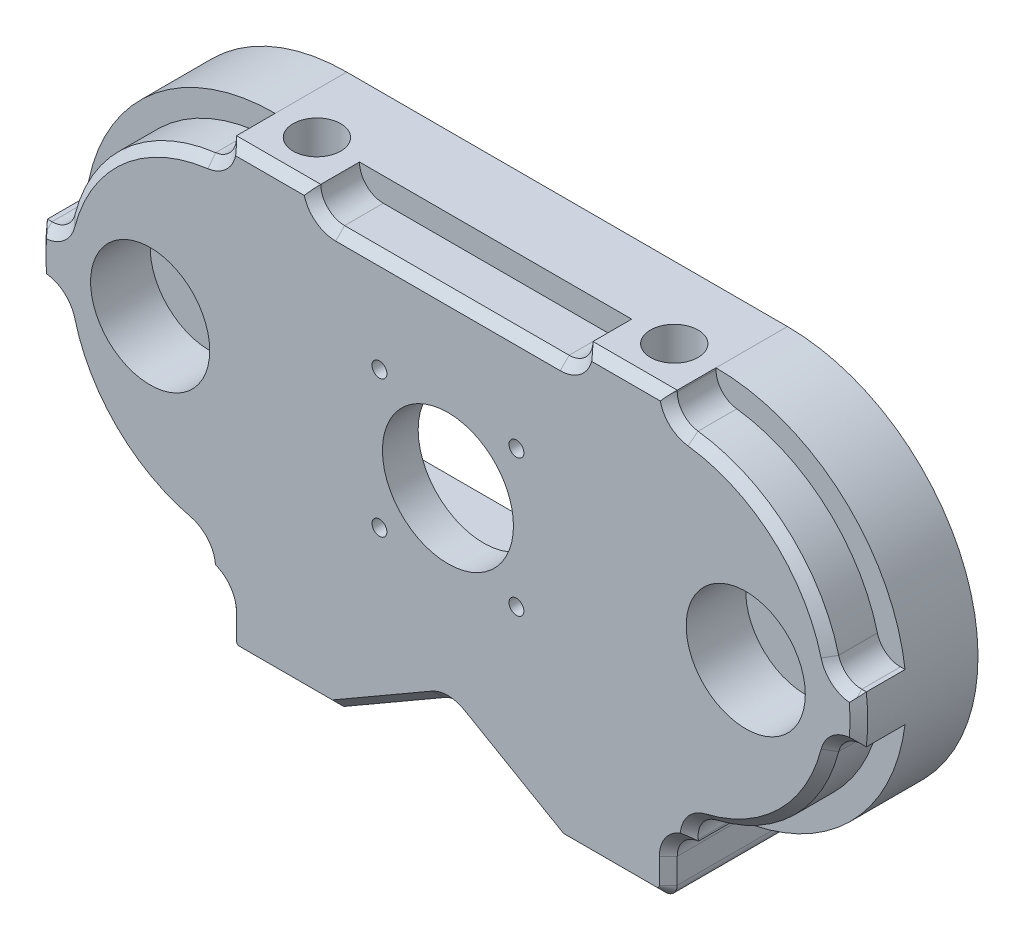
ISO-10303-21;
HEADER;
FILE_DESCRIPTION(('STEP AP214'),'2;1');
FILE_NAME('part.step','',(''),(''),'','','');
FILE_SCHEMA(('AUTOMOTIVE_DESIGN { 1 0 10303 214 1 1 1 1 }'));
ENDSEC;
DATA;
#1=APPLICATION_CONTEXT('core data for automotive mechanical design processes');
#2=APPLICATION_PROTOCOL_DEFINITION('international standard','automotive_design',2000,#1);
#3=PRODUCT_CONTEXT('',#1,'mechanical');
#4=PRODUCT('Part','Part','',(#3));
#5=PRODUCT_RELATED_PRODUCT_CATEGORY('part','',(#4));
#6=PRODUCT_DEFINITION_FORMATION('','',#4);
#7=PRODUCT_DEFINITION_CONTEXT('part definition',#1,'design');
#8=PRODUCT_DEFINITION('design','',#6,#7);
#9=PRODUCT_DEFINITION_SHAPE('','',#8);
#10=(LENGTH_UNIT() NAMED_UNIT(*) SI_UNIT(.MILLI.,.METRE.));
#11=(NAMED_UNIT(*) PLANE_ANGLE_UNIT() SI_UNIT($,.RADIAN.));
#12=(NAMED_UNIT(*) SI_UNIT($,.STERADIAN.) SOLID_ANGLE_UNIT());
#13=UNCERTAINTY_MEASURE_WITH_UNIT(LENGTH_MEASURE(1.E-05),#10,'distance_accuracy_value','');
#14=(GEOMETRIC_REPRESENTATION_CONTEXT(3) GLOBAL_UNCERTAINTY_ASSIGNED_CONTEXT((#13)) GLOBAL_UNIT_ASSIGNED_CONTEXT((#10,
#11,#12)) REPRESENTATION_CONTEXT('',''));
#15=CARTESIAN_POINT('',(0.,0.,0.));
#16=DIRECTION('',(0.,0.,1.));
#17=DIRECTION('',(1.,0.,0.));
#18=AXIS2_PLACEMENT_3D('',#15,#16,#17);
#19=CARTESIAN_POINT('',(26.,-18.,14.));
#20=DIRECTION('',(-1.,0.,0.));
#21=DIRECTION('',(0.,0.,1.));
#22=AXIS2_PLACEMENT_3D('',#19,#20,#21);
#23=PLANE('',#22);
#24=DIRECTION('',(0.,-1.,0.));
#25=VECTOR('',#24,1.);
#26=CARTESIAN_POINT('',(26.,-18.,6.));
#27=LINE('',#26,#25);
#28=CARTESIAN_POINT('',(26.,18.,6.));
#29=VERTEX_POINT('',#28);
#30=CARTESIAN_POINT('',(26.,-18.,6.));
#31=VERTEX_POINT('',#30);
#32=EDGE_CURVE('E2593',#29,#31,#27,.T.);
#33=ORIENTED_EDGE('',*,*,#32,.F.);
#34=DIRECTION('',(0.,0.,-1.));
#35=VECTOR('',#34,1.);
#36=CARTESIAN_POINT('',(26.,18.,14.));
#37=LINE('',#36,#35);
#38=CARTESIAN_POINT('',(26.,18.,14.));
#39=VERTEX_POINT('',#38);
#40=EDGE_CURVE('E2559',#39,#29,#37,.T.);
#41=ORIENTED_EDGE('',*,*,#40,.F.);
#42=DIRECTION('',(0.,1.,0.));
#43=VECTOR('',#42,1.);
#44=CARTESIAN_POINT('',(26.,-18.,14.));
#45=LINE('',#44,#43);
#46=CARTESIAN_POINT('',(26.,-18.,14.));
#47=VERTEX_POINT('',#46);
#48=EDGE_CURVE('E2572',#47,#39,#45,.T.);
#49=ORIENTED_EDGE('',*,*,#48,.F.);
#50=DIRECTION('',(0.,0.,-1.));
#51=VECTOR('',#50,1.);
#52=CARTESIAN_POINT('',(26.,-18.,14.));
#53=LINE('',#52,#51);
#54=EDGE_CURVE('E2555',#47,#31,#53,.T.);
#55=ORIENTED_EDGE('',*,*,#54,.T.);
#56=EDGE_LOOP('',(#33,#41,#49,#55));
#57=FACE_BOUND('',#56,.T.);
#58=ADVANCED_FACE('F78',(#57),#23,.F.);
#59=CARTESIAN_POINT('',(74.,-18.,14.));
#60=DIRECTION('',(1.,0.,0.));
#61=DIRECTION('',(0.,0.,-1.));
#62=AXIS2_PLACEMENT_3D('',#59,#60,#61);
#63=PLANE('',#62);
#64=DIRECTION('',(0.,1.,0.));
#65=VECTOR('',#64,1.);
#66=CARTESIAN_POINT('',(74.,18.,6.));
#67=LINE('',#66,#65);
#68=CARTESIAN_POINT('',(74.,-18.,6.));
#69=VERTEX_POINT('',#68);
#70=CARTESIAN_POINT('',(74.,18.,6.));
#71=VERTEX_POINT('',#70);
#72=EDGE_CURVE('E2581',#69,#71,#67,.T.);
#73=ORIENTED_EDGE('',*,*,#72,.F.);
#74=DIRECTION('',(0.,0.,-1.));
#75=VECTOR('',#74,1.);
#76=CARTESIAN_POINT('',(74.,-18.,14.));
#77=LINE('',#76,#75);
#78=CARTESIAN_POINT('',(74.,-18.,14.));
#79=VERTEX_POINT('',#78);
#80=EDGE_CURVE('E2552',#79,#69,#77,.T.);
#81=ORIENTED_EDGE('',*,*,#80,.F.);
#82=DIRECTION('',(0.,-1.,0.));
#83=VECTOR('',#82,1.);
#84=CARTESIAN_POINT('',(74.,-18.,14.));
#85=LINE('',#84,#83);
#86=CARTESIAN_POINT('',(74.,18.,14.));
#87=VERTEX_POINT('',#86);
#88=EDGE_CURVE('E2361',#87,#79,#85,.T.);
#89=ORIENTED_EDGE('',*,*,#88,.F.);
#90=DIRECTION('',(0.,0.,-1.));
#91=VECTOR('',#90,1.);
#92=CARTESIAN_POINT('',(74.,18.,14.));
#93=LINE('',#92,#91);
#94=EDGE_CURVE('E984',#87,#71,#93,.T.);
#95=ORIENTED_EDGE('',*,*,#94,.T.);
#96=EDGE_LOOP('',(#73,#81,#89,#95));
#97=FACE_BOUND('',#96,.T.);
#98=ADVANCED_FACE('F1046',(#97),#63,.F.);
#99=CARTESIAN_POINT('',(38.5,11.5,119.));
#100=DIRECTION('',(0.,0.,-1.));
#101=DIRECTION('',(-1.,0.,0.));
#102=AXIS2_PLACEMENT_3D('',#99,#100,#101);
#103=CYLINDRICAL_SURFACE('',#102,1.25);
#104=CARTESIAN_POINT('',(38.5,11.5,20.));
#105=DIRECTION('',(0.,0.,1.));
#106=DIRECTION('',(1.,0.,0.));
#107=AXIS2_PLACEMENT_3D('',#104,#105,#106);
#108=CIRCLE('',#107,1.25);
#109=CARTESIAN_POINT('',(39.75,11.5,20.));
#110=VERTEX_POINT('',#109);
#111=EDGE_CURVE('E2443',#110,#110,#108,.T.);
#112=ORIENTED_EDGE('',*,*,#111,.T.);
#113=EDGE_LOOP('',(#112));
#114=FACE_BOUND('',#113,.T.);
#115=CARTESIAN_POINT('',(38.5,11.5,14.));
#116=DIRECTION('',(0.,0.,-1.));
#117=DIRECTION('',(-1.,0.,0.));
#118=AXIS2_PLACEMENT_3D('',#115,#116,#117);
#119=CIRCLE('',#118,1.25);
#120=CARTESIAN_POINT('',(37.25,11.5,14.));
#121=VERTEX_POINT('',#120);
#122=EDGE_CURVE('E2370',#121,#121,#119,.F.);
#123=ORIENTED_EDGE('',*,*,#122,.F.);
#124=EDGE_LOOP('',(#123));
#125=FACE_BOUND('',#124,.T.);
#126=ADVANCED_FACE('F1052',(#114,#125),#103,.F.);
#127=CARTESIAN_POINT('',(61.5,11.5,119.));
#128=DIRECTION('',(0.,0.,-1.));
#129=DIRECTION('',(-1.,0.,0.));
#130=AXIS2_PLACEMENT_3D('',#127,#128,#129);
#131=CYLINDRICAL_SURFACE('',#130,1.25);
#132=CARTESIAN_POINT('',(61.5,11.5,20.));
#133=DIRECTION('',(0.,0.,1.));
#134=DIRECTION('',(1.,0.,0.));
#135=AXIS2_PLACEMENT_3D('',#132,#133,#134);
#136=CIRCLE('',#135,1.25);
#137=CARTESIAN_POINT('',(62.75,11.5,20.));
#138=VERTEX_POINT('',#137);
#139=EDGE_CURVE('E2440',#138,#138,#136,.T.);
#140=ORIENTED_EDGE('',*,*,#139,.T.);
#141=EDGE_LOOP('',(#140));
#142=FACE_BOUND('',#141,.T.);
#143=CARTESIAN_POINT('',(61.5,11.5,14.));
#144=DIRECTION('',(0.,0.,-1.));
#145=DIRECTION('',(-1.,0.,0.));
#146=AXIS2_PLACEMENT_3D('',#143,#144,#145);
#147=CIRCLE('',#146,1.25);
#148=CARTESIAN_POINT('',(60.25,11.5,14.));
#149=VERTEX_POINT('',#148);
#150=EDGE_CURVE('E2352',#149,#149,#147,.F.);
#151=ORIENTED_EDGE('',*,*,#150,.F.);
#152=EDGE_LOOP('',(#151));
#153=FACE_BOUND('',#152,.T.);
#154=ADVANCED_FACE('F1115',(#142,#153),#131,.F.);
#155=CARTESIAN_POINT('',(50.,0.,119.));
#156=DIRECTION('',(0.,0.,-1.));
#157=DIRECTION('',(-1.,0.,0.));
#158=AXIS2_PLACEMENT_3D('',#155,#156,#157);
#159=CYLINDRICAL_SURFACE('',#158,11.);
#160=CARTESIAN_POINT('',(50.,0.,20.));
#161=DIRECTION('',(0.,0.,1.));
#162=DIRECTION('',(1.,0.,0.));
#163=AXIS2_PLACEMENT_3D('',#160,#161,#162);
#164=CIRCLE('',#163,11.);
#165=CARTESIAN_POINT('',(61.,0.,20.));
#166=VERTEX_POINT('',#165);
#167=EDGE_CURVE('E2437',#166,#166,#164,.T.);
#168=ORIENTED_EDGE('',*,*,#167,.T.);
#169=EDGE_LOOP('',(#168));
#170=FACE_BOUND('',#169,.T.);
#171=CARTESIAN_POINT('',(50.,0.,14.));
#172=DIRECTION('',(0.,0.,-1.));
#173=DIRECTION('',(-1.,0.,0.));
#174=AXIS2_PLACEMENT_3D('',#171,#172,#173);
#175=CIRCLE('',#174,11.);
#176=CARTESIAN_POINT('',(39.,0.,14.));
#177=VERTEX_POINT('',#176);
#178=EDGE_CURVE('E2367',#177,#177,#175,.F.);
#179=ORIENTED_EDGE('',*,*,#178,.F.);
#180=EDGE_LOOP('',(#179));
#181=FACE_BOUND('',#180,.T.);
#182=ADVANCED_FACE('F1111',(#170,#181),#159,.F.);
#183=CARTESIAN_POINT('',(61.5,-11.5,119.));
#184=DIRECTION('',(0.,0.,-1.));
#185=DIRECTION('',(-1.,0.,0.));
#186=AXIS2_PLACEMENT_3D('',#183,#184,#185);
#187=CYLINDRICAL_SURFACE('',#186,1.25);
#188=CARTESIAN_POINT('',(61.5,-11.5,20.));
#189=DIRECTION('',(0.,0.,1.));
#190=DIRECTION('',(1.,0.,0.));
#191=AXIS2_PLACEMENT_3D('',#188,#189,#190);
#192=CIRCLE('',#191,1.25);
#193=CARTESIAN_POINT('',(62.75,-11.5,20.));
#194=VERTEX_POINT('',#193);
#195=EDGE_CURVE('E2434',#194,#194,#192,.T.);
#196=ORIENTED_EDGE('',*,*,#195,.T.);
#197=EDGE_LOOP('',(#196));
#198=FACE_BOUND('',#197,.T.);
#199=CARTESIAN_POINT('',(61.5,-11.5,14.));
#200=DIRECTION('',(0.,0.,-1.));
#201=DIRECTION('',(-1.,0.,0.));
#202=AXIS2_PLACEMENT_3D('',#199,#200,#201);
#203=CIRCLE('',#202,1.25);
#204=CARTESIAN_POINT('',(60.25,-11.5,14.));
#205=VERTEX_POINT('',#204);
#206=EDGE_CURVE('E983',#205,#205,#203,.F.);
#207=ORIENTED_EDGE('',*,*,#206,.F.);
#208=EDGE_LOOP('',(#207));
#209=FACE_BOUND('',#208,.T.);
#210=ADVANCED_FACE('F1107',(#198,#209),#187,.F.);
#211=CARTESIAN_POINT('',(38.5,-11.5,119.));
#212=DIRECTION('',(0.,0.,-1.));
#213=DIRECTION('',(-1.,0.,0.));
#214=AXIS2_PLACEMENT_3D('',#211,#212,#213);
#215=CYLINDRICAL_SURFACE('',#214,1.25);
#216=CARTESIAN_POINT('',(38.5,-11.5,20.));
#217=DIRECTION('',(0.,0.,1.));
#218=DIRECTION('',(1.,0.,0.));
#219=AXIS2_PLACEMENT_3D('',#216,#217,#218);
#220=CIRCLE('',#219,1.25);
#221=CARTESIAN_POINT('',(39.75,-11.5,20.));
#222=VERTEX_POINT('',#221);
#223=EDGE_CURVE('E2423',#222,#222,#220,.T.);
#224=ORIENTED_EDGE('',*,*,#223,.T.);
#225=EDGE_LOOP('',(#224));
#226=FACE_BOUND('',#225,.T.);
#227=CARTESIAN_POINT('',(38.5,-11.5,14.));
#228=DIRECTION('',(0.,0.,-1.));
#229=DIRECTION('',(-1.,0.,0.));
#230=AXIS2_PLACEMENT_3D('',#227,#228,#229);
#231=CIRCLE('',#230,1.25);
#232=CARTESIAN_POINT('',(37.25,-11.5,14.));
#233=VERTEX_POINT('',#232);
#234=EDGE_CURVE('E980',#233,#233,#231,.F.);
#235=ORIENTED_EDGE('',*,*,#234,.F.);
#236=EDGE_LOOP('',(#235));
#237=FACE_BOUND('',#236,.T.);
#238=ADVANCED_FACE('F1103',(#226,#237),#215,.F.);
#239=CARTESIAN_POINT('',(13.,0.,0.));
#240=DIRECTION('',(0.,0.,1.));
#241=DIRECTION('',(1.,0.,0.));
#242=AXIS2_PLACEMENT_3D('',#239,#240,#241);
#243=PLANE('',#242);
#244=DIRECTION('',(1.,0.,0.));
#245=VECTOR('',#244,1.);
#246=CARTESIAN_POINT('',(26.,18.,0.));
#247=LINE('',#246,#245);
#248=CARTESIAN_POINT('',(26.,18.,0.));
#249=VERTEX_POINT('',#248);
#250=CARTESIAN_POINT('',(74.,18.,0.));
#251=VERTEX_POINT('',#250);
#252=EDGE_CURVE('E2564',#249,#251,#247,.T.);
#253=ORIENTED_EDGE('',*,*,#252,.F.);
#254=CARTESIAN_POINT('',(26.,0.,0.));
#255=DIRECTION('',(0.,0.,-1.));
#256=DIRECTION('',(-1.,0.,0.));
#257=AXIS2_PLACEMENT_3D('',#254,#255,#256);
#258=CIRCLE('',#257,18.);
#259=CARTESIAN_POINT('',(26.,-18.,0.));
#260=VERTEX_POINT('',#259);
#261=EDGE_CURVE('E142',#260,#249,#258,.T.);
#262=ORIENTED_EDGE('',*,*,#261,.F.);
#263=DIRECTION('',(-1.,0.,0.));
#264=VECTOR('',#263,1.);
#265=CARTESIAN_POINT('',(26.,-18.,0.));
#266=LINE('',#265,#264);
#267=CARTESIAN_POINT('',(74.,-18.,0.));
#268=VERTEX_POINT('',#267);
#269=EDGE_CURVE('E2567',#268,#260,#266,.T.);
#270=ORIENTED_EDGE('',*,*,#269,.F.);
#271=CARTESIAN_POINT('',(74.,0.,0.));
#272=DIRECTION('',(0.,0.,-1.));
#273=DIRECTION('',(-1.,0.,0.));
#274=AXIS2_PLACEMENT_3D('',#271,#272,#273);
#275=CIRCLE('',#274,18.);
#276=EDGE_CURVE('E2583',#251,#268,#275,.T.);
#277=ORIENTED_EDGE('',*,*,#276,.F.);
#278=EDGE_LOOP('',(#253,#262,#270,#277));
#279=FACE_BOUND('',#278,.T.);
#280=CARTESIAN_POINT('',(100.,0.,0.));
#281=DIRECTION('',(0.,0.,1.));
#282=DIRECTION('',(1.,0.,0.));
#283=AXIS2_PLACEMENT_3D('',#280,#281,#282);
#284=CIRCLE('',#283,4.00000000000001);
#285=CARTESIAN_POINT('',(104.,0.,0.));
#286=VERTEX_POINT('',#285);
#287=EDGE_CURVE('E893',#286,#286,#284,.T.);
#288=ORIENTED_EDGE('',*,*,#287,.T.);
#289=EDGE_LOOP('',(#288));
#290=FACE_BOUND('',#289,.T.);
#291=CARTESIAN_POINT('',(0.,0.,0.));
#292=DIRECTION('',(0.,0.,1.));
#293=DIRECTION('',(1.,0.,0.));
#294=AXIS2_PLACEMENT_3D('',#291,#292,#293);
#295=CIRCLE('',#294,4.);
#296=CARTESIAN_POINT('',(4.,0.,0.));
#297=VERTEX_POINT('',#296);
#298=EDGE_CURVE('E896',#297,#297,#295,.T.);
#299=ORIENTED_EDGE('',*,*,#298,.T.);
#300=EDGE_LOOP('',(#299));
#301=FACE_BOUND('',#300,.T.);
#302=CARTESIAN_POINT('',(87.,0.,0.));
#303=DIRECTION('',(0.,0.,-1.));
#304=DIRECTION('',(-1.,0.,0.));
#305=AXIS2_PLACEMENT_3D('',#302,#303,#304);
#306=CIRCLE('',#305,22.);
#307=CARTESIAN_POINT('',(87.,22.,0.));
#308=VERTEX_POINT('',#307);
#309=CARTESIAN_POINT('',(89.9460293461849,-21.801855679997,0.));
#310=VERTEX_POINT('',#309);
#311=EDGE_CURVE('E2372',#308,#310,#306,.T.);
#312=ORIENTED_EDGE('',*,*,#311,.T.);
#313=DIRECTION('',(-1.,0.,0.));
#314=VECTOR('',#313,1.);
#315=CARTESIAN_POINT('',(89.9460293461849,-21.801855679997,0.));
#316=LINE('',#315,#314);
#317=CARTESIAN_POINT('',(10.0539706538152,-21.801855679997,0.));
#318=VERTEX_POINT('',#317);
#319=EDGE_CURVE('E2375',#310,#318,#316,.T.);
#320=ORIENTED_EDGE('',*,*,#319,.T.);
#321=CARTESIAN_POINT('',(13.,0.,0.));
#322=DIRECTION('',(0.,0.,-1.));
#323=DIRECTION('',(-1.,0.,0.));
#324=AXIS2_PLACEMENT_3D('',#321,#322,#323);
#325=CIRCLE('',#324,22.);
#326=CARTESIAN_POINT('',(13.,22.,0.));
#327=VERTEX_POINT('',#326);
#328=EDGE_CURVE('E2395',#318,#327,#325,.T.);
#329=ORIENTED_EDGE('',*,*,#328,.T.);
#330=DIRECTION('',(-1.,0.,0.));
#331=VECTOR('',#330,1.);
#332=CARTESIAN_POINT('',(87.,22.,0.));
#333=LINE('',#332,#331);
#334=EDGE_CURVE('E2384',#308,#327,#333,.T.);
#335=ORIENTED_EDGE('',*,*,#334,.F.);
#336=EDGE_LOOP('',(#312,#320,#329,#335));
#337=FACE_BOUND('',#336,.T.);
#338=ADVANCED_FACE('F1106',(#279,#290,#301,#337),#243,.F.);
#339=CARTESIAN_POINT('',(87.,0.,20.));
#340=DIRECTION('',(0.,0.,-1.));
#341=DIRECTION('',(-1.,0.,0.));
#342=AXIS2_PLACEMENT_3D('',#339,#340,#341);
#343=CYLINDRICAL_SURFACE('',#342,32.);
#344=DIRECTION('',(0.,0.,1.));
#345=VECTOR('',#344,1.);
#346=CARTESIAN_POINT('',(118.749015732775,4.,12.));
#347=LINE('',#346,#345);
#348=CARTESIAN_POINT('',(118.749015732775,4.,12.));
#349=VERTEX_POINT('',#348);
#350=CARTESIAN_POINT('',(118.749015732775,4.,18.5));
#351=VERTEX_POINT('',#350);
#352=EDGE_CURVE('E827',#349,#351,#347,.T.);
#353=ORIENTED_EDGE('',*,*,#352,.T.);
#354=CARTESIAN_POINT('',(87.,0.,18.5));
#355=DIRECTION('',(0.,0.,1.));
#356=DIRECTION('',(1.,0.,0.));
#357=AXIS2_PLACEMENT_3D('',#354,#355,#356);
#358=CIRCLE('',#357,32.);
#359=CARTESIAN_POINT('',(118.749015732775,-4.00000000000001,18.5));
#360=VERTEX_POINT('',#359);
#361=EDGE_CURVE('E1625',#351,#360,#358,.F.);
#362=ORIENTED_EDGE('',*,*,#361,.T.);
#363=DIRECTION('',(0.,0.,1.));
#364=VECTOR('',#363,1.);
#365=CARTESIAN_POINT('',(118.749015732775,-4.00000000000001,12.));
#366=LINE('',#365,#364);
#367=CARTESIAN_POINT('',(118.749015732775,-4.00000000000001,12.));
#368=VERTEX_POINT('',#367);
#369=EDGE_CURVE('E2447',#368,#360,#366,.T.);
#370=ORIENTED_EDGE('',*,*,#369,.F.);
#371=CARTESIAN_POINT('',(87.,0.,12.));
#372=DIRECTION('',(0.,0.,1.));
#373=DIRECTION('',(1.,0.,0.));
#374=AXIS2_PLACEMENT_3D('',#371,#372,#373);
#375=CIRCLE('',#374,32.);
#376=CARTESIAN_POINT('',(90.5555555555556,-31.801855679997,12.));
#377=VERTEX_POINT('',#376);
#378=EDGE_CURVE('E2461',#377,#368,#375,.T.);
#379=ORIENTED_EDGE('',*,*,#378,.F.);
#380=DIRECTION('',(0.,0.,-1.));
#381=VECTOR('',#380,1.);
#382=CARTESIAN_POINT('',(90.5555555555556,-31.801855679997,20.));
#383=LINE('',#382,#381);
#384=CARTESIAN_POINT('',(90.5555555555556,-31.801855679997,0.));
#385=VERTEX_POINT('',#384);
#386=EDGE_CURVE('E947',#377,#385,#383,.T.);
#387=ORIENTED_EDGE('',*,*,#386,.T.);
#388=CARTESIAN_POINT('',(87.,0.,0.));
#389=DIRECTION('',(0.,0.,1.));
#390=DIRECTION('',(1.,0.,0.));
#391=AXIS2_PLACEMENT_3D('',#388,#389,#390);
#392=CIRCLE('',#391,32.);
#393=CARTESIAN_POINT('',(87.,32.,0.));
#394=VERTEX_POINT('',#393);
#395=EDGE_CURVE('E935',#385,#394,#392,.T.);
#396=ORIENTED_EDGE('',*,*,#395,.T.);
#397=DIRECTION('',(0.,0.,-1.));
#398=VECTOR('',#397,1.);
#399=CARTESIAN_POINT('',(87.,32.,20.));
#400=LINE('',#399,#398);
#401=CARTESIAN_POINT('',(87.,32.,12.));
#402=VERTEX_POINT('',#401);
#403=EDGE_CURVE('E944',#402,#394,#400,.T.);
#404=ORIENTED_EDGE('',*,*,#403,.F.);
#405=CARTESIAN_POINT('',(87.,0.,12.));
#406=DIRECTION('',(0.,0.,1.));
#407=DIRECTION('',(1.,0.,0.));
#408=AXIS2_PLACEMENT_3D('',#405,#406,#407);
#409=CIRCLE('',#408,32.);
#410=EDGE_CURVE('E839',#349,#402,#409,.T.);
#411=ORIENTED_EDGE('',*,*,#410,.F.);
#412=EDGE_LOOP('',(#353,#362,#370,#379,#387,#396,#404,#411));
#413=FACE_BOUND('',#412,.T.);
#414=ADVANCED_FACE('F1265',(#413),#343,.T.);
#415=CARTESIAN_POINT('',(13.,0.,20.));
#416=DIRECTION('',(0.,0.,1.));
#417=DIRECTION('',(1.,0.,0.));
#418=AXIS2_PLACEMENT_3D('',#415,#416,#417);
#419=PLANE('',#418);
#420=CARTESIAN_POINT('',(13.,0.,20.));
#421=DIRECTION('',(0.,0.,1.));
#422=DIRECTION('',(1.,0.,0.));
#423=AXIS2_PLACEMENT_3D('',#420,#421,#422);
#424=CIRCLE('',#423,26.5);
#425=CARTESIAN_POINT('',(9.68750000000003,26.2921536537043,20.));
#426=VERTEX_POINT('',#425);
#427=CARTESIAN_POINT('',(-12.6585146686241,6.62499999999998,20.));
#428=VERTEX_POINT('',#427);
#429=EDGE_CURVE('E1595',#426,#428,#424,.T.);
#430=ORIENTED_EDGE('',*,*,#429,.T.);
#431=CARTESIAN_POINT('',(-17.9838667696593,8.,20.));
#432=DIRECTION('',(0.,0.,1.));
#433=DIRECTION('',(1.,0.,0.));
#434=AXIS2_PLACEMENT_3D('',#431,#432,#433);
#435=CIRCLE('',#434,5.50000000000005);
#436=CARTESIAN_POINT('',(-17.3947493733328,2.53164186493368,20.));
#437=VERTEX_POINT('',#436);
#438=EDGE_CURVE('E763',#428,#437,#435,.F.);
#439=ORIENTED_EDGE('',*,*,#438,.T.);
#440=CARTESIAN_POINT('',(13.,0.,20.));
#441=DIRECTION('',(0.,0.,1.));
#442=DIRECTION('',(1.,0.,0.));
#443=AXIS2_PLACEMENT_3D('',#440,#441,#442);
#444=CIRCLE('',#443,30.5);
#445=CARTESIAN_POINT('',(-17.3947493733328,-2.53164186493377,20.));
#446=VERTEX_POINT('',#445);
#447=EDGE_CURVE('E1568',#437,#446,#444,.T.);
#448=ORIENTED_EDGE('',*,*,#447,.T.);
#449=CARTESIAN_POINT('',(-17.9838667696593,-8.,20.));
#450=DIRECTION('',(0.,0.,1.));
#451=DIRECTION('',(1.,0.,0.));
#452=AXIS2_PLACEMENT_3D('',#449,#450,#451);
#453=CIRCLE('',#452,5.49999999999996);
#454=CARTESIAN_POINT('',(-12.6585146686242,-6.62500000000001,20.));
#455=VERTEX_POINT('',#454);
#456=EDGE_CURVE('E1701',#446,#455,#453,.F.);
#457=ORIENTED_EDGE('',*,*,#456,.T.);
#458=CARTESIAN_POINT('',(13.,0.,20.));
#459=DIRECTION('',(0.,0.,1.));
#460=DIRECTION('',(1.,0.,0.));
#461=AXIS2_PLACEMENT_3D('',#458,#459,#460);
#462=CIRCLE('',#461,26.5);
#463=CARTESIAN_POINT('',(6.78666062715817,-25.7612968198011,20.));
#464=VERTEX_POINT('',#463);
#465=EDGE_CURVE('E581',#455,#464,#462,.T.);
#466=ORIENTED_EDGE('',*,*,#465,.T.);
#467=CARTESIAN_POINT('',(5.49709962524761,-31.1079810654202,20.));
#468=DIRECTION('',(0.,0.,1.));
#469=DIRECTION('',(1.,0.,0.));
#470=AXIS2_PLACEMENT_3D('',#467,#468,#469);
#471=CIRCLE('',#470,5.49999999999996);
#472=CARTESIAN_POINT('',(10.9775711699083,-30.6449134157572,20.));
#473=VERTEX_POINT('',#472);
#474=EDGE_CURVE('E1703',#464,#473,#471,.F.);
#475=ORIENTED_EDGE('',*,*,#474,.T.);
#476=CARTESIAN_POINT('',(9.00000000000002,-35.7770876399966,20.));
#477=DIRECTION('',(0.,0.,1.));
#478=DIRECTION('',(1.,0.,0.));
#479=AXIS2_PLACEMENT_3D('',#476,#477,#478);
#480=CIRCLE('',#479,5.50000000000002);
#481=CARTESIAN_POINT('',(14.5,-35.7770876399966,20.));
#482=VERTEX_POINT('',#481);
#483=EDGE_CURVE('E1702',#473,#482,#480,.F.);
#484=ORIENTED_EDGE('',*,*,#483,.T.);
#485=DIRECTION('',(0.,-1.,0.));
#486=VECTOR('',#485,1.);
#487=CARTESIAN_POINT('',(14.5,-40.,20.));
#488=LINE('',#487,#486);
#489=CARTESIAN_POINT('',(14.5,-40.,20.));
#490=VERTEX_POINT('',#489);
#491=EDGE_CURVE('E1330',#482,#490,#488,.T.);
#492=ORIENTED_EDGE('',*,*,#491,.T.);
#493=CARTESIAN_POINT('',(15.,-40.,20.));
#494=DIRECTION('',(0.,0.,1.));
#495=DIRECTION('',(1.,0.,0.));
#496=AXIS2_PLACEMENT_3D('',#493,#494,#495);
#497=CIRCLE('',#496,0.49999999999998);
#498=CARTESIAN_POINT('',(15.,-40.5,20.));
#499=VERTEX_POINT('',#498);
#500=EDGE_CURVE('E1350',#490,#499,#497,.T.);
#501=ORIENTED_EDGE('',*,*,#500,.T.);
#502=DIRECTION('',(1.,0.,0.));
#503=VECTOR('',#502,1.);
#504=CARTESIAN_POINT('',(31.,-40.5,20.));
#505=LINE('',#504,#503);
#506=CARTESIAN_POINT('',(30.5980762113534,-40.5,20.));
#507=VERTEX_POINT('',#506);
#508=EDGE_CURVE('E1545',#499,#507,#505,.T.);
#509=ORIENTED_EDGE('',*,*,#508,.T.);
#510=DIRECTION('',(0.86602540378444,0.499999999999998,0.));
#511=VECTOR('',#510,1.);
#512=CARTESIAN_POINT('',(47.25,-30.8860073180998,20.));
#513=LINE('',#512,#511);
#514=CARTESIAN_POINT('',(47.25,-30.8860073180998,20.));
#515=VERTEX_POINT('',#514);
#516=EDGE_CURVE('E1548',#507,#515,#513,.T.);
#517=ORIENTED_EDGE('',*,*,#516,.T.);
#518=CARTESIAN_POINT('',(50.,-35.6491470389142,20.));
#519=DIRECTION('',(0.,0.,1.));
#520=DIRECTION('',(1.,0.,0.));
#521=AXIS2_PLACEMENT_3D('',#518,#519,#520);
#522=CIRCLE('',#521,5.50000000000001);
#523=CARTESIAN_POINT('',(52.75,-30.8860073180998,20.));
#524=VERTEX_POINT('',#523);
#525=EDGE_CURVE('E1550',#515,#524,#522,.F.);
#526=ORIENTED_EDGE('',*,*,#525,.T.);
#527=DIRECTION('',(0.86602540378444,-0.499999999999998,0.));
#528=VECTOR('',#527,1.);
#529=CARTESIAN_POINT('',(69.75,-40.7009618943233,20.));
#530=LINE('',#529,#528);
#531=CARTESIAN_POINT('',(69.4019237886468,-40.5,20.));
#532=VERTEX_POINT('',#531);
#533=EDGE_CURVE('E1556',#524,#532,#530,.T.);
#534=ORIENTED_EDGE('',*,*,#533,.T.);
#535=DIRECTION('',(1.,0.,0.));
#536=VECTOR('',#535,1.);
#537=CARTESIAN_POINT('',(85.,-40.5,20.));
#538=LINE('',#537,#536);
#539=CARTESIAN_POINT('',(85.,-40.5,20.));
#540=VERTEX_POINT('',#539);
#541=EDGE_CURVE('E1558',#532,#540,#538,.T.);
#542=ORIENTED_EDGE('',*,*,#541,.T.);
#543=CARTESIAN_POINT('',(85.,-40.,20.));
#544=DIRECTION('',(0.,0.,1.));
#545=DIRECTION('',(1.,0.,0.));
#546=AXIS2_PLACEMENT_3D('',#543,#544,#545);
#547=CIRCLE('',#546,0.500000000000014);
#548=CARTESIAN_POINT('',(85.5,-40.,20.));
#549=VERTEX_POINT('',#548);
#550=EDGE_CURVE('E1560',#540,#549,#547,.T.);
#551=ORIENTED_EDGE('',*,*,#550,.T.);
#552=DIRECTION('',(0.,1.,0.));
#553=VECTOR('',#552,1.);
#554=CARTESIAN_POINT('',(85.5,-35.7770876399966,20.));
#555=LINE('',#554,#553);
#556=CARTESIAN_POINT('',(85.5,-35.7770876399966,20.));
#557=VERTEX_POINT('',#556);
#558=EDGE_CURVE('E1562',#549,#557,#555,.T.);
#559=ORIENTED_EDGE('',*,*,#558,.T.);
#560=CARTESIAN_POINT('',(91.,-35.7770876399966,20.));
#561=DIRECTION('',(0.,0.,1.));
#562=DIRECTION('',(1.,0.,0.));
#563=AXIS2_PLACEMENT_3D('',#560,#561,#562);
#564=CIRCLE('',#563,5.49999999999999);
#565=CARTESIAN_POINT('',(89.0224288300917,-30.6449134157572,20.));
#566=VERTEX_POINT('',#565);
#567=EDGE_CURVE('E1564',#557,#566,#564,.F.);
#568=ORIENTED_EDGE('',*,*,#567,.T.);
#569=CARTESIAN_POINT('',(94.5029003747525,-31.1079810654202,20.));
#570=DIRECTION('',(0.,0.,1.));
#571=DIRECTION('',(1.,0.,0.));
#572=AXIS2_PLACEMENT_3D('',#569,#570,#571);
#573=CIRCLE('',#572,5.50000000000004);
#574=CARTESIAN_POINT('',(93.2133393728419,-25.761296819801,20.));
#575=VERTEX_POINT('',#574);
#576=EDGE_CURVE('E1566',#566,#575,#573,.F.);
#577=ORIENTED_EDGE('',*,*,#576,.T.);
#578=CARTESIAN_POINT('',(87.,0.,20.));
#579=DIRECTION('',(0.,0.,1.));
#580=DIRECTION('',(1.,0.,0.));
#581=AXIS2_PLACEMENT_3D('',#578,#579,#580);
#582=CIRCLE('',#581,26.5);
#583=CARTESIAN_POINT('',(112.658514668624,-6.62499999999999,20.));
#584=VERTEX_POINT('',#583);
#585=EDGE_CURVE('E1571',#575,#584,#582,.T.);
#586=ORIENTED_EDGE('',*,*,#585,.T.);
#587=CARTESIAN_POINT('',(117.983866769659,-8.,20.));
#588=DIRECTION('',(0.,0.,1.));
#589=DIRECTION('',(1.,0.,0.));
#590=AXIS2_PLACEMENT_3D('',#587,#588,#589);
#591=CIRCLE('',#590,5.50000000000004);
#592=CARTESIAN_POINT('',(117.394749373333,-2.53164186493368,20.));
#593=VERTEX_POINT('',#592);
#594=EDGE_CURVE('E1573',#584,#593,#591,.F.);
#595=ORIENTED_EDGE('',*,*,#594,.T.);
#596=CARTESIAN_POINT('',(87.,0.,20.));
#597=DIRECTION('',(0.,0.,1.));
#598=DIRECTION('',(1.,0.,0.));
#599=AXIS2_PLACEMENT_3D('',#596,#597,#598);
#600=CIRCLE('',#599,30.5);
#601=CARTESIAN_POINT('',(117.394749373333,2.53164186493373,20.));
#602=VERTEX_POINT('',#601);
#603=EDGE_CURVE('E1575',#593,#602,#600,.T.);
#604=ORIENTED_EDGE('',*,*,#603,.T.);
#605=CARTESIAN_POINT('',(117.983866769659,8.,20.));
#606=DIRECTION('',(0.,0.,1.));
#607=DIRECTION('',(1.,0.,0.));
#608=AXIS2_PLACEMENT_3D('',#605,#606,#607);
#609=CIRCLE('',#608,5.49999999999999);
#610=CARTESIAN_POINT('',(112.658514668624,6.62500000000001,20.));
#611=VERTEX_POINT('',#610);
#612=EDGE_CURVE('E1577',#602,#611,#609,.F.);
#613=ORIENTED_EDGE('',*,*,#612,.T.);
#614=CARTESIAN_POINT('',(87.,0.,20.));
#615=DIRECTION('',(0.,0.,1.));
#616=DIRECTION('',(1.,0.,0.));
#617=AXIS2_PLACEMENT_3D('',#614,#615,#616);
#618=CIRCLE('',#617,26.5);
#619=CARTESIAN_POINT('',(90.3125,26.2921536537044,20.));
#620=VERTEX_POINT('',#619);
#621=EDGE_CURVE('E1579',#611,#620,#618,.T.);
#622=ORIENTED_EDGE('',*,*,#621,.T.);
#623=CARTESIAN_POINT('',(91.,31.7490157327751,20.));
#624=DIRECTION('',(0.,0.,1.));
#625=DIRECTION('',(1.,0.,0.));
#626=AXIS2_PLACEMENT_3D('',#623,#624,#625);
#627=CIRCLE('',#626,5.49999999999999);
#628=CARTESIAN_POINT('',(85.6436990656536,30.5,20.));
#629=VERTEX_POINT('',#628);
#630=EDGE_CURVE('E1581',#620,#629,#627,.F.);
#631=ORIENTED_EDGE('',*,*,#630,.T.);
#632=DIRECTION('',(-1.,0.,0.));
#633=VECTOR('',#632,1.);
#634=CARTESIAN_POINT('',(72.84908603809,30.5,20.));
#635=LINE('',#634,#633);
#636=CARTESIAN_POINT('',(74.1405886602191,30.5,20.));
#637=VERTEX_POINT('',#636);
#638=EDGE_CURVE('E1583',#629,#637,#635,.T.);
#639=ORIENTED_EDGE('',*,*,#638,.T.);
#640=CARTESIAN_POINT('',(68.84908603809,32.,20.));
#641=DIRECTION('',(0.,0.,1.));
#642=DIRECTION('',(1.,0.,0.));
#643=AXIS2_PLACEMENT_3D('',#640,#641,#642);
#644=CIRCLE('',#643,5.49999999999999);
#645=CARTESIAN_POINT('',(68.84908603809,26.5,20.));
#646=VERTEX_POINT('',#645);
#647=EDGE_CURVE('E1585',#637,#646,#644,.F.);
#648=ORIENTED_EDGE('',*,*,#647,.T.);
#649=DIRECTION('',(-1.,0.,0.));
#650=VECTOR('',#649,1.);
#651=CARTESIAN_POINT('',(13.,26.5,20.));
#652=LINE('',#651,#650);
#653=CARTESIAN_POINT('',(31.1509139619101,26.5,20.));
#654=VERTEX_POINT('',#653);
#655=EDGE_CURVE('E1587',#646,#654,#652,.T.);
#656=ORIENTED_EDGE('',*,*,#655,.T.);
#657=CARTESIAN_POINT('',(31.1509139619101,32.,20.));
#658=DIRECTION('',(0.,0.,1.));
#659=DIRECTION('',(1.,0.,0.));
#660=AXIS2_PLACEMENT_3D('',#657,#658,#659);
#661=CIRCLE('',#660,5.49999999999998);
#662=CARTESIAN_POINT('',(25.8594113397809,30.5,20.));
#663=VERTEX_POINT('',#662);
#664=EDGE_CURVE('E1589',#654,#663,#661,.F.);
#665=ORIENTED_EDGE('',*,*,#664,.T.);
#666=DIRECTION('',(-1.,0.,0.));
#667=VECTOR('',#666,1.);
#668=CARTESIAN_POINT('',(13.,30.5,20.));
#669=LINE('',#668,#667);
#670=CARTESIAN_POINT('',(14.3563009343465,30.5,20.));
#671=VERTEX_POINT('',#670);
#672=EDGE_CURVE('E1591',#663,#671,#669,.T.);
#673=ORIENTED_EDGE('',*,*,#672,.T.);
#674=CARTESIAN_POINT('',(9.00000000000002,31.7490157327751,20.));
#675=DIRECTION('',(0.,0.,1.));
#676=DIRECTION('',(1.,0.,0.));
#677=AXIS2_PLACEMENT_3D('',#674,#675,#676);
#678=CIRCLE('',#677,5.50000000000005);
#679=EDGE_CURVE('E1593',#671,#426,#678,.F.);
#680=ORIENTED_EDGE('',*,*,#679,.T.);
#681=EDGE_LOOP('',(#430,#439,#448,#457,#466,#475,#484,#492,#501,#509,#517,#526,#534,#542,#551,
#559,#568,#577,#586,#595,#604,#613,#622,#631,#639,#648,#656,#665,#673,#680));
#682=FACE_BOUND('',#681,.T.);
#683=ORIENTED_EDGE('',*,*,#223,.F.);
#684=EDGE_LOOP('',(#683));
#685=FACE_BOUND('',#684,.T.);
#686=ORIENTED_EDGE('',*,*,#195,.F.);
#687=EDGE_LOOP('',(#686));
#688=FACE_BOUND('',#687,.T.);
#689=ORIENTED_EDGE('',*,*,#167,.F.);
#690=EDGE_LOOP('',(#689));
#691=FACE_BOUND('',#690,.T.);
#692=ORIENTED_EDGE('',*,*,#139,.F.);
#693=EDGE_LOOP('',(#692));
#694=FACE_BOUND('',#693,.T.);
#695=ORIENTED_EDGE('',*,*,#111,.F.);
#696=EDGE_LOOP('',(#695));
#697=FACE_BOUND('',#696,.T.);
#698=CARTESIAN_POINT('',(100.,0.,20.));
#699=DIRECTION('',(0.,0.,1.));
#700=DIRECTION('',(1.,0.,0.));
#701=AXIS2_PLACEMENT_3D('',#698,#699,#700);
#702=CIRCLE('',#701,9.99999999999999);
#703=CARTESIAN_POINT('',(110.,0.,20.));
#704=VERTEX_POINT('',#703);
#705=EDGE_CURVE('E869',#704,#704,#702,.T.);
#706=ORIENTED_EDGE('',*,*,#705,.F.);
#707=EDGE_LOOP('',(#706));
#708=FACE_BOUND('',#707,.T.);
#709=CARTESIAN_POINT('',(0.,0.,20.));
#710=DIRECTION('',(0.,0.,1.));
#711=DIRECTION('',(1.,0.,0.));
#712=AXIS2_PLACEMENT_3D('',#709,#710,#711);
#713=CIRCLE('',#712,10.);
#714=CARTESIAN_POINT('',(10.,0.,20.));
#715=VERTEX_POINT('',#714);
#716=EDGE_CURVE('E880',#715,#715,#713,.T.);
#717=ORIENTED_EDGE('',*,*,#716,.F.);
#718=EDGE_LOOP('',(#717));
#719=FACE_BOUND('',#718,.T.);
#720=ADVANCED_FACE('F1262',(#682,#685,#688,#691,#694,#697,#708,#719),#419,.T.);
#721=CARTESIAN_POINT('',(13.,0.,20.));
#722=DIRECTION('',(0.,0.,-1.));
#723=DIRECTION('',(-1.,0.,0.));
#724=AXIS2_PLACEMENT_3D('',#721,#722,#723);
#725=CYLINDRICAL_SURFACE('',#724,32.);
#726=DIRECTION('',(0.,0.,1.));
#727=VECTOR('',#726,1.);
#728=CARTESIAN_POINT('',(-18.7490157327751,-4.,12.));
#729=LINE('',#728,#727);
#730=CARTESIAN_POINT('',(-18.7490157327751,-4.,12.));
#731=VERTEX_POINT('',#730);
#732=CARTESIAN_POINT('',(-18.7490157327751,-4.,18.5));
#733=VERTEX_POINT('',#732);
#734=EDGE_CURVE('E762',#731,#733,#729,.T.);
#735=ORIENTED_EDGE('',*,*,#734,.T.);
#736=CARTESIAN_POINT('',(13.,0.,18.5));
#737=DIRECTION('',(0.,0.,1.));
#738=DIRECTION('',(1.,0.,0.));
#739=AXIS2_PLACEMENT_3D('',#736,#737,#738);
#740=CIRCLE('',#739,32.);
#741=CARTESIAN_POINT('',(-18.7490157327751,4.,18.4999999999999));
#742=VERTEX_POINT('',#741);
#743=EDGE_CURVE('E743',#733,#742,#740,.F.);
#744=ORIENTED_EDGE('',*,*,#743,.T.);
#745=DIRECTION('',(0.,0.,1.));
#746=VECTOR('',#745,1.);
#747=CARTESIAN_POINT('',(-18.7490157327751,4.,12.));
#748=LINE('',#747,#746);
#749=CARTESIAN_POINT('',(-18.7490157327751,4.,12.));
#750=VERTEX_POINT('',#749);
#751=EDGE_CURVE('E760',#750,#742,#748,.T.);
#752=ORIENTED_EDGE('',*,*,#751,.F.);
#753=CARTESIAN_POINT('',(13.,0.,12.));
#754=DIRECTION('',(0.,0.,1.));
#755=DIRECTION('',(1.,0.,0.));
#756=AXIS2_PLACEMENT_3D('',#753,#754,#755);
#757=CIRCLE('',#756,32.);
#758=CARTESIAN_POINT('',(13.,32.,12.));
#759=VERTEX_POINT('',#758);
#760=EDGE_CURVE('E789',#759,#750,#757,.T.);
#761=ORIENTED_EDGE('',*,*,#760,.F.);
#762=DIRECTION('',(0.,0.,-1.));
#763=VECTOR('',#762,1.);
#764=CARTESIAN_POINT('',(13.,32.,20.));
#765=LINE('',#764,#763);
#766=CARTESIAN_POINT('',(13.,32.,0.));
#767=VERTEX_POINT('',#766);
#768=EDGE_CURVE('E941',#759,#767,#765,.T.);
#769=ORIENTED_EDGE('',*,*,#768,.T.);
#770=CARTESIAN_POINT('',(13.,0.,0.));
#771=DIRECTION('',(0.,0.,1.));
#772=DIRECTION('',(1.,0.,0.));
#773=AXIS2_PLACEMENT_3D('',#770,#771,#772);
#774=CIRCLE('',#773,32.);
#775=CARTESIAN_POINT('',(9.44444444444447,-31.801855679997,0.));
#776=VERTEX_POINT('',#775);
#777=EDGE_CURVE('E899',#767,#776,#774,.T.);
#778=ORIENTED_EDGE('',*,*,#777,.T.);
#779=DIRECTION('',(0.,0.,-1.));
#780=VECTOR('',#779,1.);
#781=CARTESIAN_POINT('',(9.44444444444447,-31.801855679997,20.));
#782=LINE('',#781,#780);
#783=CARTESIAN_POINT('',(9.44444444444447,-31.801855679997,12.));
#784=VERTEX_POINT('',#783);
#785=EDGE_CURVE('E970',#784,#776,#782,.T.);
#786=ORIENTED_EDGE('',*,*,#785,.F.);
#787=CARTESIAN_POINT('',(13.,0.,12.));
#788=DIRECTION('',(0.,0.,1.));
#789=DIRECTION('',(1.,0.,0.));
#790=AXIS2_PLACEMENT_3D('',#787,#788,#789);
#791=CIRCLE('',#790,32.);
#792=EDGE_CURVE('E857',#731,#784,#791,.T.);
#793=ORIENTED_EDGE('',*,*,#792,.F.);
#794=EDGE_LOOP('',(#735,#744,#752,#761,#769,#778,#786,#793));
#795=FACE_BOUND('',#794,.T.);
#796=ADVANCED_FACE('F758',(#795),#725,.T.);
#797=CARTESIAN_POINT('',(13.,32.,20.));
#798=DIRECTION('',(0.,-1.,0.));
#799=DIRECTION('',(0.,0.,-1.));
#800=AXIS2_PLACEMENT_3D('',#797,#798,#799);
#801=PLANE('',#800);
#802=CARTESIAN_POINT('',(80.,32.,12.));
#803=DIRECTION('',(0.,-1.,0.));
#804=DIRECTION('',(0.,0.,-1.));
#805=AXIS2_PLACEMENT_3D('',#802,#803,#804);
#806=CIRCLE('',#805,4.00000000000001);
#807=CARTESIAN_POINT('',(80.,32.,7.99999999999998));
#808=VERTEX_POINT('',#807);
#809=EDGE_CURVE('E886',#808,#808,#806,.F.);
#810=ORIENTED_EDGE('',*,*,#809,.F.);
#811=EDGE_LOOP('',(#810));
#812=FACE_BOUND('',#811,.T.);
#813=CARTESIAN_POINT('',(20.,32.,12.));
#814=DIRECTION('',(0.,-1.,0.));
#815=DIRECTION('',(0.,0.,-1.));
#816=AXIS2_PLACEMENT_3D('',#813,#814,#815);
#817=CIRCLE('',#816,4.);
#818=CARTESIAN_POINT('',(20.,32.,8.));
#819=VERTEX_POINT('',#818);
#820=EDGE_CURVE('E892',#819,#819,#817,.F.);
#821=ORIENTED_EDGE('',*,*,#820,.F.);
#822=EDGE_LOOP('',(#821));
#823=FACE_BOUND('',#822,.T.);
#824=CARTESIAN_POINT('',(13.,32.,18.5));
#825=VERTEX_POINT('',#824);
#826=EDGE_CURVE('E942',#825,#759,#765,.T.);
#827=ORIENTED_EDGE('',*,*,#826,.F.);
#828=DIRECTION('',(1.,0.,0.));
#829=VECTOR('',#828,1.);
#830=CARTESIAN_POINT('',(27.1509139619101,32.,18.5));
#831=LINE('',#830,#829);
#832=CARTESIAN_POINT('',(27.1509139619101,32.,18.5));
#833=VERTEX_POINT('',#832);
#834=EDGE_CURVE('E1607',#825,#833,#831,.T.);
#835=ORIENTED_EDGE('',*,*,#834,.T.);
#836=DIRECTION('',(0.,0.,1.));
#837=VECTOR('',#836,1.);
#838=CARTESIAN_POINT('',(27.1509139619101,32.,12.));
#839=LINE('',#838,#837);
#840=CARTESIAN_POINT('',(27.1509139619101,32.,12.));
#841=VERTEX_POINT('',#840);
#842=EDGE_CURVE('E802',#841,#833,#839,.T.);
#843=ORIENTED_EDGE('',*,*,#842,.F.);
#844=DIRECTION('',(-1.,0.,0.));
#845=VECTOR('',#844,1.);
#846=CARTESIAN_POINT('',(72.84908603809,32.,12.));
#847=LINE('',#846,#845);
#848=CARTESIAN_POINT('',(72.84908603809,32.,12.));
#849=VERTEX_POINT('',#848);
#850=EDGE_CURVE('E808',#849,#841,#847,.T.);
#851=ORIENTED_EDGE('',*,*,#850,.F.);
#852=DIRECTION('',(0.,0.,1.));
#853=VECTOR('',#852,1.);
#854=CARTESIAN_POINT('',(72.84908603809,32.,12.));
#855=LINE('',#854,#853);
#856=CARTESIAN_POINT('',(72.84908603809,32.,18.5));
#857=VERTEX_POINT('',#856);
#858=EDGE_CURVE('E805',#849,#857,#855,.T.);
#859=ORIENTED_EDGE('',*,*,#858,.T.);
#860=DIRECTION('',(1.,0.,0.));
#861=VECTOR('',#860,1.);
#862=CARTESIAN_POINT('',(87.,32.,18.5));
#863=LINE('',#862,#861);
#864=CARTESIAN_POINT('',(87.,32.,18.5));
#865=VERTEX_POINT('',#864);
#866=EDGE_CURVE('E1605',#857,#865,#863,.T.);
#867=ORIENTED_EDGE('',*,*,#866,.T.);
#868=EDGE_CURVE('E945',#865,#402,#400,.T.);
#869=ORIENTED_EDGE('',*,*,#868,.T.);
#870=ORIENTED_EDGE('',*,*,#403,.T.);
#871=DIRECTION('',(-1.,0.,0.));
#872=VECTOR('',#871,1.);
#873=CARTESIAN_POINT('',(13.,32.,0.));
#874=LINE('',#873,#872);
#875=EDGE_CURVE('E938',#394,#767,#874,.T.);
#876=ORIENTED_EDGE('',*,*,#875,.T.);
#877=ORIENTED_EDGE('',*,*,#768,.F.);
#878=EDGE_LOOP('',(#827,#835,#843,#851,#859,#867,#869,#870,#876,#877));
#879=FACE_BOUND('',#878,.T.);
#880=ADVANCED_FACE('F1256',(#812,#823,#879),#801,.F.);
#881=CARTESIAN_POINT('',(100.,0.,20.));
#882=DIRECTION('',(0.,0.,-1.));
#883=DIRECTION('',(-1.,0.,0.));
#884=AXIS2_PLACEMENT_3D('',#881,#882,#883);
#885=CYLINDRICAL_SURFACE('',#884,4.00000000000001);
#886=ORIENTED_EDGE('',*,*,#287,.F.);
#887=EDGE_LOOP('',(#886));
#888=FACE_BOUND('',#887,.T.);
#889=CARTESIAN_POINT('',(100.,0.,10.));
#890=DIRECTION('',(0.,0.,1.));
#891=DIRECTION('',(1.,0.,0.));
#892=AXIS2_PLACEMENT_3D('',#889,#890,#891);
#893=CIRCLE('',#892,4.00000000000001);
#894=CARTESIAN_POINT('',(104.,0.,10.));
#895=VERTEX_POINT('',#894);
#896=EDGE_CURVE('E873',#895,#895,#893,.T.);
#897=ORIENTED_EDGE('',*,*,#896,.T.);
#898=EDGE_LOOP('',(#897));
#899=FACE_BOUND('',#898,.T.);
#900=ADVANCED_FACE('F1252',(#888,#899),#885,.F.);
#901=CARTESIAN_POINT('',(0.,0.,20.));
#902=DIRECTION('',(0.,0.,-1.));
#903=DIRECTION('',(-1.,0.,0.));
#904=AXIS2_PLACEMENT_3D('',#901,#902,#903);
#905=CYLINDRICAL_SURFACE('',#904,4.);
#906=ORIENTED_EDGE('',*,*,#298,.F.);
#907=EDGE_LOOP('',(#906));
#908=FACE_BOUND('',#907,.T.);
#909=CARTESIAN_POINT('',(0.,0.,10.));
#910=DIRECTION('',(0.,0.,1.));
#911=DIRECTION('',(1.,0.,0.));
#912=AXIS2_PLACEMENT_3D('',#909,#910,#911);
#913=CIRCLE('',#912,4.);
#914=CARTESIAN_POINT('',(4.,0.,10.));
#915=VERTEX_POINT('',#914);
#916=EDGE_CURVE('E879',#915,#915,#913,.T.);
#917=ORIENTED_EDGE('',*,*,#916,.T.);
#918=EDGE_LOOP('',(#917));
#919=FACE_BOUND('',#918,.T.);
#920=ADVANCED_FACE('F1255',(#908,#919),#905,.F.);
#921=CARTESIAN_POINT('',(69.,-42.,20.));
#922=DIRECTION('',(0.,1.,0.));
#923=DIRECTION('',(0.,0.,1.));
#924=AXIS2_PLACEMENT_3D('',#921,#922,#923);
#925=PLANE('',#924);
#926=DIRECTION('',(0.,0.,-1.));
#927=VECTOR('',#926,1.);
#928=CARTESIAN_POINT('',(85.,-42.,20.));
#929=LINE('',#928,#927);
#930=CARTESIAN_POINT('',(85.,-42.,18.5));
#931=VERTEX_POINT('',#930);
#932=CARTESIAN_POINT('',(85.,-42.,0.));
#933=VERTEX_POINT('',#932);
#934=EDGE_CURVE('E954',#931,#933,#929,.T.);
#935=ORIENTED_EDGE('',*,*,#934,.F.);
#936=DIRECTION('',(-1.,0.,0.));
#937=VECTOR('',#936,1.);
#938=CARTESIAN_POINT('',(69.,-42.,18.5));
#939=LINE('',#938,#937);
#940=CARTESIAN_POINT('',(69.,-42.,18.5));
#941=VERTEX_POINT('',#940);
#942=EDGE_CURVE('E1530',#931,#941,#939,.T.);
#943=ORIENTED_EDGE('',*,*,#942,.T.);
#944=DIRECTION('',(0.,0.,-1.));
#945=VECTOR('',#944,1.);
#946=CARTESIAN_POINT('',(69.,-42.,20.));
#947=LINE('',#946,#945);
#948=CARTESIAN_POINT('',(69.,-42.,0.));
#949=VERTEX_POINT('',#948);
#950=EDGE_CURVE('E956',#941,#949,#947,.T.);
#951=ORIENTED_EDGE('',*,*,#950,.T.);
#952=DIRECTION('',(1.,0.,0.));
#953=VECTOR('',#952,1.);
#954=CARTESIAN_POINT('',(69.,-42.,0.));
#955=LINE('',#954,#953);
#956=EDGE_CURVE('E923',#949,#933,#955,.T.);
#957=ORIENTED_EDGE('',*,*,#956,.T.);
#958=EDGE_LOOP('',(#935,#943,#951,#957));
#959=FACE_BOUND('',#958,.T.);
#960=CARTESIAN_POINT('',(80.,-42.,12.));
#961=DIRECTION('',(0.,1.,0.));
#962=DIRECTION('',(0.,0.,1.));
#963=AXIS2_PLACEMENT_3D('',#960,#961,#962);
#964=CIRCLE('',#963,4.00000000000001);
#965=CARTESIAN_POINT('',(80.,-42.,16.));
#966=VERTEX_POINT('',#965);
#967=EDGE_CURVE('E883',#966,#966,#964,.T.);
#968=ORIENTED_EDGE('',*,*,#967,.T.);
#969=EDGE_LOOP('',(#968));
#970=FACE_BOUND('',#969,.T.);
#971=ADVANCED_FACE('F1260',(#959,#970),#925,.F.);
#972=CARTESIAN_POINT('',(15.,-42.,20.));
#973=DIRECTION('',(0.,1.,0.));
#974=DIRECTION('',(0.,0.,1.));
#975=AXIS2_PLACEMENT_3D('',#972,#973,#974);
#976=PLANE('',#975);
#977=DIRECTION('',(0.,0.,-1.));
#978=VECTOR('',#977,1.);
#979=CARTESIAN_POINT('',(31.,-42.,20.));
#980=LINE('',#979,#978);
#981=CARTESIAN_POINT('',(31.,-42.,18.5));
#982=VERTEX_POINT('',#981);
#983=CARTESIAN_POINT('',(31.,-42.,0.));
#984=VERTEX_POINT('',#983);
#985=EDGE_CURVE('E962',#982,#984,#980,.T.);
#986=ORIENTED_EDGE('',*,*,#985,.F.);
#987=DIRECTION('',(-1.,0.,0.));
#988=VECTOR('',#987,1.);
#989=CARTESIAN_POINT('',(15.,-42.,18.5));
#990=LINE('',#989,#988);
#991=CARTESIAN_POINT('',(15.,-42.,18.5));
#992=VERTEX_POINT('',#991);
#993=EDGE_CURVE('E1538',#982,#992,#990,.T.);
#994=ORIENTED_EDGE('',*,*,#993,.T.);
#995=DIRECTION('',(0.,0.,-1.));
#996=VECTOR('',#995,1.);
#997=CARTESIAN_POINT('',(15.,-42.,20.));
#998=LINE('',#997,#996);
#999=CARTESIAN_POINT('',(15.,-42.,0.));
#1000=VERTEX_POINT('',#999);
#1001=EDGE_CURVE('E964',#992,#1000,#998,.T.);
#1002=ORIENTED_EDGE('',*,*,#1001,.T.);
#1003=DIRECTION('',(1.,0.,0.));
#1004=VECTOR('',#1003,1.);
#1005=CARTESIAN_POINT('',(15.,-42.,0.));
#1006=LINE('',#1005,#1004);
#1007=EDGE_CURVE('E911',#1000,#984,#1006,.T.);
#1008=ORIENTED_EDGE('',*,*,#1007,.T.);
#1009=EDGE_LOOP('',(#986,#994,#1002,#1008));
#1010=FACE_BOUND('',#1009,.T.);
#1011=CARTESIAN_POINT('',(20.,-42.,12.));
#1012=DIRECTION('',(0.,1.,0.));
#1013=DIRECTION('',(0.,0.,1.));
#1014=AXIS2_PLACEMENT_3D('',#1011,#1012,#1013);
#1015=CIRCLE('',#1014,4.);
#1016=CARTESIAN_POINT('',(20.,-42.,16.));
#1017=VERTEX_POINT('',#1016);
#1018=EDGE_CURVE('E889',#1017,#1017,#1015,.T.);
#1019=ORIENTED_EDGE('',*,*,#1018,.T.);
#1020=EDGE_LOOP('',(#1019));
#1021=FACE_BOUND('',#1020,.T.);
#1022=ADVANCED_FACE('F1271',(#1010,#1021),#976,.F.);
#1023=CARTESIAN_POINT('',(13.,0.,0.));
#1024=DIRECTION('',(0.,0.,1.));
#1025=DIRECTION('',(1.,0.,0.));
#1026=AXIS2_PLACEMENT_3D('',#1023,#1024,#1025);
#1027=CIRCLE('',#1026,29.5);
#1028=CARTESIAN_POINT('',(13.,29.5,0.));
#1029=VERTEX_POINT('',#1028);
#1030=CARTESIAN_POINT('',(9.5866067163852,-29.301855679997,0.));
#1031=VERTEX_POINT('',#1030);
#1032=EDGE_CURVE('E991',#1029,#1031,#1027,.T.);
#1033=ORIENTED_EDGE('',*,*,#1032,.T.);
#1034=DIRECTION('',(1.,0.,0.));
#1035=VECTOR('',#1034,1.);
#1036=CARTESIAN_POINT('',(13.,-29.301855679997,0.));
#1037=LINE('',#1036,#1035);
#1038=CARTESIAN_POINT('',(90.4133932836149,-29.301855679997,0.));
#1039=VERTEX_POINT('',#1038);
#1040=EDGE_CURVE('E1006',#1031,#1039,#1037,.T.);
#1041=ORIENTED_EDGE('',*,*,#1040,.T.);
#1042=CARTESIAN_POINT('',(87.,0.,0.));
#1043=DIRECTION('',(0.,0.,1.));
#1044=DIRECTION('',(1.,0.,0.));
#1045=AXIS2_PLACEMENT_3D('',#1042,#1043,#1044);
#1046=CIRCLE('',#1045,29.5);
#1047=CARTESIAN_POINT('',(87.,29.5,0.));
#1048=VERTEX_POINT('',#1047);
#1049=EDGE_CURVE('E987',#1039,#1048,#1046,.T.);
#1050=ORIENTED_EDGE('',*,*,#1049,.T.);
#1051=DIRECTION('',(-1.,0.,0.));
#1052=VECTOR('',#1051,1.);
#1053=CARTESIAN_POINT('',(13.,29.5,0.));
#1054=LINE('',#1053,#1052);
#1055=EDGE_CURVE('E989',#1048,#1029,#1054,.T.);
#1056=ORIENTED_EDGE('',*,*,#1055,.T.);
#1057=EDGE_LOOP('',(#1033,#1041,#1050,#1056));
#1058=FACE_BOUND('',#1057,.T.);
#1059=ORIENTED_EDGE('',*,*,#777,.F.);
#1060=ORIENTED_EDGE('',*,*,#875,.F.);
#1061=ORIENTED_EDGE('',*,*,#395,.F.);
#1062=CARTESIAN_POINT('',(91.,-35.7770876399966,0.));
#1063=DIRECTION('',(0.,0.,-1.));
#1064=DIRECTION('',(-1.,0.,0.));
#1065=AXIS2_PLACEMENT_3D('',#1062,#1063,#1064);
#1066=CIRCLE('',#1065,4.);
#1067=CARTESIAN_POINT('',(87.,-35.7770876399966,0.));
#1068=VERTEX_POINT('',#1067);
#1069=EDGE_CURVE('E932',#1068,#385,#1066,.T.);
#1070=ORIENTED_EDGE('',*,*,#1069,.F.);
#1071=DIRECTION('',(0.,1.,0.));
#1072=VECTOR('',#1071,1.);
#1073=CARTESIAN_POINT('',(87.,-40.,0.));
#1074=LINE('',#1073,#1072);
#1075=CARTESIAN_POINT('',(87.,-40.,0.));
#1076=VERTEX_POINT('',#1075);
#1077=EDGE_CURVE('E929',#1076,#1068,#1074,.T.);
#1078=ORIENTED_EDGE('',*,*,#1077,.F.);
#1079=CARTESIAN_POINT('',(85.,-40.,0.));
#1080=DIRECTION('',(0.,0.,1.));
#1081=DIRECTION('',(1.,0.,0.));
#1082=AXIS2_PLACEMENT_3D('',#1079,#1080,#1081);
#1083=CIRCLE('',#1082,2.);
#1084=EDGE_CURVE('E926',#933,#1076,#1083,.T.);
#1085=ORIENTED_EDGE('',*,*,#1084,.F.);
#1086=ORIENTED_EDGE('',*,*,#956,.F.);
#1087=DIRECTION('',(0.86602540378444,-0.499999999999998,0.));
#1088=VECTOR('',#1087,1.);
#1089=CARTESIAN_POINT('',(52.,-32.1850454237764,0.));
#1090=LINE('',#1089,#1088);
#1091=CARTESIAN_POINT('',(52.,-32.1850454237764,0.));
#1092=VERTEX_POINT('',#1091);
#1093=EDGE_CURVE('E920',#1092,#949,#1090,.T.);
#1094=ORIENTED_EDGE('',*,*,#1093,.F.);
#1095=CARTESIAN_POINT('',(50.,-35.6491470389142,0.));
#1096=DIRECTION('',(0.,0.,-1.));
#1097=DIRECTION('',(-1.,0.,0.));
#1098=AXIS2_PLACEMENT_3D('',#1095,#1096,#1097);
#1099=CIRCLE('',#1098,4.);
#1100=CARTESIAN_POINT('',(48.,-32.1850454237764,0.));
#1101=VERTEX_POINT('',#1100);
#1102=EDGE_CURVE('E917',#1101,#1092,#1099,.T.);
#1103=ORIENTED_EDGE('',*,*,#1102,.F.);
#1104=DIRECTION('',(0.86602540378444,0.499999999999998,0.));
#1105=VECTOR('',#1104,1.);
#1106=CARTESIAN_POINT('',(48.,-32.1850454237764,0.));
#1107=LINE('',#1106,#1105);
#1108=EDGE_CURVE('E914',#984,#1101,#1107,.T.);
#1109=ORIENTED_EDGE('',*,*,#1108,.F.);
#1110=ORIENTED_EDGE('',*,*,#1007,.F.);
#1111=CARTESIAN_POINT('',(15.,-40.,0.));
#1112=DIRECTION('',(0.,0.,1.));
#1113=DIRECTION('',(1.,0.,0.));
#1114=AXIS2_PLACEMENT_3D('',#1111,#1112,#1113);
#1115=CIRCLE('',#1114,2.);
#1116=CARTESIAN_POINT('',(13.,-40.,0.));
#1117=VERTEX_POINT('',#1116);
#1118=EDGE_CURVE('E908',#1117,#1000,#1115,.T.);
#1119=ORIENTED_EDGE('',*,*,#1118,.F.);
#1120=DIRECTION('',(0.,-1.,0.));
#1121=VECTOR('',#1120,1.);
#1122=CARTESIAN_POINT('',(13.,-35.7770876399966,0.));
#1123=LINE('',#1122,#1121);
#1124=CARTESIAN_POINT('',(13.,-35.7770876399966,0.));
#1125=VERTEX_POINT('',#1124);
#1126=EDGE_CURVE('E905',#1125,#1117,#1123,.T.);
#1127=ORIENTED_EDGE('',*,*,#1126,.F.);
#1128=CARTESIAN_POINT('',(9.00000000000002,-35.7770876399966,0.));
#1129=DIRECTION('',(0.,0.,-1.));
#1130=DIRECTION('',(1.,0.,0.));
#1131=AXIS2_PLACEMENT_3D('',#1128,#1129,#1130);
#1132=CIRCLE('',#1131,4.);
#1133=EDGE_CURVE('E902',#776,#1125,#1132,.T.);
#1134=ORIENTED_EDGE('',*,*,#1133,.F.);
#1135=EDGE_LOOP('',(#1059,#1060,#1061,#1070,#1078,#1085,#1086,#1094,#1103,#1109,#1110,#1119,
#1127,#1134));
#1136=FACE_BOUND('',#1135,.T.);
#1137=ADVANCED_FACE('F1267',(#1058,#1136),#243,.F.);
#1138=CARTESIAN_POINT('',(9.00000000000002,-35.7770876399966,20.));
#1139=DIRECTION('',(0.,0.,-1.));
#1140=DIRECTION('',(-1.,0.,0.));
#1141=AXIS2_PLACEMENT_3D('',#1138,#1139,#1140);
#1142=CYLINDRICAL_SURFACE('',#1141,4.);
#1143=DIRECTION('',(0.,0.,-1.));
#1144=VECTOR('',#1143,1.);
#1145=CARTESIAN_POINT('',(13.,-35.7770876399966,20.));
#1146=LINE('',#1145,#1144);
#1147=CARTESIAN_POINT('',(13.,-35.7770876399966,18.5));
#1148=VERTEX_POINT('',#1147);
#1149=EDGE_CURVE('E968',#1148,#1125,#1146,.T.);
#1150=ORIENTED_EDGE('',*,*,#1149,.F.);
#1151=CARTESIAN_POINT('',(9.00000000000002,-35.7770876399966,18.5));
#1152=DIRECTION('',(0.,0.,1.));
#1153=DIRECTION('',(1.,0.,0.));
#1154=AXIS2_PLACEMENT_3D('',#1151,#1152,#1153);
#1155=CIRCLE('',#1154,4.);
#1156=CARTESIAN_POINT('',(9.44444444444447,-31.801855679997,18.5));
#1157=VERTEX_POINT('',#1156);
#1158=EDGE_CURVE('E592',#1148,#1157,#1155,.T.);
#1159=ORIENTED_EDGE('',*,*,#1158,.T.);
#1160=EDGE_CURVE('E971',#1157,#784,#782,.T.);
#1161=ORIENTED_EDGE('',*,*,#1160,.T.);
#1162=ORIENTED_EDGE('',*,*,#785,.T.);
#1163=ORIENTED_EDGE('',*,*,#1133,.T.);
#1164=EDGE_LOOP('',(#1150,#1159,#1161,#1162,#1163));
#1165=FACE_BOUND('',#1164,.T.);
#1166=ADVANCED_FACE('F1270',(#1165),#1142,.F.);
#1167=CARTESIAN_POINT('',(13.,-35.7770876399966,20.));
#1168=DIRECTION('',(1.,0.,0.));
#1169=DIRECTION('',(0.,0.,-1.));
#1170=AXIS2_PLACEMENT_3D('',#1167,#1168,#1169);
#1171=PLANE('',#1170);
#1172=DIRECTION('',(0.,0.,-1.));
#1173=VECTOR('',#1172,1.);
#1174=CARTESIAN_POINT('',(13.,-40.,20.));
#1175=LINE('',#1174,#1173);
#1176=CARTESIAN_POINT('',(13.,-40.,18.5));
#1177=VERTEX_POINT('',#1176);
#1178=EDGE_CURVE('E966',#1177,#1117,#1175,.T.);
#1179=ORIENTED_EDGE('',*,*,#1178,.F.);
#1180=DIRECTION('',(0.,1.,0.));
#1181=VECTOR('',#1180,1.);
#1182=CARTESIAN_POINT('',(13.,-35.7770876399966,18.5));
#1183=LINE('',#1182,#1181);
#1184=EDGE_CURVE('E596',#1177,#1148,#1183,.T.);
#1185=ORIENTED_EDGE('',*,*,#1184,.T.);
#1186=ORIENTED_EDGE('',*,*,#1149,.T.);
#1187=ORIENTED_EDGE('',*,*,#1126,.T.);
#1188=EDGE_LOOP('',(#1179,#1185,#1186,#1187));
#1189=FACE_BOUND('',#1188,.T.);
#1190=ADVANCED_FACE('F1311',(#1189),#1171,.F.);
#1191=CARTESIAN_POINT('',(15.,-40.,20.));
#1192=DIRECTION('',(0.,0.,-1.));
#1193=DIRECTION('',(-1.,0.,0.));
#1194=AXIS2_PLACEMENT_3D('',#1191,#1192,#1193);
#1195=CYLINDRICAL_SURFACE('',#1194,2.);
#1196=ORIENTED_EDGE('',*,*,#1001,.F.);
#1197=CARTESIAN_POINT('',(15.,-40.,18.5));
#1198=DIRECTION('',(0.,0.,1.));
#1199=DIRECTION('',(1.,0.,0.));
#1200=AXIS2_PLACEMENT_3D('',#1197,#1198,#1199);
#1201=CIRCLE('',#1200,2.);
#1202=EDGE_CURVE('E1349',#992,#1177,#1201,.F.);
#1203=ORIENTED_EDGE('',*,*,#1202,.T.);
#1204=ORIENTED_EDGE('',*,*,#1178,.T.);
#1205=ORIENTED_EDGE('',*,*,#1118,.T.);
#1206=EDGE_LOOP('',(#1196,#1203,#1204,#1205));
#1207=FACE_BOUND('',#1206,.T.);
#1208=ADVANCED_FACE('F1304',(#1207),#1195,.T.);
#1209=CARTESIAN_POINT('',(48.,-32.1850454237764,20.));
#1210=DIRECTION('',(-0.499999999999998,0.86602540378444,0.));
#1211=DIRECTION('',(-0.86602540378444,-0.499999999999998,0.));
#1212=AXIS2_PLACEMENT_3D('',#1209,#1210,#1211);
#1213=PLANE('',#1212);
#1214=DIRECTION('',(0.,0.,-1.));
#1215=VECTOR('',#1214,1.);
#1216=CARTESIAN_POINT('',(48.,-32.1850454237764,20.));
#1217=LINE('',#1216,#1215);
#1218=CARTESIAN_POINT('',(48.,-32.1850454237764,18.5));
#1219=VERTEX_POINT('',#1218);
#1220=EDGE_CURVE('E960',#1219,#1101,#1217,.T.);
#1221=ORIENTED_EDGE('',*,*,#1220,.F.);
#1222=DIRECTION('',(-0.86602540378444,-0.499999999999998,0.));
#1223=VECTOR('',#1222,1.);
#1224=CARTESIAN_POINT('',(31.,-42.,18.5));
#1225=LINE('',#1224,#1223);
#1226=EDGE_CURVE('E1536',#1219,#982,#1225,.T.);
#1227=ORIENTED_EDGE('',*,*,#1226,.T.);
#1228=ORIENTED_EDGE('',*,*,#985,.T.);
#1229=ORIENTED_EDGE('',*,*,#1108,.T.);
#1230=EDGE_LOOP('',(#1221,#1227,#1228,#1229));
#1231=FACE_BOUND('',#1230,.T.);
#1232=ADVANCED_FACE('F1300',(#1231),#1213,.F.);
#1233=CARTESIAN_POINT('',(50.,-35.6491470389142,20.));
#1234=DIRECTION('',(0.,0.,-1.));
#1235=DIRECTION('',(-1.,0.,0.));
#1236=AXIS2_PLACEMENT_3D('',#1233,#1234,#1235);
#1237=CYLINDRICAL_SURFACE('',#1236,4.);
#1238=DIRECTION('',(0.,0.,-1.));
#1239=VECTOR('',#1238,1.);
#1240=CARTESIAN_POINT('',(52.,-32.1850454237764,20.));
#1241=LINE('',#1240,#1239);
#1242=CARTESIAN_POINT('',(52.,-32.1850454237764,18.5));
#1243=VERTEX_POINT('',#1242);
#1244=EDGE_CURVE('E958',#1243,#1092,#1241,.T.);
#1245=ORIENTED_EDGE('',*,*,#1244,.F.);
#1246=CARTESIAN_POINT('',(50.,-35.6491470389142,18.5));
#1247=DIRECTION('',(0.,0.,1.));
#1248=DIRECTION('',(1.,0.,0.));
#1249=AXIS2_PLACEMENT_3D('',#1246,#1247,#1248);
#1250=CIRCLE('',#1249,4.);
#1251=EDGE_CURVE('E1534',#1243,#1219,#1250,.T.);
#1252=ORIENTED_EDGE('',*,*,#1251,.T.);
#1253=ORIENTED_EDGE('',*,*,#1220,.T.);
#1254=ORIENTED_EDGE('',*,*,#1102,.T.);
#1255=EDGE_LOOP('',(#1245,#1252,#1253,#1254));
#1256=FACE_BOUND('',#1255,.T.);
#1257=ADVANCED_FACE('F1296',(#1256),#1237,.F.);
#1258=CARTESIAN_POINT('',(52.,-32.1850454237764,20.));
#1259=DIRECTION('',(0.499999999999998,0.86602540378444,0.));
#1260=DIRECTION('',(-0.86602540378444,0.499999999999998,0.));
#1261=AXIS2_PLACEMENT_3D('',#1258,#1259,#1260);
#1262=PLANE('',#1261);
#1263=ORIENTED_EDGE('',*,*,#950,.F.);
#1264=DIRECTION('',(-0.86602540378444,0.499999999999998,0.));
#1265=VECTOR('',#1264,1.);
#1266=CARTESIAN_POINT('',(52.,-32.1850454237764,18.5));
#1267=LINE('',#1266,#1265);
#1268=EDGE_CURVE('E1532',#941,#1243,#1267,.T.);
#1269=ORIENTED_EDGE('',*,*,#1268,.T.);
#1270=ORIENTED_EDGE('',*,*,#1244,.T.);
#1271=ORIENTED_EDGE('',*,*,#1093,.T.);
#1272=EDGE_LOOP('',(#1263,#1269,#1270,#1271));
#1273=FACE_BOUND('',#1272,.T.);
#1274=ADVANCED_FACE('F1289',(#1273),#1262,.F.);
#1275=CARTESIAN_POINT('',(85.,-40.,20.));
#1276=DIRECTION('',(0.,0.,-1.));
#1277=DIRECTION('',(-1.,0.,0.));
#1278=AXIS2_PLACEMENT_3D('',#1275,#1276,#1277);
#1279=CYLINDRICAL_SURFACE('',#1278,2.);
#1280=DIRECTION('',(0.,0.,-1.));
#1281=VECTOR('',#1280,1.);
#1282=CARTESIAN_POINT('',(87.,-40.,20.));
#1283=LINE('',#1282,#1281);
#1284=CARTESIAN_POINT('',(87.,-40.,18.5));
#1285=VERTEX_POINT('',#1284);
#1286=EDGE_CURVE('E952',#1285,#1076,#1283,.T.);
#1287=ORIENTED_EDGE('',*,*,#1286,.F.);
#1288=CARTESIAN_POINT('',(85.,-40.,18.5));
#1289=DIRECTION('',(0.,0.,1.));
#1290=DIRECTION('',(1.,0.,0.));
#1291=AXIS2_PLACEMENT_3D('',#1288,#1289,#1290);
#1292=CIRCLE('',#1291,2.);
#1293=EDGE_CURVE('E1528',#1285,#931,#1292,.F.);
#1294=ORIENTED_EDGE('',*,*,#1293,.T.);
#1295=ORIENTED_EDGE('',*,*,#934,.T.);
#1296=ORIENTED_EDGE('',*,*,#1084,.T.);
#1297=EDGE_LOOP('',(#1287,#1294,#1295,#1296));
#1298=FACE_BOUND('',#1297,.T.);
#1299=ADVANCED_FACE('F1285',(#1298),#1279,.T.);
#1300=CARTESIAN_POINT('',(87.,-40.,20.));
#1301=DIRECTION('',(-1.,0.,0.));
#1302=DIRECTION('',(0.,0.,1.));
#1303=AXIS2_PLACEMENT_3D('',#1300,#1301,#1302);
#1304=PLANE('',#1303);
#1305=DIRECTION('',(0.,0.,-1.));
#1306=VECTOR('',#1305,1.);
#1307=CARTESIAN_POINT('',(87.,-35.7770876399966,20.));
#1308=LINE('',#1307,#1306);
#1309=CARTESIAN_POINT('',(87.,-35.7770876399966,18.5));
#1310=VERTEX_POINT('',#1309);
#1311=EDGE_CURVE('E950',#1310,#1068,#1308,.T.);
#1312=ORIENTED_EDGE('',*,*,#1311,.F.);
#1313=DIRECTION('',(0.,-1.,0.));
#1314=VECTOR('',#1313,1.);
#1315=CARTESIAN_POINT('',(87.,-40.,18.5));
#1316=LINE('',#1315,#1314);
#1317=EDGE_CURVE('E1526',#1310,#1285,#1316,.T.);
#1318=ORIENTED_EDGE('',*,*,#1317,.T.);
#1319=ORIENTED_EDGE('',*,*,#1286,.T.);
#1320=ORIENTED_EDGE('',*,*,#1077,.T.);
#1321=EDGE_LOOP('',(#1312,#1318,#1319,#1320));
#1322=FACE_BOUND('',#1321,.T.);
#1323=ADVANCED_FACE('F1281',(#1322),#1304,.F.);
#1324=CARTESIAN_POINT('',(91.,-35.7770876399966,20.));
#1325=DIRECTION('',(0.,0.,-1.));
#1326=DIRECTION('',(-1.,0.,0.));
#1327=AXIS2_PLACEMENT_3D('',#1324,#1325,#1326);
#1328=CYLINDRICAL_SURFACE('',#1327,4.);
#1329=CARTESIAN_POINT('',(90.5555555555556,-31.801855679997,18.5));
#1330=VERTEX_POINT('',#1329);
#1331=EDGE_CURVE('E948',#1330,#377,#383,.T.);
#1332=ORIENTED_EDGE('',*,*,#1331,.F.);
#1333=CARTESIAN_POINT('',(91.,-35.7770876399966,18.5));
#1334=DIRECTION('',(0.,0.,1.));
#1335=DIRECTION('',(1.,0.,0.));
#1336=AXIS2_PLACEMENT_3D('',#1333,#1334,#1335);
#1337=CIRCLE('',#1336,4.);
#1338=EDGE_CURVE('E1519',#1330,#1310,#1337,.T.);
#1339=ORIENTED_EDGE('',*,*,#1338,.T.);
#1340=ORIENTED_EDGE('',*,*,#1311,.T.);
#1341=ORIENTED_EDGE('',*,*,#1069,.T.);
#1342=ORIENTED_EDGE('',*,*,#386,.F.);
#1343=EDGE_LOOP('',(#1332,#1339,#1340,#1341,#1342));
#1344=FACE_BOUND('',#1343,.T.);
#1345=ADVANCED_FACE('F1250',(#1344),#1328,.F.);
#1346=CARTESIAN_POINT('',(20.,58.,12.));
#1347=DIRECTION('',(0.,-1.,0.));
#1348=DIRECTION('',(0.,0.,-1.));
#1349=AXIS2_PLACEMENT_3D('',#1346,#1347,#1348);
#1350=CYLINDRICAL_SURFACE('',#1349,4.);
#1351=ORIENTED_EDGE('',*,*,#1018,.F.);
#1352=EDGE_LOOP('',(#1351));
#1353=FACE_BOUND('',#1352,.T.);
#1354=ORIENTED_EDGE('',*,*,#820,.T.);
#1355=EDGE_LOOP('',(#1354));
#1356=FACE_BOUND('',#1355,.T.);
#1357=ADVANCED_FACE('F1246',(#1353,#1356),#1350,.F.);
#1358=CARTESIAN_POINT('',(80.,58.,12.));
#1359=DIRECTION('',(0.,-1.,0.));
#1360=DIRECTION('',(0.,0.,-1.));
#1361=AXIS2_PLACEMENT_3D('',#1358,#1359,#1360);
#1362=CYLINDRICAL_SURFACE('',#1361,4.00000000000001);
#1363=ORIENTED_EDGE('',*,*,#967,.F.);
#1364=EDGE_LOOP('',(#1363));
#1365=FACE_BOUND('',#1364,.T.);
#1366=ORIENTED_EDGE('',*,*,#809,.T.);
#1367=EDGE_LOOP('',(#1366));
#1368=FACE_BOUND('',#1367,.T.);
#1369=ADVANCED_FACE('F1242',(#1365,#1368),#1362,.F.);
#1370=CARTESIAN_POINT('',(0.,0.,10.));
#1371=DIRECTION('',(0.,0.,1.));
#1372=DIRECTION('',(1.,0.,0.));
#1373=AXIS2_PLACEMENT_3D('',#1370,#1371,#1372);
#1374=CYLINDRICAL_SURFACE('',#1373,10.);
#1375=CARTESIAN_POINT('',(0.,0.,10.));
#1376=DIRECTION('',(0.,0.,1.));
#1377=DIRECTION('',(1.,0.,0.));
#1378=AXIS2_PLACEMENT_3D('',#1375,#1376,#1377);
#1379=CIRCLE('',#1378,10.);
#1380=CARTESIAN_POINT('',(10.,0.,10.));
#1381=VERTEX_POINT('',#1380);
#1382=EDGE_CURVE('E876',#1381,#1381,#1379,.T.);
#1383=ORIENTED_EDGE('',*,*,#1382,.F.);
#1384=EDGE_LOOP('',(#1383));
#1385=FACE_BOUND('',#1384,.T.);
#1386=ORIENTED_EDGE('',*,*,#716,.T.);
#1387=EDGE_LOOP('',(#1386));
#1388=FACE_BOUND('',#1387,.T.);
#1389=ADVANCED_FACE('F1238',(#1385,#1388),#1374,.F.);
#1390=CARTESIAN_POINT('',(0.,0.,10.));
#1391=DIRECTION('',(0.,0.,1.));
#1392=DIRECTION('',(1.,0.,0.));
#1393=AXIS2_PLACEMENT_3D('',#1390,#1391,#1392);
#1394=PLANE('',#1393);
#1395=ORIENTED_EDGE('',*,*,#916,.F.);
#1396=EDGE_LOOP('',(#1395));
#1397=FACE_BOUND('',#1396,.T.);
#1398=ORIENTED_EDGE('',*,*,#1382,.T.);
#1399=EDGE_LOOP('',(#1398));
#1400=FACE_BOUND('',#1399,.T.);
#1401=ADVANCED_FACE('F1234',(#1397,#1400),#1394,.T.);
#1402=CARTESIAN_POINT('',(100.,0.,10.));
#1403=DIRECTION('',(0.,0.,1.));
#1404=DIRECTION('',(1.,0.,0.));
#1405=AXIS2_PLACEMENT_3D('',#1402,#1403,#1404);
#1406=CYLINDRICAL_SURFACE('',#1405,9.99999999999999);
#1407=CARTESIAN_POINT('',(100.,0.,10.));
#1408=DIRECTION('',(0.,0.,1.));
#1409=DIRECTION('',(1.,0.,0.));
#1410=AXIS2_PLACEMENT_3D('',#1407,#1408,#1409);
#1411=CIRCLE('',#1410,9.99999999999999);
#1412=CARTESIAN_POINT('',(110.,0.,10.));
#1413=VERTEX_POINT('',#1412);
#1414=EDGE_CURVE('E870',#1413,#1413,#1411,.T.);
#1415=ORIENTED_EDGE('',*,*,#1414,.F.);
#1416=EDGE_LOOP('',(#1415));
#1417=FACE_BOUND('',#1416,.T.);
#1418=ORIENTED_EDGE('',*,*,#705,.T.);
#1419=EDGE_LOOP('',(#1418));
#1420=FACE_BOUND('',#1419,.T.);
#1421=ADVANCED_FACE('F1230',(#1417,#1420),#1406,.F.);
#1422=CARTESIAN_POINT('',(100.,0.,10.));
#1423=DIRECTION('',(0.,0.,1.));
#1424=DIRECTION('',(1.,0.,0.));
#1425=AXIS2_PLACEMENT_3D('',#1422,#1423,#1424);
#1426=PLANE('',#1425);
#1427=ORIENTED_EDGE('',*,*,#896,.F.);
#1428=EDGE_LOOP('',(#1427));
#1429=FACE_BOUND('',#1428,.T.);
#1430=ORIENTED_EDGE('',*,*,#1414,.T.);
#1431=EDGE_LOOP('',(#1430));
#1432=FACE_BOUND('',#1431,.T.);
#1433=ADVANCED_FACE('F1227',(#1429,#1432),#1426,.T.);
#1434=CARTESIAN_POINT('',(13.,0.,12.));
#1435=DIRECTION('',(0.,0.,1.));
#1436=DIRECTION('',(1.,0.,0.));
#1437=AXIS2_PLACEMENT_3D('',#1434,#1435,#1436);
#1438=CYLINDRICAL_SURFACE('',#1437,28.);
#1439=DIRECTION('',(0.,0.,1.));
#1440=VECTOR('',#1439,1.);
#1441=CARTESIAN_POINT('',(6.43496217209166,-27.2194834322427,12.));
#1442=LINE('',#1441,#1440);
#1443=CARTESIAN_POINT('',(6.43496217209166,-27.2194834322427,12.));
#1444=VERTEX_POINT('',#1443);
#1445=CARTESIAN_POINT('',(6.43496217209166,-27.2194834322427,18.5));
#1446=VERTEX_POINT('',#1445);
#1447=EDGE_CURVE('E562',#1444,#1446,#1442,.T.);
#1448=ORIENTED_EDGE('',*,*,#1447,.T.);
#1449=CARTESIAN_POINT('',(13.,0.,18.5));
#1450=DIRECTION('',(0.,0.,1.));
#1451=DIRECTION('',(1.,0.,0.));
#1452=AXIS2_PLACEMENT_3D('',#1449,#1450,#1451);
#1453=CIRCLE('',#1452,28.);
#1454=CARTESIAN_POINT('',(-14.1108834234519,-7.,18.5));
#1455=VERTEX_POINT('',#1454);
#1456=EDGE_CURVE('E12',#1446,#1455,#1453,.F.);
#1457=ORIENTED_EDGE('',*,*,#1456,.T.);
#1458=DIRECTION('',(0.,0.,1.));
#1459=VECTOR('',#1458,1.);
#1460=CARTESIAN_POINT('',(-14.1108834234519,-7.,12.));
#1461=LINE('',#1460,#1459);
#1462=CARTESIAN_POINT('',(-14.1108834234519,-7.,12.));
#1463=VERTEX_POINT('',#1462);
#1464=EDGE_CURVE('E560',#1463,#1455,#1461,.T.);
#1465=ORIENTED_EDGE('',*,*,#1464,.F.);
#1466=CARTESIAN_POINT('',(13.,0.,12.));
#1467=DIRECTION('',(0.,0.,1.));
#1468=DIRECTION('',(1.,0.,0.));
#1469=AXIS2_PLACEMENT_3D('',#1466,#1467,#1468);
#1470=CIRCLE('',#1469,28.);
#1471=EDGE_CURVE('E850',#1463,#1444,#1470,.T.);
#1472=ORIENTED_EDGE('',*,*,#1471,.T.);
#1473=EDGE_LOOP('',(#1448,#1457,#1465,#1472));
#1474=FACE_BOUND('',#1473,.T.);
#1475=ADVANCED_FACE('F558',(#1474),#1438,.T.);
#1476=CARTESIAN_POINT('',(5.49709962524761,-31.1079810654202,12.));
#1477=DIRECTION('',(0.,0.,1.));
#1478=DIRECTION('',(1.,0.,0.));
#1479=AXIS2_PLACEMENT_3D('',#1476,#1477,#1478);
#1480=CYLINDRICAL_SURFACE('',#1479,4.);
#1481=DIRECTION('',(0.,0.,1.));
#1482=VECTOR('',#1481,1.);
#1483=CARTESIAN_POINT('',(9.47233158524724,-31.5524255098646,12.));
#1484=LINE('',#1483,#1482);
#1485=CARTESIAN_POINT('',(9.47233158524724,-31.5524255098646,12.));
#1486=VERTEX_POINT('',#1485);
#1487=CARTESIAN_POINT('',(9.47233158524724,-31.5524255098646,18.5));
#1488=VERTEX_POINT('',#1487);
#1489=EDGE_CURVE('E866',#1486,#1488,#1484,.T.);
#1490=ORIENTED_EDGE('',*,*,#1489,.T.);
#1491=CARTESIAN_POINT('',(5.49709962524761,-31.1079810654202,18.5));
#1492=DIRECTION('',(0.,0.,1.));
#1493=DIRECTION('',(1.,0.,0.));
#1494=AXIS2_PLACEMENT_3D('',#1491,#1492,#1493);
#1495=CIRCLE('',#1494,4.);
#1496=EDGE_CURVE('E88',#1488,#1446,#1495,.T.);
#1497=ORIENTED_EDGE('',*,*,#1496,.T.);
#1498=ORIENTED_EDGE('',*,*,#1447,.F.);
#1499=CARTESIAN_POINT('',(5.49709962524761,-31.1079810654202,12.));
#1500=DIRECTION('',(0.,0.,-1.));
#1501=DIRECTION('',(-1.,0.,0.));
#1502=AXIS2_PLACEMENT_3D('',#1499,#1500,#1501);
#1503=CIRCLE('',#1502,4.);
#1504=EDGE_CURVE('E852',#1444,#1486,#1503,.T.);
#1505=ORIENTED_EDGE('',*,*,#1504,.T.);
#1506=EDGE_LOOP('',(#1490,#1497,#1498,#1505));
#1507=FACE_BOUND('',#1506,.T.);
#1508=ADVANCED_FACE('F1221',(#1507),#1480,.F.);
#1509=CARTESIAN_POINT('',(9.44444444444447,-31.801855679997,12.));
#1510=DIRECTION('',(0.993807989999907,-0.111111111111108,0.));
#1511=DIRECTION('',(0.111111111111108,0.993807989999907,0.));
#1512=AXIS2_PLACEMENT_3D('',#1509,#1510,#1511);
#1513=PLANE('',#1512);
#1514=ORIENTED_EDGE('',*,*,#1160,.F.);
#1515=DIRECTION('',(0.111111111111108,0.993807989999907,0.));
#1516=VECTOR('',#1515,1.);
#1517=CARTESIAN_POINT('',(9.91329013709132,-27.6083723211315,18.5));
#1518=LINE('',#1517,#1516);
#1519=EDGE_CURVE('E594',#1157,#1488,#1518,.T.);
#1520=ORIENTED_EDGE('',*,*,#1519,.T.);
#1521=ORIENTED_EDGE('',*,*,#1489,.F.);
#1522=DIRECTION('',(0.111111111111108,0.993807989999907,0.));
#1523=VECTOR('',#1522,1.);
#1524=CARTESIAN_POINT('',(9.44444444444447,-31.801855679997,12.));
#1525=LINE('',#1524,#1523);
#1526=EDGE_CURVE('E854',#784,#1486,#1525,.T.);
#1527=ORIENTED_EDGE('',*,*,#1526,.F.);
#1528=EDGE_LOOP('',(#1514,#1520,#1521,#1527));
#1529=FACE_BOUND('',#1528,.T.);
#1530=ADVANCED_FACE('F1217',(#1529),#1513,.F.);
#1531=CARTESIAN_POINT('',(-17.9838667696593,-4.,12.));
#1532=DIRECTION('',(0.,1.,0.));
#1533=DIRECTION('',(0.,0.,1.));
#1534=AXIS2_PLACEMENT_3D('',#1531,#1532,#1533);
#1535=PLANE('',#1534);
#1536=DIRECTION('',(0.,0.,1.));
#1537=VECTOR('',#1536,1.);
#1538=CARTESIAN_POINT('',(-17.9838667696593,-4.,12.));
#1539=LINE('',#1538,#1537);
#1540=CARTESIAN_POINT('',(-17.9838667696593,-4.,12.));
#1541=VERTEX_POINT('',#1540);
#1542=CARTESIAN_POINT('',(-17.9838667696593,-4.,18.5));
#1543=VERTEX_POINT('',#1542);
#1544=EDGE_CURVE('E575',#1541,#1543,#1539,.T.);
#1545=ORIENTED_EDGE('',*,*,#1544,.T.);
#1546=DIRECTION('',(-1.,0.,0.));
#1547=VECTOR('',#1546,1.);
#1548=CARTESIAN_POINT('',(-17.9838667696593,-4.,18.5));
#1549=LINE('',#1548,#1547);
#1550=EDGE_CURVE('E591',#1543,#733,#1549,.T.);
#1551=ORIENTED_EDGE('',*,*,#1550,.T.);
#1552=ORIENTED_EDGE('',*,*,#734,.F.);
#1553=DIRECTION('',(-1.,0.,0.));
#1554=VECTOR('',#1553,1.);
#1555=CARTESIAN_POINT('',(-17.9838667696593,-4.,12.));
#1556=LINE('',#1555,#1554);
#1557=EDGE_CURVE('E860',#1541,#731,#1556,.T.);
#1558=ORIENTED_EDGE('',*,*,#1557,.F.);
#1559=EDGE_LOOP('',(#1545,#1551,#1552,#1558));
#1560=FACE_BOUND('',#1559,.T.);
#1561=ADVANCED_FACE('F1214',(#1560),#1535,.F.);
#1562=CARTESIAN_POINT('',(-17.9838667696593,-8.,12.));
#1563=DIRECTION('',(0.,0.,1.));
#1564=DIRECTION('',(1.,0.,0.));
#1565=AXIS2_PLACEMENT_3D('',#1562,#1563,#1564);
#1566=CYLINDRICAL_SURFACE('',#1565,4.);
#1567=ORIENTED_EDGE('',*,*,#1464,.T.);
#1568=CARTESIAN_POINT('',(-17.9838667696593,-8.,18.5));
#1569=DIRECTION('',(0.,0.,1.));
#1570=DIRECTION('',(1.,0.,0.));
#1571=AXIS2_PLACEMENT_3D('',#1568,#1569,#1570);
#1572=CIRCLE('',#1571,4.);
#1573=EDGE_CURVE('E571',#1455,#1543,#1572,.T.);
#1574=ORIENTED_EDGE('',*,*,#1573,.T.);
#1575=ORIENTED_EDGE('',*,*,#1544,.F.);
#1576=CARTESIAN_POINT('',(-17.9838667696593,-8.,12.));
#1577=DIRECTION('',(0.,0.,1.));
#1578=DIRECTION('',(1.,0.,0.));
#1579=AXIS2_PLACEMENT_3D('',#1576,#1577,#1578);
#1580=CIRCLE('',#1579,4.);
#1581=EDGE_CURVE('E574',#1463,#1541,#1580,.T.);
#1582=ORIENTED_EDGE('',*,*,#1581,.F.);
#1583=EDGE_LOOP('',(#1567,#1574,#1575,#1582));
#1584=FACE_BOUND('',#1583,.T.);
#1585=ADVANCED_FACE('F569',(#1584),#1566,.F.);
#1586=CARTESIAN_POINT('',(13.,0.,12.));
#1587=DIRECTION('',(0.,0.,1.));
#1588=DIRECTION('',(1.,0.,0.));
#1589=AXIS2_PLACEMENT_3D('',#1586,#1587,#1588);
#1590=PLANE('',#1589);
#1591=ORIENTED_EDGE('',*,*,#1471,.F.);
#1592=ORIENTED_EDGE('',*,*,#1581,.T.);
#1593=ORIENTED_EDGE('',*,*,#1557,.T.);
#1594=ORIENTED_EDGE('',*,*,#792,.T.);
#1595=ORIENTED_EDGE('',*,*,#1526,.T.);
#1596=ORIENTED_EDGE('',*,*,#1504,.F.);
#1597=EDGE_LOOP('',(#1591,#1592,#1593,#1594,#1595,#1596));
#1598=FACE_BOUND('',#1597,.T.);
#1599=ADVANCED_FACE('F1189',(#1598),#1590,.T.);
#1600=CARTESIAN_POINT('',(87.,0.,12.));
#1601=DIRECTION('',(0.,0.,1.));
#1602=DIRECTION('',(1.,0.,0.));
#1603=AXIS2_PLACEMENT_3D('',#1600,#1601,#1602);
#1604=CYLINDRICAL_SURFACE('',#1603,28.);
#1605=DIRECTION('',(0.,0.,1.));
#1606=VECTOR('',#1605,1.);
#1607=CARTESIAN_POINT('',(90.5,27.7803887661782,12.));
#1608=LINE('',#1607,#1606);
#1609=CARTESIAN_POINT('',(90.5,27.7803887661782,12.));
#1610=VERTEX_POINT('',#1609);
#1611=CARTESIAN_POINT('',(90.5,27.7803887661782,18.5));
#1612=VERTEX_POINT('',#1611);
#1613=EDGE_CURVE('E819',#1610,#1612,#1608,.T.);
#1614=ORIENTED_EDGE('',*,*,#1613,.T.);
#1615=CARTESIAN_POINT('',(87.,0.,18.5));
#1616=DIRECTION('',(0.,0.,1.));
#1617=DIRECTION('',(1.,0.,0.));
#1618=AXIS2_PLACEMENT_3D('',#1615,#1616,#1617);
#1619=CIRCLE('',#1618,28.);
#1620=CARTESIAN_POINT('',(114.110883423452,7.,18.5));
#1621=VERTEX_POINT('',#1620);
#1622=EDGE_CURVE('E1619',#1612,#1621,#1619,.F.);
#1623=ORIENTED_EDGE('',*,*,#1622,.T.);
#1624=DIRECTION('',(0.,0.,1.));
#1625=VECTOR('',#1624,1.);
#1626=CARTESIAN_POINT('',(114.110883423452,7.,12.));
#1627=LINE('',#1626,#1625);
#1628=CARTESIAN_POINT('',(114.110883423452,7.,12.));
#1629=VERTEX_POINT('',#1628);
#1630=EDGE_CURVE('E820',#1629,#1621,#1627,.T.);
#1631=ORIENTED_EDGE('',*,*,#1630,.F.);
#1632=CARTESIAN_POINT('',(87.,0.,12.));
#1633=DIRECTION('',(0.,0.,-1.));
#1634=DIRECTION('',(-1.,0.,0.));
#1635=AXIS2_PLACEMENT_3D('',#1632,#1633,#1634);
#1636=CIRCLE('',#1635,28.);
#1637=EDGE_CURVE('E847',#1610,#1629,#1636,.T.);
#1638=ORIENTED_EDGE('',*,*,#1637,.F.);
#1639=EDGE_LOOP('',(#1614,#1623,#1631,#1638));
#1640=FACE_BOUND('',#1639,.T.);
#1641=ADVANCED_FACE('F1185',(#1640),#1604,.T.);
#1642=CARTESIAN_POINT('',(91.,31.7490157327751,12.));
#1643=DIRECTION('',(0.,0.,1.));
#1644=DIRECTION('',(1.,0.,0.));
#1645=AXIS2_PLACEMENT_3D('',#1642,#1643,#1644);
#1646=CYLINDRICAL_SURFACE('',#1645,4.);
#1647=DIRECTION('',(0.,0.,1.));
#1648=VECTOR('',#1647,1.);
#1649=CARTESIAN_POINT('',(87.,31.7490157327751,12.));
#1650=LINE('',#1649,#1648);
#1651=CARTESIAN_POINT('',(87.,31.7490157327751,12.));
#1652=VERTEX_POINT('',#1651);
#1653=CARTESIAN_POINT('',(87.,31.7490157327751,18.5));
#1654=VERTEX_POINT('',#1653);
#1655=EDGE_CURVE('E830',#1652,#1654,#1650,.T.);
#1656=ORIENTED_EDGE('',*,*,#1655,.T.);
#1657=CARTESIAN_POINT('',(91.,31.7490157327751,18.5));
#1658=DIRECTION('',(0.,0.,1.));
#1659=DIRECTION('',(1.,0.,0.));
#1660=AXIS2_PLACEMENT_3D('',#1657,#1658,#1659);
#1661=CIRCLE('',#1660,4.);
#1662=EDGE_CURVE('E1617',#1654,#1612,#1661,.T.);
#1663=ORIENTED_EDGE('',*,*,#1662,.T.);
#1664=ORIENTED_EDGE('',*,*,#1613,.F.);
#1665=CARTESIAN_POINT('',(91.,31.7490157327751,12.));
#1666=DIRECTION('',(0.,0.,-1.));
#1667=DIRECTION('',(-1.,0.,0.));
#1668=AXIS2_PLACEMENT_3D('',#1665,#1666,#1667);
#1669=CIRCLE('',#1668,4.);
#1670=EDGE_CURVE('E823',#1610,#1652,#1669,.T.);
#1671=ORIENTED_EDGE('',*,*,#1670,.T.);
#1672=EDGE_LOOP('',(#1656,#1663,#1664,#1671));
#1673=FACE_BOUND('',#1672,.T.);
#1674=ADVANCED_FACE('F1188',(#1673),#1646,.F.);
#1675=CARTESIAN_POINT('',(87.,32.,12.));
#1676=DIRECTION('',(-1.,0.,0.));
#1677=DIRECTION('',(0.,0.,1.));
#1678=AXIS2_PLACEMENT_3D('',#1675,#1676,#1677);
#1679=PLANE('',#1678);
#1680=ORIENTED_EDGE('',*,*,#868,.F.);
#1681=DIRECTION('',(0.,-1.,0.));
#1682=VECTOR('',#1681,1.);
#1683=CARTESIAN_POINT('',(87.,27.7803887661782,18.5));
#1684=LINE('',#1683,#1682);
#1685=EDGE_CURVE('E1615',#865,#1654,#1684,.T.);
#1686=ORIENTED_EDGE('',*,*,#1685,.T.);
#1687=ORIENTED_EDGE('',*,*,#1655,.F.);
#1688=DIRECTION('',(0.,-1.,0.));
#1689=VECTOR('',#1688,1.);
#1690=CARTESIAN_POINT('',(87.,32.,12.));
#1691=LINE('',#1690,#1689);
#1692=EDGE_CURVE('E836',#402,#1652,#1691,.T.);
#1693=ORIENTED_EDGE('',*,*,#1692,.F.);
#1694=EDGE_LOOP('',(#1680,#1686,#1687,#1693));
#1695=FACE_BOUND('',#1694,.T.);
#1696=ADVANCED_FACE('F1198',(#1695),#1679,.F.);
#1697=CARTESIAN_POINT('',(117.983866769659,4.,12.));
#1698=DIRECTION('',(0.,-1.,0.));
#1699=DIRECTION('',(0.,0.,-1.));
#1700=AXIS2_PLACEMENT_3D('',#1697,#1698,#1699);
#1701=PLANE('',#1700);
#1702=DIRECTION('',(0.,0.,1.));
#1703=VECTOR('',#1702,1.);
#1704=CARTESIAN_POINT('',(117.983866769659,4.,12.));
#1705=LINE('',#1704,#1703);
#1706=CARTESIAN_POINT('',(117.983866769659,4.,12.));
#1707=VERTEX_POINT('',#1706);
#1708=CARTESIAN_POINT('',(117.983866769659,4.,18.5));
#1709=VERTEX_POINT('',#1708);
#1710=EDGE_CURVE('E824',#1707,#1709,#1705,.T.);
#1711=ORIENTED_EDGE('',*,*,#1710,.T.);
#1712=DIRECTION('',(1.,0.,0.));
#1713=VECTOR('',#1712,1.);
#1714=CARTESIAN_POINT('',(117.983866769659,4.,18.5));
#1715=LINE('',#1714,#1713);
#1716=EDGE_CURVE('E1623',#1709,#351,#1715,.T.);
#1717=ORIENTED_EDGE('',*,*,#1716,.T.);
#1718=ORIENTED_EDGE('',*,*,#352,.F.);
#1719=DIRECTION('',(1.,0.,0.));
#1720=VECTOR('',#1719,1.);
#1721=CARTESIAN_POINT('',(117.983866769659,4.,12.));
#1722=LINE('',#1721,#1720);
#1723=EDGE_CURVE('E842',#1707,#349,#1722,.T.);
#1724=ORIENTED_EDGE('',*,*,#1723,.F.);
#1725=EDGE_LOOP('',(#1711,#1717,#1718,#1724));
#1726=FACE_BOUND('',#1725,.T.);
#1727=ADVANCED_FACE('F1194',(#1726),#1701,.F.);
#1728=CARTESIAN_POINT('',(117.983866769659,8.,12.));
#1729=DIRECTION('',(0.,0.,1.));
#1730=DIRECTION('',(1.,0.,0.));
#1731=AXIS2_PLACEMENT_3D('',#1728,#1729,#1730);
#1732=CYLINDRICAL_SURFACE('',#1731,4.);
#1733=ORIENTED_EDGE('',*,*,#1630,.T.);
#1734=CARTESIAN_POINT('',(117.983866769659,8.,18.5));
#1735=DIRECTION('',(0.,0.,1.));
#1736=DIRECTION('',(1.,0.,0.));
#1737=AXIS2_PLACEMENT_3D('',#1734,#1735,#1736);
#1738=CIRCLE('',#1737,4.);
#1739=EDGE_CURVE('E1621',#1621,#1709,#1738,.T.);
#1740=ORIENTED_EDGE('',*,*,#1739,.T.);
#1741=ORIENTED_EDGE('',*,*,#1710,.F.);
#1742=CARTESIAN_POINT('',(117.983866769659,8.,12.));
#1743=DIRECTION('',(0.,0.,1.));
#1744=DIRECTION('',(1.,0.,0.));
#1745=AXIS2_PLACEMENT_3D('',#1742,#1743,#1744);
#1746=CIRCLE('',#1745,4.);
#1747=EDGE_CURVE('E844',#1629,#1707,#1746,.T.);
#1748=ORIENTED_EDGE('',*,*,#1747,.F.);
#1749=EDGE_LOOP('',(#1733,#1740,#1741,#1748));
#1750=FACE_BOUND('',#1749,.T.);
#1751=ADVANCED_FACE('F1191',(#1750),#1732,.F.);
#1752=CARTESIAN_POINT('',(87.,0.,12.));
#1753=DIRECTION('',(0.,0.,-1.));
#1754=DIRECTION('',(-1.,0.,0.));
#1755=AXIS2_PLACEMENT_3D('',#1752,#1753,#1754);
#1756=PLANE('',#1755);
#1757=ORIENTED_EDGE('',*,*,#1637,.T.);
#1758=ORIENTED_EDGE('',*,*,#1747,.T.);
#1759=ORIENTED_EDGE('',*,*,#1723,.T.);
#1760=ORIENTED_EDGE('',*,*,#410,.T.);
#1761=ORIENTED_EDGE('',*,*,#1692,.T.);
#1762=ORIENTED_EDGE('',*,*,#1670,.F.);
#1763=EDGE_LOOP('',(#1757,#1758,#1759,#1760,#1761,#1762));
#1764=FACE_BOUND('',#1763,.T.);
#1765=ADVANCED_FACE('F1173',(#1764),#1756,.F.);
#1766=CARTESIAN_POINT('',(68.84908603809,32.,12.));
#1767=DIRECTION('',(0.,0.,1.));
#1768=DIRECTION('',(1.,0.,0.));
#1769=AXIS2_PLACEMENT_3D('',#1766,#1767,#1768);
#1770=CYLINDRICAL_SURFACE('',#1769,4.);
#1771=DIRECTION('',(0.,0.,1.));
#1772=VECTOR('',#1771,1.);
#1773=CARTESIAN_POINT('',(68.84908603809,28.,12.));
#1774=LINE('',#1773,#1772);
#1775=CARTESIAN_POINT('',(68.84908603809,28.,12.));
#1776=VERTEX_POINT('',#1775);
#1777=CARTESIAN_POINT('',(68.84908603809,28.,18.5));
#1778=VERTEX_POINT('',#1777);
#1779=EDGE_CURVE('E796',#1776,#1778,#1774,.T.);
#1780=ORIENTED_EDGE('',*,*,#1779,.T.);
#1781=CARTESIAN_POINT('',(68.84908603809,32.,18.5));
#1782=DIRECTION('',(0.,0.,1.));
#1783=DIRECTION('',(1.,0.,0.));
#1784=AXIS2_PLACEMENT_3D('',#1781,#1782,#1783);
#1785=CIRCLE('',#1784,4.);
#1786=EDGE_CURVE('E1613',#1778,#857,#1785,.T.);
#1787=ORIENTED_EDGE('',*,*,#1786,.T.);
#1788=ORIENTED_EDGE('',*,*,#858,.F.);
#1789=CARTESIAN_POINT('',(68.84908603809,32.,12.));
#1790=DIRECTION('',(0.,0.,-1.));
#1791=DIRECTION('',(-1.,0.,0.));
#1792=AXIS2_PLACEMENT_3D('',#1789,#1790,#1791);
#1793=CIRCLE('',#1792,4.);
#1794=EDGE_CURVE('E816',#849,#1776,#1793,.T.);
#1795=ORIENTED_EDGE('',*,*,#1794,.T.);
#1796=EDGE_LOOP('',(#1780,#1787,#1788,#1795));
#1797=FACE_BOUND('',#1796,.T.);
#1798=ADVANCED_FACE('F1169',(#1797),#1770,.F.);
#1799=CARTESIAN_POINT('',(68.84908603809,28.,12.));
#1800=DIRECTION('',(0.,1.,0.));
#1801=DIRECTION('',(0.,0.,1.));
#1802=AXIS2_PLACEMENT_3D('',#1799,#1800,#1801);
#1803=PLANE('',#1802);
#1804=DIRECTION('',(0.,0.,1.));
#1805=VECTOR('',#1804,1.);
#1806=CARTESIAN_POINT('',(31.1509139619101,28.,12.));
#1807=LINE('',#1806,#1805);
#1808=CARTESIAN_POINT('',(31.1509139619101,28.,12.));
#1809=VERTEX_POINT('',#1808);
#1810=CARTESIAN_POINT('',(31.1509139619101,28.,18.5));
#1811=VERTEX_POINT('',#1810);
#1812=EDGE_CURVE('E799',#1809,#1811,#1807,.T.);
#1813=ORIENTED_EDGE('',*,*,#1812,.T.);
#1814=DIRECTION('',(1.,0.,0.));
#1815=VECTOR('',#1814,1.);
#1816=CARTESIAN_POINT('',(68.84908603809,28.,18.5));
#1817=LINE('',#1816,#1815);
#1818=EDGE_CURVE('E1611',#1811,#1778,#1817,.T.);
#1819=ORIENTED_EDGE('',*,*,#1818,.T.);
#1820=ORIENTED_EDGE('',*,*,#1779,.F.);
#1821=DIRECTION('',(-1.,0.,0.));
#1822=VECTOR('',#1821,1.);
#1823=CARTESIAN_POINT('',(68.84908603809,28.,12.));
#1824=LINE('',#1823,#1822);
#1825=EDGE_CURVE('E814',#1776,#1809,#1824,.T.);
#1826=ORIENTED_EDGE('',*,*,#1825,.T.);
#1827=EDGE_LOOP('',(#1813,#1819,#1820,#1826));
#1828=FACE_BOUND('',#1827,.T.);
#1829=ADVANCED_FACE('F1172',(#1828),#1803,.T.);
#1830=CARTESIAN_POINT('',(31.1509139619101,32.,12.));
#1831=DIRECTION('',(0.,0.,1.));
#1832=DIRECTION('',(1.,0.,0.));
#1833=AXIS2_PLACEMENT_3D('',#1830,#1831,#1832);
#1834=CYLINDRICAL_SURFACE('',#1833,4.);
#1835=ORIENTED_EDGE('',*,*,#842,.T.);
#1836=CARTESIAN_POINT('',(31.1509139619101,32.,18.5));
#1837=DIRECTION('',(0.,0.,1.));
#1838=DIRECTION('',(1.,0.,0.));
#1839=AXIS2_PLACEMENT_3D('',#1836,#1837,#1838);
#1840=CIRCLE('',#1839,4.);
#1841=EDGE_CURVE('E1609',#833,#1811,#1840,.T.);
#1842=ORIENTED_EDGE('',*,*,#1841,.T.);
#1843=ORIENTED_EDGE('',*,*,#1812,.F.);
#1844=CARTESIAN_POINT('',(31.1509139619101,32.,12.));
#1845=DIRECTION('',(0.,0.,1.));
#1846=DIRECTION('',(1.,0.,0.));
#1847=AXIS2_PLACEMENT_3D('',#1844,#1845,#1846);
#1848=CIRCLE('',#1847,4.);
#1849=EDGE_CURVE('E811',#841,#1809,#1848,.T.);
#1850=ORIENTED_EDGE('',*,*,#1849,.F.);
#1851=EDGE_LOOP('',(#1835,#1842,#1843,#1850));
#1852=FACE_BOUND('',#1851,.T.);
#1853=ADVANCED_FACE('F1177',(#1852),#1834,.F.);
#1854=CARTESIAN_POINT('',(68.84908603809,32.,12.));
#1855=DIRECTION('',(0.,0.,-1.));
#1856=DIRECTION('',(-1.,0.,0.));
#1857=AXIS2_PLACEMENT_3D('',#1854,#1855,#1856);
#1858=PLANE('',#1857);
#1859=ORIENTED_EDGE('',*,*,#1794,.F.);
#1860=ORIENTED_EDGE('',*,*,#850,.T.);
#1861=ORIENTED_EDGE('',*,*,#1849,.T.);
#1862=ORIENTED_EDGE('',*,*,#1825,.F.);
#1863=EDGE_LOOP('',(#1859,#1860,#1861,#1862));
#1864=FACE_BOUND('',#1863,.T.);
#1865=ADVANCED_FACE('F1151',(#1864),#1858,.F.);
#1866=CARTESIAN_POINT('',(9.00000000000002,31.7490157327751,12.));
#1867=DIRECTION('',(0.,0.,1.));
#1868=DIRECTION('',(1.,0.,0.));
#1869=AXIS2_PLACEMENT_3D('',#1866,#1867,#1868);
#1870=CYLINDRICAL_SURFACE('',#1869,4.);
#1871=DIRECTION('',(0.,0.,1.));
#1872=VECTOR('',#1871,1.);
#1873=CARTESIAN_POINT('',(9.50000000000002,27.7803887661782,12.));
#1874=LINE('',#1873,#1872);
#1875=CARTESIAN_POINT('',(9.50000000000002,27.7803887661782,12.));
#1876=VERTEX_POINT('',#1875);
#1877=CARTESIAN_POINT('',(9.50000000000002,27.7803887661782,18.4999999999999));
#1878=VERTEX_POINT('',#1877);
#1879=EDGE_CURVE('E781',#1876,#1878,#1874,.T.);
#1880=ORIENTED_EDGE('',*,*,#1879,.T.);
#1881=CARTESIAN_POINT('',(9.00000000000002,31.7490157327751,18.4999999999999));
#1882=DIRECTION('',(0.,0.,1.));
#1883=DIRECTION('',(1.,0.,0.));
#1884=AXIS2_PLACEMENT_3D('',#1881,#1882,#1883);
#1885=CIRCLE('',#1884,4.);
#1886=CARTESIAN_POINT('',(13.,31.7490157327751,18.4999999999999));
#1887=VERTEX_POINT('',#1886);
#1888=EDGE_CURVE('E1601',#1878,#1887,#1885,.T.);
#1889=ORIENTED_EDGE('',*,*,#1888,.T.);
#1890=DIRECTION('',(0.,0.,1.));
#1891=VECTOR('',#1890,1.);
#1892=CARTESIAN_POINT('',(13.,31.7490157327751,12.));
#1893=LINE('',#1892,#1891);
#1894=CARTESIAN_POINT('',(13.,31.7490157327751,12.));
#1895=VERTEX_POINT('',#1894);
#1896=EDGE_CURVE('E769',#1895,#1887,#1893,.T.);
#1897=ORIENTED_EDGE('',*,*,#1896,.F.);
#1898=CARTESIAN_POINT('',(9.00000000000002,31.7490157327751,12.));
#1899=DIRECTION('',(0.,0.,1.));
#1900=DIRECTION('',(1.,0.,0.));
#1901=AXIS2_PLACEMENT_3D('',#1898,#1899,#1900);
#1902=CIRCLE('',#1901,4.);
#1903=EDGE_CURVE('E793',#1876,#1895,#1902,.T.);
#1904=ORIENTED_EDGE('',*,*,#1903,.F.);
#1905=EDGE_LOOP('',(#1880,#1889,#1897,#1904));
#1906=FACE_BOUND('',#1905,.T.);
#1907=ADVANCED_FACE('F1147',(#1906),#1870,.F.);
#1908=CARTESIAN_POINT('',(13.,0.,12.));
#1909=DIRECTION('',(0.,0.,1.));
#1910=DIRECTION('',(1.,0.,0.));
#1911=AXIS2_PLACEMENT_3D('',#1908,#1909,#1910);
#1912=CYLINDRICAL_SURFACE('',#1911,28.);
#1913=DIRECTION('',(0.,0.,1.));
#1914=VECTOR('',#1913,1.);
#1915=CARTESIAN_POINT('',(-14.1108834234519,7.,12.));
#1916=LINE('',#1915,#1914);
#1917=CARTESIAN_POINT('',(-14.1108834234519,7.,12.));
#1918=VERTEX_POINT('',#1917);
#1919=CARTESIAN_POINT('',(-14.1108834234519,7.,18.4999999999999));
#1920=VERTEX_POINT('',#1919);
#1921=EDGE_CURVE('E775',#1918,#1920,#1916,.T.);
#1922=ORIENTED_EDGE('',*,*,#1921,.T.);
#1923=CARTESIAN_POINT('',(13.,0.,18.4999999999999));
#1924=DIRECTION('',(0.,0.,1.));
#1925=DIRECTION('',(1.,0.,0.));
#1926=AXIS2_PLACEMENT_3D('',#1923,#1924,#1925);
#1927=CIRCLE('',#1926,28.);
#1928=EDGE_CURVE('E1599',#1920,#1878,#1927,.F.);
#1929=ORIENTED_EDGE('',*,*,#1928,.T.);
#1930=ORIENTED_EDGE('',*,*,#1879,.F.);
#1931=CARTESIAN_POINT('',(13.,0.,12.));
#1932=DIRECTION('',(0.,0.,1.));
#1933=DIRECTION('',(1.,0.,0.));
#1934=AXIS2_PLACEMENT_3D('',#1931,#1932,#1933);
#1935=CIRCLE('',#1934,28.);
#1936=EDGE_CURVE('E773',#1876,#1918,#1935,.T.);
#1937=ORIENTED_EDGE('',*,*,#1936,.T.);
#1938=EDGE_LOOP('',(#1922,#1929,#1930,#1937));
#1939=FACE_BOUND('',#1938,.T.);
#1940=ADVANCED_FACE('F1150',(#1939),#1912,.T.);
#1941=CARTESIAN_POINT('',(-17.9838667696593,8.,12.));
#1942=DIRECTION('',(0.,0.,1.));
#1943=DIRECTION('',(1.,0.,0.));
#1944=AXIS2_PLACEMENT_3D('',#1941,#1942,#1943);
#1945=CYLINDRICAL_SURFACE('',#1944,4.);
#1946=DIRECTION('',(0.,0.,1.));
#1947=VECTOR('',#1946,1.);
#1948=CARTESIAN_POINT('',(-17.9838667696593,4.,12.));
#1949=LINE('',#1948,#1947);
#1950=CARTESIAN_POINT('',(-17.9838667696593,4.,12.));
#1951=VERTEX_POINT('',#1950);
#1952=CARTESIAN_POINT('',(-17.9838667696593,4.,18.4999999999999));
#1953=VERTEX_POINT('',#1952);
#1954=EDGE_CURVE('E770',#1951,#1953,#1949,.T.);
#1955=ORIENTED_EDGE('',*,*,#1954,.T.);
#1956=CARTESIAN_POINT('',(-17.9838667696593,8.,18.4999999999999));
#1957=DIRECTION('',(0.,0.,1.));
#1958=DIRECTION('',(1.,0.,0.));
#1959=AXIS2_PLACEMENT_3D('',#1956,#1957,#1958);
#1960=CIRCLE('',#1959,4.);
#1961=EDGE_CURVE('E753',#1953,#1920,#1960,.T.);
#1962=ORIENTED_EDGE('',*,*,#1961,.T.);
#1963=ORIENTED_EDGE('',*,*,#1921,.F.);
#1964=CARTESIAN_POINT('',(-17.9838667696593,8.,12.));
#1965=DIRECTION('',(0.,0.,-1.));
#1966=DIRECTION('',(-1.,0.,0.));
#1967=AXIS2_PLACEMENT_3D('',#1964,#1965,#1966);
#1968=CIRCLE('',#1967,4.);
#1969=EDGE_CURVE('E786',#1918,#1951,#1968,.T.);
#1970=ORIENTED_EDGE('',*,*,#1969,.T.);
#1971=EDGE_LOOP('',(#1955,#1962,#1963,#1970));
#1972=FACE_BOUND('',#1971,.T.);
#1973=ADVANCED_FACE('F1159',(#1972),#1945,.F.);
#1974=CARTESIAN_POINT('',(-17.9838667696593,4.,12.));
#1975=DIRECTION('',(0.,1.,0.));
#1976=DIRECTION('',(0.,0.,1.));
#1977=AXIS2_PLACEMENT_3D('',#1974,#1975,#1976);
#1978=PLANE('',#1977);
#1979=ORIENTED_EDGE('',*,*,#751,.T.);
#1980=DIRECTION('',(1.,0.,0.));
#1981=VECTOR('',#1980,1.);
#1982=CARTESIAN_POINT('',(-17.9838667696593,4.,18.4999999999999));
#1983=LINE('',#1982,#1981);
#1984=EDGE_CURVE('E747',#742,#1953,#1983,.T.);
#1985=ORIENTED_EDGE('',*,*,#1984,.T.);
#1986=ORIENTED_EDGE('',*,*,#1954,.F.);
#1987=DIRECTION('',(-1.,0.,0.));
#1988=VECTOR('',#1987,1.);
#1989=CARTESIAN_POINT('',(-17.9838667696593,4.,12.));
#1990=LINE('',#1989,#1988);
#1991=EDGE_CURVE('E767',#1951,#750,#1990,.T.);
#1992=ORIENTED_EDGE('',*,*,#1991,.T.);
#1993=EDGE_LOOP('',(#1979,#1985,#1986,#1992));
#1994=FACE_BOUND('',#1993,.T.);
#1995=ADVANCED_FACE('F765',(#1994),#1978,.T.);
#1996=CARTESIAN_POINT('',(13.,32.,12.));
#1997=DIRECTION('',(-1.,0.,0.));
#1998=DIRECTION('',(0.,0.,1.));
#1999=AXIS2_PLACEMENT_3D('',#1996,#1997,#1998);
#2000=PLANE('',#1999);
#2001=ORIENTED_EDGE('',*,*,#1896,.T.);
#2002=DIRECTION('',(0.,1.,0.));
#2003=VECTOR('',#2002,1.);
#2004=CARTESIAN_POINT('',(13.,32.,18.4999999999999));
#2005=LINE('',#2004,#2003);
#2006=EDGE_CURVE('E1603',#1887,#825,#2005,.T.);
#2007=ORIENTED_EDGE('',*,*,#2006,.T.);
#2008=ORIENTED_EDGE('',*,*,#826,.T.);
#2009=DIRECTION('',(0.,-1.,0.));
#2010=VECTOR('',#2009,1.);
#2011=CARTESIAN_POINT('',(13.,32.,12.));
#2012=LINE('',#2011,#2010);
#2013=EDGE_CURVE('E791',#759,#1895,#2012,.T.);
#2014=ORIENTED_EDGE('',*,*,#2013,.T.);
#2015=EDGE_LOOP('',(#2001,#2007,#2008,#2014));
#2016=FACE_BOUND('',#2015,.T.);
#2017=ADVANCED_FACE('F1153',(#2016),#2000,.T.);
#2018=CARTESIAN_POINT('',(9.00000000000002,31.7490157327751,12.));
#2019=DIRECTION('',(0.,0.,1.));
#2020=DIRECTION('',(1.,0.,0.));
#2021=AXIS2_PLACEMENT_3D('',#2018,#2019,#2020);
#2022=PLANE('',#2021);
#2023=ORIENTED_EDGE('',*,*,#1903,.T.);
#2024=ORIENTED_EDGE('',*,*,#2013,.F.);
#2025=ORIENTED_EDGE('',*,*,#760,.T.);
#2026=ORIENTED_EDGE('',*,*,#1991,.F.);
#2027=ORIENTED_EDGE('',*,*,#1969,.F.);
#2028=ORIENTED_EDGE('',*,*,#1936,.F.);
#2029=EDGE_LOOP('',(#2023,#2024,#2025,#2026,#2027,#2028));
#2030=FACE_BOUND('',#2029,.T.);
#2031=ADVANCED_FACE('F1127',(#2030),#2022,.T.);
#2032=CARTESIAN_POINT('',(90.5276684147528,-31.5524255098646,12.));
#2033=DIRECTION('',(-0.993807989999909,-0.111111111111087,0.));
#2034=DIRECTION('',(0.111111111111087,-0.993807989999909,0.));
#2035=AXIS2_PLACEMENT_3D('',#2032,#2033,#2034);
#2036=PLANE('',#2035);
#2037=DIRECTION('',(0.,0.,1.));
#2038=VECTOR('',#2037,1.);
#2039=CARTESIAN_POINT('',(90.5276684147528,-31.5524255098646,12.));
#2040=LINE('',#2039,#2038);
#2041=CARTESIAN_POINT('',(90.5276684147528,-31.5524255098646,12.));
#2042=VERTEX_POINT('',#2041);
#2043=CARTESIAN_POINT('',(90.5276684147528,-31.5524255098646,18.5));
#2044=VERTEX_POINT('',#2043);
#2045=EDGE_CURVE('E2446',#2042,#2044,#2040,.T.);
#2046=ORIENTED_EDGE('',*,*,#2045,.T.);
#2047=DIRECTION('',(0.111111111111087,-0.993807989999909,0.));
#2048=VECTOR('',#2047,1.);
#2049=CARTESIAN_POINT('',(90.5276684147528,-31.5524255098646,18.5));
#2050=LINE('',#2049,#2048);
#2051=EDGE_CURVE('E1513',#2044,#1330,#2050,.T.);
#2052=ORIENTED_EDGE('',*,*,#2051,.T.);
#2053=ORIENTED_EDGE('',*,*,#1331,.T.);
#2054=DIRECTION('',(0.111111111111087,-0.993807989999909,0.));
#2055=VECTOR('',#2054,1.);
#2056=CARTESIAN_POINT('',(90.5276684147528,-31.5524255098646,12.));
#2057=LINE('',#2056,#2055);
#2058=EDGE_CURVE('E784',#2042,#377,#2057,.T.);
#2059=ORIENTED_EDGE('',*,*,#2058,.F.);
#2060=EDGE_LOOP('',(#2046,#2052,#2053,#2059));
#2061=FACE_BOUND('',#2060,.T.);
#2062=ADVANCED_FACE('F1123',(#2061),#2036,.F.);
#2063=CARTESIAN_POINT('',(94.5029003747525,-31.1079810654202,12.));
#2064=DIRECTION('',(0.,0.,1.));
#2065=DIRECTION('',(1.,0.,0.));
#2066=AXIS2_PLACEMENT_3D('',#2063,#2064,#2065);
#2067=CYLINDRICAL_SURFACE('',#2066,4.);
#2068=DIRECTION('',(0.,0.,1.));
#2069=VECTOR('',#2068,1.);
#2070=CARTESIAN_POINT('',(93.5650378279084,-27.2194834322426,12.));
#2071=LINE('',#2070,#2069);
#2072=CARTESIAN_POINT('',(93.5650378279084,-27.2194834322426,12.));
#2073=VERTEX_POINT('',#2072);
#2074=CARTESIAN_POINT('',(93.5650378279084,-27.2194834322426,18.5));
#2075=VERTEX_POINT('',#2074);
#2076=EDGE_CURVE('E1640',#2073,#2075,#2071,.T.);
#2077=ORIENTED_EDGE('',*,*,#2076,.T.);
#2078=CARTESIAN_POINT('',(94.5029003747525,-31.1079810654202,18.5));
#2079=DIRECTION('',(0.,0.,1.));
#2080=DIRECTION('',(1.,0.,0.));
#2081=AXIS2_PLACEMENT_3D('',#2078,#2079,#2080);
#2082=CIRCLE('',#2081,4.);
#2083=EDGE_CURVE('E1510',#2075,#2044,#2082,.T.);
#2084=ORIENTED_EDGE('',*,*,#2083,.T.);
#2085=ORIENTED_EDGE('',*,*,#2045,.F.);
#2086=CARTESIAN_POINT('',(94.5029003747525,-31.1079810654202,12.));
#2087=DIRECTION('',(0.,0.,1.));
#2088=DIRECTION('',(1.,0.,0.));
#2089=AXIS2_PLACEMENT_3D('',#2086,#2087,#2088);
#2090=CIRCLE('',#2089,4.);
#2091=EDGE_CURVE('E2450',#2073,#2042,#2090,.T.);
#2092=ORIENTED_EDGE('',*,*,#2091,.F.);
#2093=EDGE_LOOP('',(#2077,#2084,#2085,#2092));
#2094=FACE_BOUND('',#2093,.T.);
#2095=ADVANCED_FACE('F1126',(#2094),#2067,.F.);
#2096=CARTESIAN_POINT('',(87.,0.,12.));
#2097=DIRECTION('',(0.,0.,1.));
#2098=DIRECTION('',(1.,0.,0.));
#2099=AXIS2_PLACEMENT_3D('',#2096,#2097,#2098);
#2100=CYLINDRICAL_SURFACE('',#2099,28.);
#2101=DIRECTION('',(0.,0.,1.));
#2102=VECTOR('',#2101,1.);
#2103=CARTESIAN_POINT('',(114.110883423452,-7.,12.));
#2104=LINE('',#2103,#2102);
#2105=CARTESIAN_POINT('',(114.110883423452,-7.,12.));
#2106=VERTEX_POINT('',#2105);
#2107=CARTESIAN_POINT('',(114.110883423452,-7.,18.5));
#2108=VERTEX_POINT('',#2107);
#2109=EDGE_CURVE('E1630',#2106,#2108,#2104,.T.);
#2110=ORIENTED_EDGE('',*,*,#2109,.T.);
#2111=CARTESIAN_POINT('',(87.,0.,18.5));
#2112=DIRECTION('',(0.,0.,1.));
#2113=DIRECTION('',(1.,0.,0.));
#2114=AXIS2_PLACEMENT_3D('',#2111,#2112,#2113);
#2115=CIRCLE('',#2114,28.);
#2116=EDGE_CURVE('E1517',#2108,#2075,#2115,.F.);
#2117=ORIENTED_EDGE('',*,*,#2116,.T.);
#2118=ORIENTED_EDGE('',*,*,#2076,.F.);
#2119=CARTESIAN_POINT('',(87.,0.,12.));
#2120=DIRECTION('',(0.,0.,-1.));
#2121=DIRECTION('',(-1.,0.,0.));
#2122=AXIS2_PLACEMENT_3D('',#2119,#2120,#2121);
#2123=CIRCLE('',#2122,28.);
#2124=EDGE_CURVE('E1639',#2106,#2073,#2123,.T.);
#2125=ORIENTED_EDGE('',*,*,#2124,.F.);
#2126=EDGE_LOOP('',(#2110,#2117,#2118,#2125));
#2127=FACE_BOUND('',#2126,.T.);
#2128=ADVANCED_FACE('F1136',(#2127),#2100,.T.);
#2129=CARTESIAN_POINT('',(117.983866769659,-8.,12.));
#2130=DIRECTION('',(0.,0.,1.));
#2131=DIRECTION('',(1.,0.,0.));
#2132=AXIS2_PLACEMENT_3D('',#2129,#2130,#2131);
#2133=CYLINDRICAL_SURFACE('',#2132,4.);
#2134=DIRECTION('',(0.,0.,1.));
#2135=VECTOR('',#2134,1.);
#2136=CARTESIAN_POINT('',(117.983866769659,-4.,12.));
#2137=LINE('',#2136,#2135);
#2138=CARTESIAN_POINT('',(117.983866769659,-4.,12.));
#2139=VERTEX_POINT('',#2138);
#2140=CARTESIAN_POINT('',(117.983866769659,-4.,18.5));
#2141=VERTEX_POINT('',#2140);
#2142=EDGE_CURVE('E1633',#2139,#2141,#2137,.T.);
#2143=ORIENTED_EDGE('',*,*,#2142,.T.);
#2144=CARTESIAN_POINT('',(117.983866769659,-8.,18.5));
#2145=DIRECTION('',(0.,0.,1.));
#2146=DIRECTION('',(1.,0.,0.));
#2147=AXIS2_PLACEMENT_3D('',#2144,#2145,#2146);
#2148=CIRCLE('',#2147,4.);
#2149=EDGE_CURVE('E1521',#2141,#2108,#2148,.T.);
#2150=ORIENTED_EDGE('',*,*,#2149,.T.);
#2151=ORIENTED_EDGE('',*,*,#2109,.F.);
#2152=CARTESIAN_POINT('',(117.983866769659,-8.,12.));
#2153=DIRECTION('',(0.,0.,-1.));
#2154=DIRECTION('',(-1.,0.,0.));
#2155=AXIS2_PLACEMENT_3D('',#2152,#2153,#2154);
#2156=CIRCLE('',#2155,4.);
#2157=EDGE_CURVE('E2457',#2106,#2139,#2156,.T.);
#2158=ORIENTED_EDGE('',*,*,#2157,.T.);
#2159=EDGE_LOOP('',(#2143,#2150,#2151,#2158));
#2160=FACE_BOUND('',#2159,.T.);
#2161=ADVANCED_FACE('F1132',(#2160),#2133,.F.);
#2162=CARTESIAN_POINT('',(117.983866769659,-4.,12.));
#2163=DIRECTION('',(0.,-1.,0.));
#2164=DIRECTION('',(0.,0.,-1.));
#2165=AXIS2_PLACEMENT_3D('',#2162,#2163,#2164);
#2166=PLANE('',#2165);
#2167=ORIENTED_EDGE('',*,*,#369,.T.);
#2168=DIRECTION('',(-1.,0.,0.));
#2169=VECTOR('',#2168,1.);
#2170=CARTESIAN_POINT('',(117.983866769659,-4.,18.5));
#2171=LINE('',#2170,#2169);
#2172=EDGE_CURVE('E1627',#360,#2141,#2171,.T.);
#2173=ORIENTED_EDGE('',*,*,#2172,.T.);
#2174=ORIENTED_EDGE('',*,*,#2142,.F.);
#2175=DIRECTION('',(1.,0.,0.));
#2176=VECTOR('',#2175,1.);
#2177=CARTESIAN_POINT('',(117.983866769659,-4.,12.));
#2178=LINE('',#2177,#2176);
#2179=EDGE_CURVE('E2459',#2139,#368,#2178,.T.);
#2180=ORIENTED_EDGE('',*,*,#2179,.T.);
#2181=EDGE_LOOP('',(#2167,#2173,#2174,#2180));
#2182=FACE_BOUND('',#2181,.T.);
#2183=ADVANCED_FACE('F1129',(#2182),#2166,.T.);
#2184=CARTESIAN_POINT('',(87.,0.,12.));
#2185=DIRECTION('',(0.,0.,1.));
#2186=DIRECTION('',(1.,0.,0.));
#2187=AXIS2_PLACEMENT_3D('',#2184,#2185,#2186);
#2188=PLANE('',#2187);
#2189=ORIENTED_EDGE('',*,*,#2058,.T.);
#2190=ORIENTED_EDGE('',*,*,#378,.T.);
#2191=ORIENTED_EDGE('',*,*,#2179,.F.);
#2192=ORIENTED_EDGE('',*,*,#2157,.F.);
#2193=ORIENTED_EDGE('',*,*,#2124,.T.);
#2194=ORIENTED_EDGE('',*,*,#2091,.T.);
#2195=EDGE_LOOP('',(#2189,#2190,#2191,#2192,#2193,#2194));
#2196=FACE_BOUND('',#2195,.T.);
#2197=ADVANCED_FACE('F1101',(#2196),#2188,.T.);
#2198=CARTESIAN_POINT('',(87.,0.,7.));
#2199=DIRECTION('',(0.,0.,-1.));
#2200=DIRECTION('',(-1.,0.,0.));
#2201=AXIS2_PLACEMENT_3D('',#2198,#2199,#2200);
#2202=CYLINDRICAL_SURFACE('',#2201,28.);
#2203=DIRECTION('',(0.,0.,-1.));
#2204=VECTOR('',#2203,1.);
#2205=CARTESIAN_POINT('',(87.,28.,7.));
#2206=LINE('',#2205,#2204);
#2207=CARTESIAN_POINT('',(87.,28.,7.));
#2208=VERTEX_POINT('',#2207);
#2209=CARTESIAN_POINT('',(87.,28.,1.49999999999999));
#2210=VERTEX_POINT('',#2209);
#2211=EDGE_CURVE('E2420',#2208,#2210,#2206,.T.);
#2212=ORIENTED_EDGE('',*,*,#2211,.T.);
#2213=CARTESIAN_POINT('',(87.,0.,1.49999999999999));
#2214=DIRECTION('',(0.,0.,1.));
#2215=DIRECTION('',(1.,0.,0.));
#2216=AXIS2_PLACEMENT_3D('',#2213,#2214,#2215);
#2217=CIRCLE('',#2216,28.);
#2218=CARTESIAN_POINT('',(90.3251798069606,-27.801855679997,1.49999999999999));
#2219=VERTEX_POINT('',#2218);
#2220=EDGE_CURVE('E995',#2210,#2219,#2217,.F.);
#2221=ORIENTED_EDGE('',*,*,#2220,.T.);
#2222=DIRECTION('',(0.,0.,-1.));
#2223=VECTOR('',#2222,1.);
#2224=CARTESIAN_POINT('',(90.3251798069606,-27.801855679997,7.));
#2225=LINE('',#2224,#2223);
#2226=CARTESIAN_POINT('',(90.3251798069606,-27.801855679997,7.));
#2227=VERTEX_POINT('',#2226);
#2228=EDGE_CURVE('E2419',#2227,#2219,#2225,.T.);
#2229=ORIENTED_EDGE('',*,*,#2228,.F.);
#2230=CARTESIAN_POINT('',(87.,0.,7.));
#2231=DIRECTION('',(0.,0.,-1.));
#2232=DIRECTION('',(-1.,0.,0.));
#2233=AXIS2_PLACEMENT_3D('',#2230,#2231,#2232);
#2234=CIRCLE('',#2233,28.);
#2235=EDGE_CURVE('E2402',#2208,#2227,#2234,.T.);
#2236=ORIENTED_EDGE('',*,*,#2235,.F.);
#2237=EDGE_LOOP('',(#2212,#2221,#2229,#2236));
#2238=FACE_BOUND('',#2237,.T.);
#2239=ADVANCED_FACE('F1091',(#2238),#2202,.F.);
#2240=CARTESIAN_POINT('',(87.,28.,7.));
#2241=DIRECTION('',(0.,-1.,0.));
#2242=DIRECTION('',(0.,0.,-1.));
#2243=AXIS2_PLACEMENT_3D('',#2240,#2241,#2242);
#2244=PLANE('',#2243);
#2245=DIRECTION('',(0.,0.,-1.));
#2246=VECTOR('',#2245,1.);
#2247=CARTESIAN_POINT('',(13.,28.,7.));
#2248=LINE('',#2247,#2246);
#2249=CARTESIAN_POINT('',(13.,28.,7.));
#2250=VERTEX_POINT('',#2249);
#2251=CARTESIAN_POINT('',(13.,28.,1.49999999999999));
#2252=VERTEX_POINT('',#2251);
#2253=EDGE_CURVE('E2424',#2250,#2252,#2248,.T.);
#2254=ORIENTED_EDGE('',*,*,#2253,.T.);
#2255=DIRECTION('',(1.,0.,0.));
#2256=VECTOR('',#2255,1.);
#2257=CARTESIAN_POINT('',(87.,28.,1.49999999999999));
#2258=LINE('',#2257,#2256);
#2259=EDGE_CURVE('E993',#2252,#2210,#2258,.T.);
#2260=ORIENTED_EDGE('',*,*,#2259,.T.);
#2261=ORIENTED_EDGE('',*,*,#2211,.F.);
#2262=DIRECTION('',(-1.,0.,0.));
#2263=VECTOR('',#2262,1.);
#2264=CARTESIAN_POINT('',(87.,28.,7.));
#2265=LINE('',#2264,#2263);
#2266=EDGE_CURVE('E2417',#2208,#2250,#2265,.T.);
#2267=ORIENTED_EDGE('',*,*,#2266,.T.);
#2268=EDGE_LOOP('',(#2254,#2260,#2261,#2267));
#2269=FACE_BOUND('',#2268,.T.);
#2270=ADVANCED_FACE('F1087',(#2269),#2244,.T.);
#2271=CARTESIAN_POINT('',(13.,0.,7.));
#2272=DIRECTION('',(0.,0.,-1.));
#2273=DIRECTION('',(-1.,0.,0.));
#2274=AXIS2_PLACEMENT_3D('',#2271,#2272,#2273);
#2275=CYLINDRICAL_SURFACE('',#2274,28.);
#2276=DIRECTION('',(0.,0.,-1.));
#2277=VECTOR('',#2276,1.);
#2278=CARTESIAN_POINT('',(9.67482019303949,-27.801855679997,7.));
#2279=LINE('',#2278,#2277);
#2280=CARTESIAN_POINT('',(9.67482019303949,-27.801855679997,7.));
#2281=VERTEX_POINT('',#2280);
#2282=CARTESIAN_POINT('',(9.67482019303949,-27.801855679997,1.49999999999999));
#2283=VERTEX_POINT('',#2282);
#2284=EDGE_CURVE('E2427',#2281,#2283,#2279,.T.);
#2285=ORIENTED_EDGE('',*,*,#2284,.T.);
#2286=CARTESIAN_POINT('',(13.,0.,1.49999999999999));
#2287=DIRECTION('',(0.,0.,1.));
#2288=DIRECTION('',(1.,0.,0.));
#2289=AXIS2_PLACEMENT_3D('',#2286,#2287,#2288);
#2290=CIRCLE('',#2289,28.);
#2291=EDGE_CURVE('E973',#2283,#2252,#2290,.F.);
#2292=ORIENTED_EDGE('',*,*,#2291,.T.);
#2293=ORIENTED_EDGE('',*,*,#2253,.F.);
#2294=CARTESIAN_POINT('',(13.,0.,7.));
#2295=DIRECTION('',(0.,0.,-1.));
#2296=DIRECTION('',(-1.,0.,0.));
#2297=AXIS2_PLACEMENT_3D('',#2294,#2295,#2296);
#2298=CIRCLE('',#2297,28.);
#2299=EDGE_CURVE('E2414',#2281,#2250,#2298,.T.);
#2300=ORIENTED_EDGE('',*,*,#2299,.F.);
#2301=EDGE_LOOP('',(#2285,#2292,#2293,#2300));
#2302=FACE_BOUND('',#2301,.T.);
#2303=ADVANCED_FACE('F1090',(#2302),#2275,.F.);
#2304=CARTESIAN_POINT('',(90.3251798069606,-27.801855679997,7.));
#2305=DIRECTION('',(0.,-1.,0.));
#2306=DIRECTION('',(0.,0.,-1.));
#2307=AXIS2_PLACEMENT_3D('',#2304,#2305,#2306);
#2308=PLANE('',#2307);
#2309=ORIENTED_EDGE('',*,*,#2228,.T.);
#2310=DIRECTION('',(-1.,0.,0.));
#2311=VECTOR('',#2310,1.);
#2312=CARTESIAN_POINT('',(90.3251798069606,-27.801855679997,1.49999999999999));
#2313=LINE('',#2312,#2311);
#2314=EDGE_CURVE('E998',#2219,#2283,#2313,.T.);
#2315=ORIENTED_EDGE('',*,*,#2314,.T.);
#2316=ORIENTED_EDGE('',*,*,#2284,.F.);
#2317=DIRECTION('',(-1.,0.,0.));
#2318=VECTOR('',#2317,1.);
#2319=CARTESIAN_POINT('',(90.3251798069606,-27.801855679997,7.));
#2320=LINE('',#2319,#2318);
#2321=EDGE_CURVE('E2411',#2227,#2281,#2320,.T.);
#2322=ORIENTED_EDGE('',*,*,#2321,.F.);
#2323=EDGE_LOOP('',(#2309,#2315,#2316,#2322));
#2324=FACE_BOUND('',#2323,.T.);
#2325=ADVANCED_FACE('F1085',(#2324),#2308,.F.);
#2326=CARTESIAN_POINT('',(87.,0.,7.));
#2327=DIRECTION('',(0.,0.,-1.));
#2328=DIRECTION('',(-1.,0.,0.));
#2329=AXIS2_PLACEMENT_3D('',#2326,#2327,#2328);
#2330=PLANE('',#2329);
#2331=DIRECTION('',(-1.,0.,0.));
#2332=VECTOR('',#2331,1.);
#2333=CARTESIAN_POINT('',(87.,22.,7.));
#2334=LINE('',#2333,#2332);
#2335=CARTESIAN_POINT('',(87.,22.,7.));
#2336=VERTEX_POINT('',#2335);
#2337=CARTESIAN_POINT('',(13.,22.,7.));
#2338=VERTEX_POINT('',#2337);
#2339=EDGE_CURVE('E2390',#2336,#2338,#2334,.T.);
#2340=ORIENTED_EDGE('',*,*,#2339,.T.);
#2341=CARTESIAN_POINT('',(13.,0.,7.));
#2342=DIRECTION('',(0.,0.,-1.));
#2343=DIRECTION('',(-1.,0.,0.));
#2344=AXIS2_PLACEMENT_3D('',#2341,#2342,#2343);
#2345=CIRCLE('',#2344,22.);
#2346=CARTESIAN_POINT('',(10.0539706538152,-21.801855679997,7.));
#2347=VERTEX_POINT('',#2346);
#2348=EDGE_CURVE('E2387',#2347,#2338,#2345,.T.);
#2349=ORIENTED_EDGE('',*,*,#2348,.F.);
#2350=DIRECTION('',(-1.,0.,0.));
#2351=VECTOR('',#2350,1.);
#2352=CARTESIAN_POINT('',(89.9460293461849,-21.801855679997,7.));
#2353=LINE('',#2352,#2351);
#2354=CARTESIAN_POINT('',(89.9460293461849,-21.801855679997,7.));
#2355=VERTEX_POINT('',#2354);
#2356=EDGE_CURVE('E2383',#2355,#2347,#2353,.T.);
#2357=ORIENTED_EDGE('',*,*,#2356,.F.);
#2358=CARTESIAN_POINT('',(87.,0.,7.));
#2359=DIRECTION('',(0.,0.,-1.));
#2360=DIRECTION('',(-1.,0.,0.));
#2361=AXIS2_PLACEMENT_3D('',#2358,#2359,#2360);
#2362=CIRCLE('',#2361,22.);
#2363=EDGE_CURVE('E2380',#2336,#2355,#2362,.T.);
#2364=ORIENTED_EDGE('',*,*,#2363,.F.);
#2365=EDGE_LOOP('',(#2340,#2349,#2357,#2364));
#2366=FACE_BOUND('',#2365,.T.);
#2367=ORIENTED_EDGE('',*,*,#2235,.T.);
#2368=ORIENTED_EDGE('',*,*,#2321,.T.);
#2369=ORIENTED_EDGE('',*,*,#2299,.T.);
#2370=ORIENTED_EDGE('',*,*,#2266,.F.);
#2371=EDGE_LOOP('',(#2367,#2368,#2369,#2370));
#2372=FACE_BOUND('',#2371,.T.);
#2373=ADVANCED_FACE('F1081',(#2366,#2372),#2330,.T.);
#2374=CARTESIAN_POINT('',(87.,0.,7.));
#2375=DIRECTION('',(0.,0.,-1.));
#2376=DIRECTION('',(-1.,0.,0.));
#2377=AXIS2_PLACEMENT_3D('',#2374,#2375,#2376);
#2378=CYLINDRICAL_SURFACE('',#2377,22.);
#2379=ORIENTED_EDGE('',*,*,#311,.F.);
#2380=DIRECTION('',(0.,0.,-1.));
#2381=VECTOR('',#2380,1.);
#2382=CARTESIAN_POINT('',(87.,22.,7.));
#2383=LINE('',#2382,#2381);
#2384=EDGE_CURVE('E2400',#2336,#308,#2383,.T.);
#2385=ORIENTED_EDGE('',*,*,#2384,.F.);
#2386=ORIENTED_EDGE('',*,*,#2363,.T.);
#2387=DIRECTION('',(0.,0.,-1.));
#2388=VECTOR('',#2387,1.);
#2389=CARTESIAN_POINT('',(89.9460293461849,-21.801855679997,7.));
#2390=LINE('',#2389,#2388);
#2391=EDGE_CURVE('E2391',#2355,#310,#2390,.T.);
#2392=ORIENTED_EDGE('',*,*,#2391,.T.);
#2393=EDGE_LOOP('',(#2379,#2385,#2386,#2392));
#2394=FACE_BOUND('',#2393,.T.);
#2395=ADVANCED_FACE('F1069',(#2394),#2378,.T.);
#2396=CARTESIAN_POINT('',(87.,22.,7.));
#2397=DIRECTION('',(0.,-1.,0.));
#2398=DIRECTION('',(0.,0.,-1.));
#2399=AXIS2_PLACEMENT_3D('',#2396,#2397,#2398);
#2400=PLANE('',#2399);
#2401=ORIENTED_EDGE('',*,*,#334,.T.);
#2402=DIRECTION('',(0.,0.,-1.));
#2403=VECTOR('',#2402,1.);
#2404=CARTESIAN_POINT('',(13.,22.,7.));
#2405=LINE('',#2404,#2403);
#2406=EDGE_CURVE('E2403',#2338,#327,#2405,.T.);
#2407=ORIENTED_EDGE('',*,*,#2406,.F.);
#2408=ORIENTED_EDGE('',*,*,#2339,.F.);
#2409=ORIENTED_EDGE('',*,*,#2384,.T.);
#2410=EDGE_LOOP('',(#2401,#2407,#2408,#2409));
#2411=FACE_BOUND('',#2410,.T.);
#2412=ADVANCED_FACE('F1065',(#2411),#2400,.F.);
#2413=CARTESIAN_POINT('',(13.,0.,7.));
#2414=DIRECTION('',(0.,0.,-1.));
#2415=DIRECTION('',(-1.,0.,0.));
#2416=AXIS2_PLACEMENT_3D('',#2413,#2414,#2415);
#2417=CYLINDRICAL_SURFACE('',#2416,22.);
#2418=ORIENTED_EDGE('',*,*,#328,.F.);
#2419=DIRECTION('',(0.,0.,-1.));
#2420=VECTOR('',#2419,1.);
#2421=CARTESIAN_POINT('',(10.0539706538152,-21.801855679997,7.));
#2422=LINE('',#2421,#2420);
#2423=EDGE_CURVE('E2405',#2347,#318,#2422,.T.);
#2424=ORIENTED_EDGE('',*,*,#2423,.F.);
#2425=ORIENTED_EDGE('',*,*,#2348,.T.);
#2426=ORIENTED_EDGE('',*,*,#2406,.T.);
#2427=EDGE_LOOP('',(#2418,#2424,#2425,#2426));
#2428=FACE_BOUND('',#2427,.T.);
#2429=ADVANCED_FACE('F1068',(#2428),#2417,.T.);
#2430=CARTESIAN_POINT('',(89.9460293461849,-21.801855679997,7.));
#2431=DIRECTION('',(0.,-1.,0.));
#2432=DIRECTION('',(0.,0.,-1.));
#2433=AXIS2_PLACEMENT_3D('',#2430,#2431,#2432);
#2434=PLANE('',#2433);
#2435=ORIENTED_EDGE('',*,*,#319,.F.);
#2436=ORIENTED_EDGE('',*,*,#2391,.F.);
#2437=ORIENTED_EDGE('',*,*,#2356,.T.);
#2438=ORIENTED_EDGE('',*,*,#2423,.T.);
#2439=EDGE_LOOP('',(#2435,#2436,#2437,#2438));
#2440=FACE_BOUND('',#2439,.T.);
#2441=ADVANCED_FACE('F1073',(#2440),#2434,.T.);
#2442=CARTESIAN_POINT('',(74.,18.,14.));
#2443=DIRECTION('',(0.,0.,-1.));
#2444=DIRECTION('',(-1.,0.,0.));
#2445=AXIS2_PLACEMENT_3D('',#2442,#2443,#2444);
#2446=PLANE('',#2445);
#2447=ORIENTED_EDGE('',*,*,#150,.T.);
#2448=EDGE_LOOP('',(#2447));
#2449=FACE_BOUND('',#2448,.T.);
#2450=ORIENTED_EDGE('',*,*,#206,.T.);
#2451=EDGE_LOOP('',(#2450));
#2452=FACE_BOUND('',#2451,.T.);
#2453=ORIENTED_EDGE('',*,*,#88,.T.);
#2454=DIRECTION('',(-1.,0.,0.));
#2455=VECTOR('',#2454,1.);
#2456=CARTESIAN_POINT('',(26.,-18.,14.));
#2457=LINE('',#2456,#2455);
#2458=EDGE_CURVE('E2575',#79,#47,#2457,.T.);
#2459=ORIENTED_EDGE('',*,*,#2458,.T.);
#2460=ORIENTED_EDGE('',*,*,#48,.T.);
#2461=DIRECTION('',(1.,0.,0.));
#2462=VECTOR('',#2461,1.);
#2463=CARTESIAN_POINT('',(26.,18.,14.));
#2464=LINE('',#2463,#2462);
#2465=EDGE_CURVE('E2556',#39,#87,#2464,.T.);
#2466=ORIENTED_EDGE('',*,*,#2465,.T.);
#2467=EDGE_LOOP('',(#2453,#2459,#2460,#2466));
#2468=FACE_BOUND('',#2467,.T.);
#2469=ORIENTED_EDGE('',*,*,#234,.T.);
#2470=EDGE_LOOP('',(#2469));
#2471=FACE_BOUND('',#2470,.T.);
#2472=ORIENTED_EDGE('',*,*,#178,.T.);
#2473=EDGE_LOOP('',(#2472));
#2474=FACE_BOUND('',#2473,.T.);
#2475=ORIENTED_EDGE('',*,*,#122,.T.);
#2476=EDGE_LOOP('',(#2475));
#2477=FACE_BOUND('',#2476,.T.);
#2478=ADVANCED_FACE('F1077',(#2449,#2452,#2468,#2471,#2474,#2477),#2446,.T.);
#2479=CARTESIAN_POINT('',(26.,18.,14.));
#2480=DIRECTION('',(0.,1.,0.));
#2481=DIRECTION('',(-1.,0.,0.));
#2482=AXIS2_PLACEMENT_3D('',#2479,#2480,#2481);
#2483=PLANE('',#2482);
#2484=ORIENTED_EDGE('',*,*,#252,.T.);
#2485=DIRECTION('',(0.,0.,-1.));
#2486=VECTOR('',#2485,1.);
#2487=CARTESIAN_POINT('',(74.,18.,6.));
#2488=LINE('',#2487,#2486);
#2489=EDGE_CURVE('E2570',#71,#251,#2488,.T.);
#2490=ORIENTED_EDGE('',*,*,#2489,.F.);
#2491=ORIENTED_EDGE('',*,*,#94,.F.);
#2492=ORIENTED_EDGE('',*,*,#2465,.F.);
#2493=ORIENTED_EDGE('',*,*,#40,.T.);
#2494=DIRECTION('',(0.,0.,-1.));
#2495=VECTOR('',#2494,1.);
#2496=CARTESIAN_POINT('',(26.,18.,6.));
#2497=LINE('',#2496,#2495);
#2498=EDGE_CURVE('E2591',#29,#249,#2497,.T.);
#2499=ORIENTED_EDGE('',*,*,#2498,.T.);
#2500=EDGE_LOOP('',(#2484,#2490,#2491,#2492,#2493,#2499));
#2501=FACE_BOUND('',#2500,.T.);
#2502=ADVANCED_FACE('F1058',(#2501),#2483,.F.);
#2503=CARTESIAN_POINT('',(26.,-18.,14.));
#2504=DIRECTION('',(0.,-1.,0.));
#2505=DIRECTION('',(1.,0.,0.));
#2506=AXIS2_PLACEMENT_3D('',#2503,#2504,#2505);
#2507=PLANE('',#2506);
#2508=ORIENTED_EDGE('',*,*,#269,.T.);
#2509=DIRECTION('',(0.,0.,-1.));
#2510=VECTOR('',#2509,1.);
#2511=CARTESIAN_POINT('',(26.,-18.,6.));
#2512=LINE('',#2511,#2510);
#2513=EDGE_CURVE('E2586',#31,#260,#2512,.T.);
#2514=ORIENTED_EDGE('',*,*,#2513,.F.);
#2515=ORIENTED_EDGE('',*,*,#54,.F.);
#2516=ORIENTED_EDGE('',*,*,#2458,.F.);
#2517=ORIENTED_EDGE('',*,*,#80,.T.);
#2518=DIRECTION('',(0.,0.,-1.));
#2519=VECTOR('',#2518,1.);
#2520=CARTESIAN_POINT('',(74.,-18.,6.));
#2521=LINE('',#2520,#2519);
#2522=EDGE_CURVE('E2578',#69,#268,#2521,.T.);
#2523=ORIENTED_EDGE('',*,*,#2522,.T.);
#2524=EDGE_LOOP('',(#2508,#2514,#2515,#2516,#2517,#2523));
#2525=FACE_BOUND('',#2524,.T.);
#2526=ADVANCED_FACE('F1060',(#2525),#2507,.F.);
#2527=CARTESIAN_POINT('',(74.,0.,6.));
#2528=DIRECTION('',(0.,0.,-1.));
#2529=DIRECTION('',(-1.,0.,0.));
#2530=AXIS2_PLACEMENT_3D('',#2527,#2528,#2529);
#2531=CYLINDRICAL_SURFACE('',#2530,18.);
#2532=ORIENTED_EDGE('',*,*,#276,.T.);
#2533=ORIENTED_EDGE('',*,*,#2522,.F.);
#2534=CARTESIAN_POINT('',(74.,0.,6.));
#2535=DIRECTION('',(0.,0.,-1.));
#2536=DIRECTION('',(-1.,0.,0.));
#2537=AXIS2_PLACEMENT_3D('',#2534,#2535,#2536);
#2538=CIRCLE('',#2537,18.);
#2539=EDGE_CURVE('E2585',#71,#69,#2538,.T.);
#2540=ORIENTED_EDGE('',*,*,#2539,.F.);
#2541=ORIENTED_EDGE('',*,*,#2489,.T.);
#2542=EDGE_LOOP('',(#2532,#2533,#2540,#2541));
#2543=FACE_BOUND('',#2542,.T.);
#2544=ADVANCED_FACE('F1062',(#2543),#2531,.F.);
#2545=CARTESIAN_POINT('',(74.,0.,6.));
#2546=DIRECTION('',(0.,0.,-1.));
#2547=DIRECTION('',(-1.,0.,0.));
#2548=AXIS2_PLACEMENT_3D('',#2545,#2546,#2547);
#2549=PLANE('',#2548);
#2550=ORIENTED_EDGE('',*,*,#2539,.T.);
#2551=ORIENTED_EDGE('',*,*,#72,.T.);
#2552=EDGE_LOOP('',(#2550,#2551));
#2553=FACE_BOUND('',#2552,.T.);
#2554=ADVANCED_FACE('F2159',(#2553),#2549,.T.);
#2555=CARTESIAN_POINT('',(26.,0.,6.));
#2556=DIRECTION('',(0.,0.,-1.));
#2557=DIRECTION('',(-1.,0.,0.));
#2558=AXIS2_PLACEMENT_3D('',#2555,#2556,#2557);
#2559=CYLINDRICAL_SURFACE('',#2558,18.);
#2560=ORIENTED_EDGE('',*,*,#261,.T.);
#2561=ORIENTED_EDGE('',*,*,#2498,.F.);
#2562=CARTESIAN_POINT('',(26.,0.,6.));
#2563=DIRECTION('',(0.,0.,-1.));
#2564=DIRECTION('',(-1.,0.,0.));
#2565=AXIS2_PLACEMENT_3D('',#2562,#2563,#2564);
#2566=CIRCLE('',#2565,18.);
#2567=EDGE_CURVE('E2596',#31,#29,#2566,.T.);
#2568=ORIENTED_EDGE('',*,*,#2567,.F.);
#2569=ORIENTED_EDGE('',*,*,#2513,.T.);
#2570=EDGE_LOOP('',(#2560,#2561,#2568,#2569));
#2571=FACE_BOUND('',#2570,.T.);
#2572=ADVANCED_FACE('F1042',(#2571),#2559,.F.);
#2573=CARTESIAN_POINT('',(26.,0.,6.));
#2574=DIRECTION('',(0.,0.,-1.));
#2575=DIRECTION('',(-1.,0.,0.));
#2576=AXIS2_PLACEMENT_3D('',#2573,#2574,#2575);
#2577=PLANE('',#2576);
#2578=ORIENTED_EDGE('',*,*,#2567,.T.);
#2579=ORIENTED_EDGE('',*,*,#32,.T.);
#2580=EDGE_LOOP('',(#2578,#2579));
#2581=FACE_BOUND('',#2580,.T.);
#2582=ADVANCED_FACE('F1037',(#2581),#2577,.T.);
#2583=CARTESIAN_POINT('',(87.,0.,1.49999999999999));
#2584=DIRECTION('',(0.,0.,-1.));
#2585=DIRECTION('',(-1.,0.,0.));
#2586=AXIS2_PLACEMENT_3D('',#2583,#2584,#2585);
#2587=CONICAL_SURFACE('',#2586,28.,0.785398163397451);
#2588=ORIENTED_EDGE('',*,*,#1049,.F.);
#2589=CARTESIAN_POINT('',(90.4133932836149,-29.301855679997,0.));
#2590=CARTESIAN_POINT('',(90.3988831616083,-29.0518500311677,0.250005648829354));
#2591=CARTESIAN_POINT('',(90.3842769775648,-28.8018472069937,0.500008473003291));
#2592=CARTESIAN_POINT('',(90.3548724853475,-28.3018472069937,1.00000847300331));
#2593=CARTESIAN_POINT('',(90.3400741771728,-28.0518500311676,1.25000564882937));
#2594=CARTESIAN_POINT('',(90.3251798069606,-27.801855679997,1.49999999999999));
#2595=B_SPLINE_CURVE_WITH_KNOTS('',3,(#2589,#2590,#2591,#2592,#2593,#2594),.UNSPECIFIED.,.F.,
.F.,(4,2,4),(0.,1.06157688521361,2.1231537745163),.UNSPECIFIED.);
#2596=EDGE_CURVE('E1016',#1039,#2219,#2595,.T.);
#2597=ORIENTED_EDGE('',*,*,#2596,.T.);
#2598=ORIENTED_EDGE('',*,*,#2220,.F.);
#2599=DIRECTION('',(0.,-0.707106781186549,0.707106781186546));
#2600=VECTOR('',#2599,1.);
#2601=CARTESIAN_POINT('',(87.,29.5,0.));
#2602=LINE('',#2601,#2600);
#2603=EDGE_CURVE('E1001',#1048,#2210,#2602,.T.);
#2604=ORIENTED_EDGE('',*,*,#2603,.F.);
#2605=EDGE_LOOP('',(#2588,#2597,#2598,#2604));
#2606=FACE_BOUND('',#2605,.T.);
#2607=ADVANCED_FACE('F1033',(#2606),#2587,.F.);
#2608=CARTESIAN_POINT('',(13.,29.5,0.));
#2609=DIRECTION('',(0.,-0.707106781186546,-0.707106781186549));
#2610=DIRECTION('',(0.,0.707106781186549,-0.707106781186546));
#2611=AXIS2_PLACEMENT_3D('',#2608,#2609,#2610);
#2612=PLANE('',#2611);
#2613=ORIENTED_EDGE('',*,*,#2603,.T.);
#2614=ORIENTED_EDGE('',*,*,#2259,.F.);
#2615=DIRECTION('',(0.,-0.707106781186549,0.707106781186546));
#2616=VECTOR('',#2615,1.);
#2617=CARTESIAN_POINT('',(13.,29.5,0.));
#2618=LINE('',#2617,#2616);
#2619=EDGE_CURVE('E999',#1029,#2252,#2618,.T.);
#2620=ORIENTED_EDGE('',*,*,#2619,.F.);
#2621=ORIENTED_EDGE('',*,*,#1055,.F.);
#2622=EDGE_LOOP('',(#2613,#2614,#2620,#2621));
#2623=FACE_BOUND('',#2622,.T.);
#2624=ADVANCED_FACE('F1029',(#2623),#2612,.T.);
#2625=CARTESIAN_POINT('',(13.,0.,1.49999999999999));
#2626=DIRECTION('',(0.,0.,-1.));
#2627=DIRECTION('',(-1.,0.,0.));
#2628=AXIS2_PLACEMENT_3D('',#2625,#2626,#2627);
#2629=CONICAL_SURFACE('',#2628,28.,0.785398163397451);
#2630=ORIENTED_EDGE('',*,*,#2291,.F.);
#2631=CARTESIAN_POINT('',(9.67482019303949,-27.801855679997,1.49999999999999));
#2632=CARTESIAN_POINT('',(9.65992582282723,-28.0518500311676,1.25000564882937));
#2633=CARTESIAN_POINT('',(9.6451275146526,-28.3018472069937,1.00000847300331));
#2634=CARTESIAN_POINT('',(9.61572302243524,-28.8018472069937,0.500008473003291));
#2635=CARTESIAN_POINT('',(9.60111683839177,-29.0518500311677,0.250005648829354));
#2636=CARTESIAN_POINT('',(9.58660671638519,-29.301855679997,0.));
#2637=B_SPLINE_CURVE_WITH_KNOTS('',3,(#2631,#2632,#2633,#2634,#2635,#2636),.UNSPECIFIED.,.F.,
.F.,(4,2,4),(0.,1.06157688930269,2.1231537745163),.UNSPECIFIED.);
#2638=EDGE_CURVE('E1009',#2283,#1031,#2637,.T.);
#2639=ORIENTED_EDGE('',*,*,#2638,.T.);
#2640=ORIENTED_EDGE('',*,*,#1032,.F.);
#2641=ORIENTED_EDGE('',*,*,#2619,.T.);
#2642=EDGE_LOOP('',(#2630,#2639,#2640,#2641));
#2643=FACE_BOUND('',#2642,.T.);
#2644=ADVANCED_FACE('F1024',(#2643),#2629,.F.);
#2645=CARTESIAN_POINT('',(90.3251798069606,-27.801855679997,1.49999999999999));
#2646=DIRECTION('',(0.,-0.707106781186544,0.707106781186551));
#2647=DIRECTION('',(0.,-0.707106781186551,-0.707106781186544));
#2648=AXIS2_PLACEMENT_3D('',#2645,#2646,#2647);
#2649=PLANE('',#2648);
#2650=ORIENTED_EDGE('',*,*,#2596,.F.);
#2651=ORIENTED_EDGE('',*,*,#1040,.F.);
#2652=ORIENTED_EDGE('',*,*,#2638,.F.);
#2653=ORIENTED_EDGE('',*,*,#2314,.F.);
#2654=EDGE_LOOP('',(#2650,#2651,#2652,#2653));
#2655=FACE_BOUND('',#2654,.T.);
#2656=ADVANCED_FACE('F1022',(#2655),#2649,.F.);
#2657=CARTESIAN_POINT('',(94.5029003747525,-31.1079810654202,18.5));
#2658=DIRECTION('',(0.,0.,1.));
#2659=DIRECTION('',(1.,0.,0.));
#2660=AXIS2_PLACEMENT_3D('',#2657,#2658,#2659);
#2661=CONICAL_SURFACE('',#2660,4.,0.785398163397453);
#2662=DIRECTION('',(-0.702728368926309,-0.0785674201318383,0.707106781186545));
#2663=VECTOR('',#2662,1.);
#2664=CARTESIAN_POINT('',(90.5276684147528,-31.5524255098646,18.5));
#2665=LINE('',#2664,#2663);
#2666=CARTESIAN_POINT('',(90.2704128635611,-31.5811875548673,18.7588584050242));
#2667=VERTEX_POINT('',#2666);
#2668=EDGE_CURVE('E82',#2044,#2667,#2665,.T.);
#2669=ORIENTED_EDGE('',*,*,#2668,.F.);
#2670=ORIENTED_EDGE('',*,*,#2083,.F.);
#2671=DIRECTION('',(0.165792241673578,-0.68739576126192,-0.707106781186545));
#2672=VECTOR('',#2671,1.);
#2673=CARTESIAN_POINT('',(93.2133393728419,-25.761296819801,20.));
#2674=LINE('',#2673,#2672);
#2675=EDGE_CURVE('E1500',#575,#2075,#2674,.T.);
#2676=ORIENTED_EDGE('',*,*,#2675,.F.);
#2677=ORIENTED_EDGE('',*,*,#576,.F.);
#2678=CARTESIAN_POINT('',(86.414169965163,-28.6881212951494,22.9429426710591));
#2679=CARTESIAN_POINT('',(86.5460095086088,-28.787031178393,22.7882967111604));
#2680=CARTESIAN_POINT('',(86.6780710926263,-28.8861076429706,22.6339452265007));
#2681=CARTESIAN_POINT('',(86.9427486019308,-29.0846764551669,22.3259789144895));
#2682=CARTESIAN_POINT('',(87.0753645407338,-29.1841688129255,22.1723641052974));
#2683=CARTESIAN_POINT('',(87.3413973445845,-29.3837544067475,21.8658619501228));
#2684=CARTESIAN_POINT('',(87.4748149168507,-29.4838481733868,21.7129755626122));
#2685=CARTESIAN_POINT('',(87.7424544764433,-29.6846392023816,21.4083097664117));
#2686=CARTESIAN_POINT('',(87.8766764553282,-29.785336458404,21.256530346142));
#2687=CARTESIAN_POINT('',(88.1534285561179,-29.9929639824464,20.9461533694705));
#2688=CARTESIAN_POINT('',(88.2960141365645,-30.0999358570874,20.7876329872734));
#2689=CARTESIAN_POINT('',(88.5825862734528,-30.3149306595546,20.4725845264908));
#2690=CARTESIAN_POINT('',(88.7265728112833,-30.4229535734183,20.3160564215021));
#2691=CARTESIAN_POINT('',(89.0162874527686,-30.6403059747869,20.0057169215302));
#2692=CARTESIAN_POINT('',(89.1620146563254,-30.749634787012,19.8519042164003));
#2693=CARTESIAN_POINT('',(89.4558481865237,-30.9700772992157,19.5478803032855));
#2694=CARTESIAN_POINT('',(89.6039543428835,-31.0811908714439,19.3976688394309));
#2695=CARTESIAN_POINT('',(89.8916281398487,-31.2970121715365,19.1139288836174));
#2696=CARTESIAN_POINT('',(90.0309528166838,-31.4015376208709,18.9800166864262));
#2697=CARTESIAN_POINT('',(90.3133538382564,-31.6134031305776,18.7182501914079));
#2698=CARTESIAN_POINT('',(90.4564320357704,-31.7207445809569,18.5903989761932));
#2699=CARTESIAN_POINT('',(90.6735322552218,-31.8836195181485,18.4065833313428));
#2700=CARTESIAN_POINT('',(90.7456630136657,-31.9377341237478,18.3471310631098));
#2701=CARTESIAN_POINT('',(90.8913307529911,-32.0470183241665,18.2309911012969));
#2702=CARTESIAN_POINT('',(90.9648675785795,-32.1021878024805,18.1743031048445));
#2703=CARTESIAN_POINT('',(91.1135259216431,-32.2137156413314,18.0643932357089));
#2704=CARTESIAN_POINT('',(91.1886464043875,-32.2700732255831,18.0111691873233));
#2705=CARTESIAN_POINT('',(91.340731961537,-32.384172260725,17.9090383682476));
#2706=CARTESIAN_POINT('',(91.4176965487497,-32.4419133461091,17.8601304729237));
#2707=CARTESIAN_POINT('',(91.567349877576,-32.5541876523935,17.7715061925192));
#2708=CARTESIAN_POINT('',(91.6398766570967,-32.6085993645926,17.731365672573));
#2709=CARTESIAN_POINT('',(91.7867318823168,-32.7187744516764,17.656769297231));
#2710=CARTESIAN_POINT('',(91.8610589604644,-32.7745368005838,17.6223092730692));
#2711=CARTESIAN_POINT('',(92.0125579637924,-32.8881957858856,17.5598858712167));
#2712=CARTESIAN_POINT('',(92.0897544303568,-32.9461108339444,17.5320137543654));
#2713=CARTESIAN_POINT('',(92.245969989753,-33.0633083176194,17.4846239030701));
#2714=CARTESIAN_POINT('',(92.3249933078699,-33.1225939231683,17.4651281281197));
#2715=CARTESIAN_POINT('',(92.4046862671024,-33.1823819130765,17.4505323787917));
#2716=B_SPLINE_CURVE_WITH_KNOTS('',3,(#2678,#2679,#2680,#2681,#2682,#2683,#2684,#2685,#2686,
#2687,#2688,#2689,#2690,#2691,#2692,#2693,#2694,#2695,#2696,#2697,#2698,#2699,#2700,#2701,#2702,
#2703,#2704,#2705,#2706,#2707,#2708,#2709,#2710,#2711,#2712,#2713,#2714,#2715),.UNSPECIFIED.,
.F.,.F.,(4,2,2,2,2,2,2,2,2,2,2,2,2,2,2,2,2,2,4),(0.,0.678028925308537,1.35607447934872,
2.03484824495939,2.71361489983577,3.42923007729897,4.14483576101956,4.8600861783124,
5.5752856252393,6.23431421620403,6.89367446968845,7.21766142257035,7.5416127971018,
7.865358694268,8.18901998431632,8.48633322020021,8.78342728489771,9.08442296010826,
9.38620298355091),.UNSPECIFIED.);
#2717=EDGE_CURVE('E1495',#2667,#566,#2716,.F.);
#2718=ORIENTED_EDGE('',*,*,#2717,.F.);
#2719=EDGE_LOOP('',(#2669,#2670,#2676,#2677,#2718));
#2720=FACE_BOUND('',#2719,.T.);
#2721=ADVANCED_FACE('F1484',(#2720),#2661,.F.);
#2722=CARTESIAN_POINT('',(90.5276684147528,-31.5524255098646,18.5));
#2723=DIRECTION('',(0.702728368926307,0.0785674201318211,0.70710678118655));
#2724=DIRECTION('',(0.709299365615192,0.,-0.70490737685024));
#2725=AXIS2_PLACEMENT_3D('',#2722,#2723,#2724);
#2726=PLANE('',#2725);
#2727=ORIENTED_EDGE('',*,*,#2051,.F.);
#2728=ORIENTED_EDGE('',*,*,#2668,.T.);
#2729=CARTESIAN_POINT('',(86.8872018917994,-29.6212399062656,21.9033485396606));
#2730=CARTESIAN_POINT('',(87.0280551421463,-29.6867397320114,21.7706452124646));
#2731=CARTESIAN_POINT('',(87.1686745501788,-29.7535156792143,21.6383160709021));
#2732=CARTESIAN_POINT('',(87.4493670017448,-29.8899021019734,21.3745157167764));
#2733=CARTESIAN_POINT('',(87.5894399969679,-29.9595128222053,21.2430445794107));
#2734=CARTESIAN_POINT('',(87.8692320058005,-30.1019902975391,20.9808158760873));
#2735=CARTESIAN_POINT('',(88.0089496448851,-30.174863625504,20.8500604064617));
#2736=CARTESIAN_POINT('',(88.2876098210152,-30.3240643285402,20.5897035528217));
#2737=CARTESIAN_POINT('',(88.42655237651,-30.4003916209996,20.4601021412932));
#2738=CARTESIAN_POINT('',(88.7099295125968,-30.5605188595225,20.1962715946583));
#2739=CARTESIAN_POINT('',(88.8543205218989,-30.6445011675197,20.062106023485));
#2740=CARTESIAN_POINT('',(89.1418710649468,-30.8172163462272,19.7955265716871));
#2741=CARTESIAN_POINT('',(89.2850306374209,-30.9059490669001,19.6631126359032));
#2742=CARTESIAN_POINT('',(89.5697195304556,-31.0887466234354,19.4004973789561));
#2743=CARTESIAN_POINT('',(89.7112500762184,-31.1828070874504,19.2702943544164));
#2744=CARTESIAN_POINT('',(89.9923952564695,-31.3771119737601,19.0124794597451));
#2745=CARTESIAN_POINT('',(90.1320100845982,-31.4773557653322,18.8848673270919));
#2746=CARTESIAN_POINT('',(90.4249432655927,-31.6971185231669,18.6181660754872));
#2747=CARTESIAN_POINT('',(90.5779626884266,-31.8175224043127,18.479472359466));
#2748=CARTESIAN_POINT('',(90.8799807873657,-32.0690454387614,18.2072713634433));
#2749=CARTESIAN_POINT('',(91.0289777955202,-32.2001689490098,18.0737662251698));
#2750=CARTESIAN_POINT('',(91.3190601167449,-32.4732173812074,17.8158188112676));
#2751=CARTESIAN_POINT('',(91.4602311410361,-32.6149483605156,17.6912698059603));
#2752=CARTESIAN_POINT('',(91.7345269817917,-32.9134235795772,17.4518363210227));
#2753=CARTESIAN_POINT('',(91.8676593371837,-33.0701533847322,17.3369427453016));
#2754=CARTESIAN_POINT('',(92.1061763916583,-33.3810262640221,17.1344440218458));
#2755=CARTESIAN_POINT('',(92.2129444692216,-33.5330120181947,17.0452243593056));
#2756=CARTESIAN_POINT('',(92.3638125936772,-33.7736857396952,16.9220319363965));
#2757=CARTESIAN_POINT('',(92.412790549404,-33.8565024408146,16.8825591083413));
#2758=CARTESIAN_POINT('',(92.5067718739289,-34.0264471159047,16.8080424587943));
#2759=CARTESIAN_POINT('',(92.5517693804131,-34.1135811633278,16.773005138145));
#2760=CARTESIAN_POINT('',(92.5943904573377,-34.2028954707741,16.7405717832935));
#2761=B_SPLINE_CURVE_WITH_KNOTS('',3,(#2729,#2730,#2731,#2732,#2733,#2734,#2735,#2736,#2737,
#2738,#2739,#2740,#2741,#2742,#2743,#2744,#2745,#2746,#2747,#2748,#2749,#2750,#2751,#2752,#2753,
#2754,#2755,#2756,#2757,#2758,#2759,#2760),.UNSPECIFIED.,.F.,.F.,(4,2,2,2,2,2,2,2,2,2,2,2,2,2,2,
4),(0.,0.61291408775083,1.22588119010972,1.84014424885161,2.45439262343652,3.09708088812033,
3.73974886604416,4.38189691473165,5.02397956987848,5.74088201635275,6.45807730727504,
7.16439711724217,7.87004388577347,8.48687470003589,8.79863371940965,9.11084450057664),.UNSPECIFIED.);
#2762=EDGE_CURVE('E1488',#1330,#2667,#2761,.F.);
#2763=ORIENTED_EDGE('',*,*,#2762,.F.);
#2764=EDGE_LOOP('',(#2727,#2728,#2763));
#2765=FACE_BOUND('',#2764,.T.);
#2766=ADVANCED_FACE('F1480',(#2765),#2726,.T.);
#2767=CARTESIAN_POINT('',(87.,0.,18.5));
#2768=DIRECTION('',(0.,0.,-1.));
#2769=DIRECTION('',(-1.,0.,0.));
#2770=AXIS2_PLACEMENT_3D('',#2767,#2768,#2769);
#2771=CONICAL_SURFACE('',#2770,28.,0.785398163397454);
#2772=ORIENTED_EDGE('',*,*,#2675,.T.);
#2773=ORIENTED_EDGE('',*,*,#2116,.F.);
#2774=DIRECTION('',(0.684653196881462,-0.176776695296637,-0.707106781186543));
#2775=VECTOR('',#2774,1.);
#2776=CARTESIAN_POINT('',(112.658514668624,-6.62499999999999,20.));
#2777=LINE('',#2776,#2775);
#2778=EDGE_CURVE('E1645',#584,#2108,#2777,.T.);
#2779=ORIENTED_EDGE('',*,*,#2778,.F.);
#2780=ORIENTED_EDGE('',*,*,#585,.F.);
#2781=EDGE_LOOP('',(#2772,#2773,#2779,#2780));
#2782=FACE_BOUND('',#2781,.T.);
#2783=ADVANCED_FACE('F80',(#2782),#2771,.T.);
#2784=CARTESIAN_POINT('',(91.,-35.7770876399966,20.));
#2785=DIRECTION('',(0.,0.,1.));
#2786=DIRECTION('',(1.,0.,0.));
#2787=AXIS2_PLACEMENT_3D('',#2784,#2785,#2786);
#2788=CONICAL_SURFACE('',#2787,5.49999999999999,0.785398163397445);
#2789=ORIENTED_EDGE('',*,*,#2717,.T.);
#2790=ORIENTED_EDGE('',*,*,#567,.F.);
#2791=DIRECTION('',(-0.707106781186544,0.,0.707106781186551));
#2792=VECTOR('',#2791,1.);
#2793=CARTESIAN_POINT('',(87.,-35.7770876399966,18.5));
#2794=LINE('',#2793,#2792);
#2795=EDGE_CURVE('E1470',#1310,#557,#2794,.T.);
#2796=ORIENTED_EDGE('',*,*,#2795,.F.);
#2797=ORIENTED_EDGE('',*,*,#1338,.F.);
#2798=ORIENTED_EDGE('',*,*,#2762,.T.);
#2799=EDGE_LOOP('',(#2789,#2790,#2796,#2797,#2798));
#2800=FACE_BOUND('',#2799,.T.);
#2801=ADVANCED_FACE('F1485',(#2800),#2788,.F.);
#2802=CARTESIAN_POINT('',(13.,-2.49999999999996,20.));
#2803=DIRECTION('',(0.,0.707106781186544,-0.707106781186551));
#2804=DIRECTION('',(0.,0.707106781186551,0.707106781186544));
#2805=AXIS2_PLACEMENT_3D('',#2802,#2803,#2804);
#2806=PLANE('',#2805);
#2807=DIRECTION('',(0.,0.707106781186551,0.707106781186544));
#2808=VECTOR('',#2807,1.);
#2809=CARTESIAN_POINT('',(117.983866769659,-4.,18.5));
#2810=LINE('',#2809,#2808);
#2811=CARTESIAN_POINT('',(117.983866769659,-3.14285714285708,19.3571428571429));
#2812=VERTEX_POINT('',#2811);
#2813=EDGE_CURVE('E126',#2141,#2812,#2810,.T.);
#2814=ORIENTED_EDGE('',*,*,#2813,.F.);
#2815=ORIENTED_EDGE('',*,*,#2172,.F.);
#2816=CARTESIAN_POINT('',(122.656196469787,-8.70293476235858,13.7970652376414));
#2817=CARTESIAN_POINT('',(122.343972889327,-8.30534550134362,14.1946544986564));
#2818=CARTESIAN_POINT('',(122.028628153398,-7.90898750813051,14.5910124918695));
#2819=CARTESIAN_POINT('',(121.391306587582,-7.1189351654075,15.3810648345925));
#2820=CARTESIAN_POINT('',(121.069329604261,-6.72524087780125,15.7747591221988));
#2821=CARTESIAN_POINT('',(120.093460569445,-5.54917345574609,16.9508265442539));
#2822=CARTESIAN_POINT('',(119.429082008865,-4.77111495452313,17.7288850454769));
#2823=CARTESIAN_POINT('',(118.408896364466,-3.61434474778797,18.885655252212));
#2824=CARTESIAN_POINT('',(118.064853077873,-3.23042626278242,19.2695737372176));
#2825=CARTESIAN_POINT('',(117.36840173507,-2.46640228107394,20.033597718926));
#2826=CARTESIAN_POINT('',(117.015993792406,-2.0862967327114,20.4137032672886));
#2827=CARTESIAN_POINT('',(116.301973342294,-1.32996420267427,21.1700357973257));
#2828=CARTESIAN_POINT('',(115.940353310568,-0.953740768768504,21.5462592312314));
#2829=CARTESIAN_POINT('',(115.2075664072,-0.205944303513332,22.2940556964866));
#2830=CARTESIAN_POINT('',(114.836399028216,0.165628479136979,22.6656284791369));
#2831=CARTESIAN_POINT('',(114.460162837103,0.534633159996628,23.0346331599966));
#2832=B_SPLINE_CURVE_WITH_KNOTS('',3,(#2816,#2817,#2818,#2819,#2820,#2821,#2822,#2823,#2824,
#2825,#2826,#2827,#2828,#2829,#2830,#2831),.UNSPECIFIED.,.F.,.F.,(4,2,2,2,2,2,2,4),(0.,
1.92941348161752,3.85887164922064,7.71439069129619,9.64263908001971,11.570861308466,
13.5007124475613,15.4306663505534),.UNSPECIFIED.);
#2833=EDGE_CURVE('E1458',#2812,#360,#2832,.F.);
#2834=ORIENTED_EDGE('',*,*,#2833,.F.);
#2835=EDGE_LOOP('',(#2814,#2815,#2834));
#2836=FACE_BOUND('',#2835,.T.);
#2837=ADVANCED_FACE('F1448',(#2836),#2806,.F.);
#2838=CARTESIAN_POINT('',(117.983866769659,-8.,20.));
#2839=DIRECTION('',(0.,0.,1.));
#2840=DIRECTION('',(1.,0.,0.));
#2841=AXIS2_PLACEMENT_3D('',#2838,#2839,#2840);
#2842=CONICAL_SURFACE('',#2841,5.50000000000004,0.785398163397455);
#2843=ORIENTED_EDGE('',*,*,#2149,.F.);
#2844=ORIENTED_EDGE('',*,*,#2813,.T.);
#2845=CARTESIAN_POINT('',(117.983866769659,-3.14285714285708,19.3571428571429));
#2846=CARTESIAN_POINT('',(117.936073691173,-3.08997223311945,19.4100287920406));
#2847=CARTESIAN_POINT('',(117.887926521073,-3.03759976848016,19.4631056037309));
#2848=CARTESIAN_POINT('',(117.79097504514,-2.93384927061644,19.5696038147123));
#2849=CARTESIAN_POINT('',(117.7421708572,-2.88247106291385,19.6230251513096));
#2850=CARTESIAN_POINT('',(117.643940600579,-2.78066112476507,19.7301927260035));
#2851=CARTESIAN_POINT('',(117.594514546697,-2.73022937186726,19.7839389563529));
#2852=CARTESIAN_POINT('',(117.495067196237,-2.63026656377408,19.8917435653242));
#2853=CARTESIAN_POINT('',(117.445045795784,-2.58073566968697,19.9458019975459));
#2854=CARTESIAN_POINT('',(117.394749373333,-2.53164186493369,20.));
#2855=B_SPLINE_CURVE_WITH_KNOTS('',3,(#2845,#2846,#2847,#2848,#2849,#2850,#2851,#2852,#2853,
#2854),.UNSPECIFIED.,.F.,.F.,(4,2,2,2,4),(0.,0.26626910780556,0.532491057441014,
0.79870668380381,1.06496946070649),.UNSPECIFIED.);
#2856=EDGE_CURVE('E1452',#593,#2812,#2855,.F.);
#2857=ORIENTED_EDGE('',*,*,#2856,.F.);
#2858=ORIENTED_EDGE('',*,*,#594,.F.);
#2859=ORIENTED_EDGE('',*,*,#2778,.T.);
#2860=EDGE_LOOP('',(#2843,#2844,#2857,#2858,#2859));
#2861=FACE_BOUND('',#2860,.T.);
#2862=ADVANCED_FACE('F1443',(#2861),#2842,.F.);
#2863=CARTESIAN_POINT('',(85.5,0.,20.));
#2864=DIRECTION('',(0.707106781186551,0.,0.707106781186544));
#2865=DIRECTION('',(0.707106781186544,0.,-0.707106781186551));
#2866=AXIS2_PLACEMENT_3D('',#2863,#2864,#2865);
#2867=PLANE('',#2866);
#2868=ORIENTED_EDGE('',*,*,#2795,.T.);
#2869=ORIENTED_EDGE('',*,*,#558,.F.);
#2870=DIRECTION('',(-0.707106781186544,0.,0.707106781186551));
#2871=VECTOR('',#2870,1.);
#2872=CARTESIAN_POINT('',(87.,-40.,18.5));
#2873=LINE('',#2872,#2871);
#2874=EDGE_CURVE('E1459',#1285,#549,#2873,.T.);
#2875=ORIENTED_EDGE('',*,*,#2874,.F.);
#2876=ORIENTED_EDGE('',*,*,#1317,.F.);
#2877=EDGE_LOOP('',(#2868,#2869,#2875,#2876));
#2878=FACE_BOUND('',#2877,.T.);
#2879=ADVANCED_FACE('F1447',(#2878),#2867,.T.);
#2880=CARTESIAN_POINT('',(117.983866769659,4.,18.5));
#2881=DIRECTION('',(0.,0.707106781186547,0.707106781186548));
#2882=DIRECTION('',(0.,-0.707106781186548,0.707106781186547));
#2883=AXIS2_PLACEMENT_3D('',#2880,#2881,#2882);
#2884=PLANE('',#2883);
#2885=CARTESIAN_POINT('',(122.656196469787,8.70293476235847,13.7970652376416));
#2886=CARTESIAN_POINT('',(122.343972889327,8.30534550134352,14.1946544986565));
#2887=CARTESIAN_POINT('',(122.028628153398,7.90898750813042,14.5910124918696));
#2888=CARTESIAN_POINT('',(121.391306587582,7.11893516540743,15.3810648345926));
#2889=CARTESIAN_POINT('',(121.069329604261,6.72524087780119,15.7747591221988));
#2890=CARTESIAN_POINT('',(120.093460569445,5.54917345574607,16.9508265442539));
#2891=CARTESIAN_POINT('',(119.429082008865,4.77111495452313,17.7288850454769));
#2892=CARTESIAN_POINT('',(118.408896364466,3.614344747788,18.885655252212));
#2893=CARTESIAN_POINT('',(118.064853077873,3.23042626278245,19.2695737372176));
#2894=CARTESIAN_POINT('',(117.36840173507,2.466402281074,20.033597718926));
#2895=CARTESIAN_POINT('',(117.015993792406,2.08629673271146,20.4137032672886));
#2896=CARTESIAN_POINT('',(116.301973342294,1.32996420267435,21.1700357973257));
#2897=CARTESIAN_POINT('',(115.940353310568,0.953740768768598,21.5462592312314));
#2898=CARTESIAN_POINT('',(115.2075664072,0.205944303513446,22.2940556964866));
#2899=CARTESIAN_POINT('',(114.836399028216,-0.165628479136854,22.6656284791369));
#2900=CARTESIAN_POINT('',(114.460162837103,-0.53463315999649,23.0346331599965));
#2901=B_SPLINE_CURVE_WITH_KNOTS('',3,(#2885,#2886,#2887,#2888,#2889,#2890,#2891,#2892,#2893,
#2894,#2895,#2896,#2897,#2898,#2899,#2900),.UNSPECIFIED.,.F.,.F.,(4,2,2,2,2,2,2,4),(0.,
1.92941348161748,3.85887164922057,7.71439069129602,9.64263908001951,11.5708613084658,
13.5007124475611,15.430666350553),.UNSPECIFIED.);
#2902=CARTESIAN_POINT('',(117.983866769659,3.14285714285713,19.3571428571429));
#2903=VERTEX_POINT('',#2902);
#2904=EDGE_CURVE('E1465',#351,#2903,#2901,.T.);
#2905=ORIENTED_EDGE('',*,*,#2904,.F.);
#2906=ORIENTED_EDGE('',*,*,#1716,.F.);
#2907=DIRECTION('',(0.,0.707106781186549,-0.707106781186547));
#2908=VECTOR('',#2907,1.);
#2909=CARTESIAN_POINT('',(117.983866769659,2.50000000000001,20.));
#2910=LINE('',#2909,#2908);
#2911=EDGE_CURVE('E1428',#2903,#1709,#2910,.T.);
#2912=ORIENTED_EDGE('',*,*,#2911,.F.);
#2913=EDGE_LOOP('',(#2905,#2906,#2912));
#2914=FACE_BOUND('',#2913,.T.);
#2915=ADVANCED_FACE('F1472',(#2914),#2884,.T.);
#2916=CARTESIAN_POINT('',(87.,0.,20.));
#2917=DIRECTION('',(0.,0.,-1.));
#2918=DIRECTION('',(-1.,0.,0.));
#2919=AXIS2_PLACEMENT_3D('',#2916,#2917,#2918);
#2920=CONICAL_SURFACE('',#2919,30.5,0.785398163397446);
#2921=ORIENTED_EDGE('',*,*,#361,.F.);
#2922=ORIENTED_EDGE('',*,*,#2904,.T.);
#2923=CARTESIAN_POINT('',(117.983866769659,3.14285714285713,19.3571428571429));
#2924=CARTESIAN_POINT('',(117.936073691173,3.08997223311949,19.4100287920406));
#2925=CARTESIAN_POINT('',(117.887926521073,3.0375997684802,19.4631056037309));
#2926=CARTESIAN_POINT('',(117.79097504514,2.93384927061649,19.5696038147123));
#2927=CARTESIAN_POINT('',(117.7421708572,2.8824710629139,19.6230251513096));
#2928=CARTESIAN_POINT('',(117.643940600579,2.78066112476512,19.7301927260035));
#2929=CARTESIAN_POINT('',(117.594514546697,2.73022937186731,19.7839389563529));
#2930=CARTESIAN_POINT('',(117.495067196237,2.63026656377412,19.8917435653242));
#2931=CARTESIAN_POINT('',(117.445045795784,2.58073566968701,19.9458019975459));
#2932=CARTESIAN_POINT('',(117.394749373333,2.53164186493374,20.));
#2933=B_SPLINE_CURVE_WITH_KNOTS('',3,(#2923,#2924,#2925,#2926,#2927,#2928,#2929,#2930,#2931,
#2932),.UNSPECIFIED.,.F.,.F.,(4,2,2,2,4),(0.,0.266269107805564,0.532491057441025,
0.798706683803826,1.06496946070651),.UNSPECIFIED.);
#2934=EDGE_CURVE('E1420',#602,#2903,#2933,.F.);
#2935=ORIENTED_EDGE('',*,*,#2934,.F.);
#2936=ORIENTED_EDGE('',*,*,#603,.F.);
#2937=ORIENTED_EDGE('',*,*,#2856,.T.);
#2938=ORIENTED_EDGE('',*,*,#2833,.T.);
#2939=EDGE_LOOP('',(#2921,#2922,#2935,#2936,#2937,#2938));
#2940=FACE_BOUND('',#2939,.T.);
#2941=ADVANCED_FACE('F1430',(#2940),#2920,.T.);
#2942=CARTESIAN_POINT('',(85.,-40.,20.));
#2943=DIRECTION('',(0.,0.,-1.));
#2944=DIRECTION('',(-1.,0.,0.));
#2945=AXIS2_PLACEMENT_3D('',#2942,#2943,#2944);
#2946=CONICAL_SURFACE('',#2945,0.500000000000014,0.785398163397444);
#2947=ORIENTED_EDGE('',*,*,#2874,.T.);
#2948=ORIENTED_EDGE('',*,*,#550,.F.);
#2949=DIRECTION('',(0.,0.707106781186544,0.707106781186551));
#2950=VECTOR('',#2949,1.);
#2951=CARTESIAN_POINT('',(85.,-42.,18.5));
#2952=LINE('',#2951,#2950);
#2953=EDGE_CURVE('E1417',#931,#540,#2952,.T.);
#2954=ORIENTED_EDGE('',*,*,#2953,.F.);
#2955=ORIENTED_EDGE('',*,*,#1293,.F.);
#2956=EDGE_LOOP('',(#2947,#2948,#2954,#2955));
#2957=FACE_BOUND('',#2956,.T.);
#2958=ADVANCED_FACE('F1438',(#2957),#2946,.T.);
#2959=CARTESIAN_POINT('',(117.983866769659,8.,18.5));
#2960=DIRECTION('',(0.,0.,1.));
#2961=DIRECTION('',(1.,0.,0.));
#2962=AXIS2_PLACEMENT_3D('',#2959,#2960,#2961);
#2963=CONICAL_SURFACE('',#2962,4.,0.785398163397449);
#2964=ORIENTED_EDGE('',*,*,#2911,.T.);
#2965=ORIENTED_EDGE('',*,*,#1739,.F.);
#2966=DIRECTION('',(0.684653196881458,0.176776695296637,-0.707106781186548));
#2967=VECTOR('',#2966,1.);
#2968=CARTESIAN_POINT('',(112.658514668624,6.62500000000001,20.));
#2969=LINE('',#2968,#2967);
#2970=EDGE_CURVE('E1414',#611,#1621,#2969,.T.);
#2971=ORIENTED_EDGE('',*,*,#2970,.F.);
#2972=ORIENTED_EDGE('',*,*,#612,.F.);
#2973=ORIENTED_EDGE('',*,*,#2934,.T.);
#2974=EDGE_LOOP('',(#2964,#2965,#2971,#2972,#2973));
#2975=FACE_BOUND('',#2974,.T.);
#2976=ADVANCED_FACE('F1433',(#2975),#2963,.F.);
#2977=CARTESIAN_POINT('',(13.,-40.5,20.));
#2978=DIRECTION('',(0.,-0.707106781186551,0.707106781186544));
#2979=DIRECTION('',(0.,-0.707106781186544,-0.707106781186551));
#2980=AXIS2_PLACEMENT_3D('',#2977,#2978,#2979);
#2981=PLANE('',#2980);
#2982=ORIENTED_EDGE('',*,*,#2953,.T.);
#2983=ORIENTED_EDGE('',*,*,#541,.F.);
#2984=DIRECTION('',(0.18615678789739,0.694746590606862,0.694746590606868));
#2985=VECTOR('',#2984,1.);
#2986=CARTESIAN_POINT('',(71.7963833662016,-31.5637551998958,28.9362448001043));
#2987=LINE('',#2986,#2985);
#2988=EDGE_CURVE('E1411',#941,#532,#2987,.T.);
#2989=ORIENTED_EDGE('',*,*,#2988,.F.);
#2990=ORIENTED_EDGE('',*,*,#942,.F.);
#2991=EDGE_LOOP('',(#2982,#2983,#2989,#2990));
#2992=FACE_BOUND('',#2991,.T.);
#2993=ADVANCED_FACE('F1437',(#2992),#2981,.T.);
#2994=CARTESIAN_POINT('',(87.,0.,18.5));
#2995=DIRECTION('',(0.,0.,-1.));
#2996=DIRECTION('',(-1.,0.,0.));
#2997=AXIS2_PLACEMENT_3D('',#2994,#2995,#2996);
#2998=CONICAL_SURFACE('',#2997,28.,0.785398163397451);
#2999=ORIENTED_EDGE('',*,*,#2970,.T.);
#3000=ORIENTED_EDGE('',*,*,#1622,.F.);
#3001=DIRECTION('',(0.0883883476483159,0.701560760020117,-0.707106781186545));
#3002=VECTOR('',#3001,1.);
#3003=CARTESIAN_POINT('',(90.3125,26.2921536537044,20.));
#3004=LINE('',#3003,#3002);
#3005=EDGE_CURVE('E1406',#620,#1612,#3004,.T.);
#3006=ORIENTED_EDGE('',*,*,#3005,.F.);
#3007=ORIENTED_EDGE('',*,*,#621,.F.);
#3008=EDGE_LOOP('',(#2999,#3000,#3006,#3007));
#3009=FACE_BOUND('',#3008,.T.);
#3010=ADVANCED_FACE('F1672',(#3009),#2998,.T.);
#3011=CARTESIAN_POINT('',(9.56346652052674,-5.95225058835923,20.));
#3012=DIRECTION('',(-0.353553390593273,-0.612372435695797,0.707106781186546));
#3013=DIRECTION('',(0.,-0.755928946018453,-0.65465367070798));
#3014=AXIS2_PLACEMENT_3D('',#3011,#3012,#3013);
#3015=PLANE('',#3014);
#3016=ORIENTED_EDGE('',*,*,#2988,.T.);
#3017=ORIENTED_EDGE('',*,*,#533,.F.);
#3018=DIRECTION('',(0.353553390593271,0.612372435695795,0.707106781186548));
#3019=VECTOR('',#3018,1.);
#3020=CARTESIAN_POINT('',(52.,-32.1850454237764,18.5));
#3021=LINE('',#3020,#3019);
#3022=EDGE_CURVE('E1403',#1243,#524,#3021,.T.);
#3023=ORIENTED_EDGE('',*,*,#3022,.F.);
#3024=ORIENTED_EDGE('',*,*,#1268,.F.);
#3025=EDGE_LOOP('',(#3016,#3017,#3023,#3024));
#3026=FACE_BOUND('',#3025,.T.);
#3027=ADVANCED_FACE('F1786',(#3026),#3015,.T.);
#3028=CARTESIAN_POINT('',(85.5,0.,20.));
#3029=DIRECTION('',(0.707106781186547,0.,0.707106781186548));
#3030=DIRECTION('',(0.707106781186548,0.,-0.707106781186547));
#3031=AXIS2_PLACEMENT_3D('',#3028,#3029,#3030);
#3032=PLANE('',#3031);
#3033=DIRECTION('',(-0.707106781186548,0.,0.707106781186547));
#3034=VECTOR('',#3033,1.);
#3035=CARTESIAN_POINT('',(87.,31.7490157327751,18.5));
#3036=LINE('',#3035,#3034);
#3037=CARTESIAN_POINT('',(86.7490157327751,31.7490157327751,18.7509842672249));
#3038=VERTEX_POINT('',#3037);
#3039=EDGE_CURVE('E1409',#1654,#3038,#3036,.T.);
#3040=ORIENTED_EDGE('',*,*,#3039,.F.);
#3041=ORIENTED_EDGE('',*,*,#1685,.F.);
#3042=DIRECTION('',(-0.577350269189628,-0.577350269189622,0.577350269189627));
#3043=VECTOR('',#3042,1.);
#3044=CARTESIAN_POINT('',(75.3333333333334,20.3333333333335,30.1666666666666));
#3045=LINE('',#3044,#3043);
#3046=EDGE_CURVE('E1400',#3038,#865,#3045,.F.);
#3047=ORIENTED_EDGE('',*,*,#3046,.F.);
#3048=EDGE_LOOP('',(#3040,#3041,#3047));
#3049=FACE_BOUND('',#3048,.T.);
#3050=ADVANCED_FACE('F1391',(#3049),#3032,.T.);
#3051=CARTESIAN_POINT('',(91.,31.7490157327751,20.));
#3052=DIRECTION('',(0.,0.,1.));
#3053=DIRECTION('',(1.,0.,0.));
#3054=AXIS2_PLACEMENT_3D('',#3051,#3052,#3053);
#3055=CONICAL_SURFACE('',#3054,5.49999999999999,0.785398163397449);
#3056=ORIENTED_EDGE('',*,*,#1662,.F.);
#3057=ORIENTED_EDGE('',*,*,#3039,.T.);
#3058=CARTESIAN_POINT('',(86.7490157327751,31.7490157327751,18.7509842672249));
#3059=CARTESIAN_POINT('',(86.6486858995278,31.6486578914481,18.851342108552));
#3060=CARTESIAN_POINT('',(86.5506987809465,31.5471468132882,18.9528531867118));
#3061=CARTESIAN_POINT('',(86.3590164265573,31.3422133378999,19.1577866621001));
#3062=CARTESIAN_POINT('',(86.2653183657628,31.2387922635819,19.2612077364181));
#3063=CARTESIAN_POINT('',(86.0817072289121,31.0303211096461,19.4696788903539));
#3064=CARTESIAN_POINT('',(85.9917933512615,30.9252713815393,19.5747286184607));
#3065=CARTESIAN_POINT('',(85.8153100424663,30.7136804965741,19.786319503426));
#3066=CARTESIAN_POINT('',(85.728742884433,30.6071383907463,19.8928616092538));
#3067=CARTESIAN_POINT('',(85.6436990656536,30.5,20.));
#3068=B_SPLINE_CURVE_WITH_KNOTS('',3,(#3058,#3059,#3060,#3061,#3062,#3063,#3064,#3065,#3066,
#3067),.UNSPECIFIED.,.F.,.F.,(4,2,2,2,4),(0.,0.521373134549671,1.04239777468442,1.5633114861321,
2.08457300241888),.UNSPECIFIED.);
#3069=EDGE_CURVE('E1394',#629,#3038,#3068,.F.);
#3070=ORIENTED_EDGE('',*,*,#3069,.F.);
#3071=ORIENTED_EDGE('',*,*,#630,.F.);
#3072=ORIENTED_EDGE('',*,*,#3005,.T.);
#3073=EDGE_LOOP('',(#3056,#3057,#3070,#3071,#3072));
#3074=FACE_BOUND('',#3073,.T.);
#3075=ADVANCED_FACE('F1386',(#3074),#3055,.F.);
#3076=CARTESIAN_POINT('',(50.,-35.6491470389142,20.));
#3077=DIRECTION('',(0.,0.,1.));
#3078=DIRECTION('',(1.,0.,0.));
#3079=AXIS2_PLACEMENT_3D('',#3076,#3077,#3078);
#3080=CONICAL_SURFACE('',#3079,5.50000000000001,0.785398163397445);
#3081=ORIENTED_EDGE('',*,*,#3022,.T.);
#3082=ORIENTED_EDGE('',*,*,#525,.F.);
#3083=DIRECTION('',(-0.353553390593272,0.612372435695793,0.70710678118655));
#3084=VECTOR('',#3083,1.);
#3085=CARTESIAN_POINT('',(48.,-32.1850454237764,18.5));
#3086=LINE('',#3085,#3084);
#3087=EDGE_CURVE('E1371',#1219,#515,#3086,.T.);
#3088=ORIENTED_EDGE('',*,*,#3087,.F.);
#3089=ORIENTED_EDGE('',*,*,#1251,.F.);
#3090=EDGE_LOOP('',(#3081,#3082,#3088,#3089));
#3091=FACE_BOUND('',#3090,.T.);
#3092=ADVANCED_FACE('F1390',(#3091),#3080,.F.);
#3093=CARTESIAN_POINT('',(13.,30.5,20.));
#3094=DIRECTION('',(0.,0.707106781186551,0.707106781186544));
#3095=DIRECTION('',(0.,-0.707106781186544,0.707106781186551));
#3096=AXIS2_PLACEMENT_3D('',#3093,#3094,#3095);
#3097=PLANE('',#3096);
#3098=ORIENTED_EDGE('',*,*,#3046,.T.);
#3099=ORIENTED_EDGE('',*,*,#866,.F.);
#3100=CARTESIAN_POINT('',(72.84908603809,32.,18.5));
#3101=CARTESIAN_POINT('',(72.9687044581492,31.8803172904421,18.619682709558));
#3102=CARTESIAN_POINT('',(73.0848044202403,31.7589158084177,18.7410841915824));
#3103=CARTESIAN_POINT('',(73.3106910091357,31.5133695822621,18.9866304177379));
#3104=CARTESIAN_POINT('',(73.4204835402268,31.3892275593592,19.1107724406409));
#3105=CARTESIAN_POINT('',(73.6346634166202,31.1387112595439,19.3612887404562));
#3106=CARTESIAN_POINT('',(73.7390527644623,31.0123378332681,19.4876621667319));
#3107=CARTESIAN_POINT('',(73.9431833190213,30.7575662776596,19.7424337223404));
#3108=CARTESIAN_POINT('',(74.0429200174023,30.6291663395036,19.8708336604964));
#3109=CARTESIAN_POINT('',(74.1405886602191,30.5,20.));
#3110=B_SPLINE_CURVE_WITH_KNOTS('',3,(#3100,#3101,#3102,#3103,#3104,#3105,#3106,#3107,#3108,
#3109),.UNSPECIFIED.,.F.,.F.,(4,2,2,2,4),(0.,0.621668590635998,1.24274543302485,
1.86359041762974,2.48502499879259),.UNSPECIFIED.);
#3111=EDGE_CURVE('E1363',#637,#857,#3110,.F.);
#3112=ORIENTED_EDGE('',*,*,#3111,.F.);
#3113=ORIENTED_EDGE('',*,*,#638,.F.);
#3114=ORIENTED_EDGE('',*,*,#3069,.T.);
#3115=EDGE_LOOP('',(#3098,#3099,#3112,#3113,#3114));
#3116=FACE_BOUND('',#3115,.T.);
#3117=ADVANCED_FACE('F1373',(#3116),#3097,.T.);
#3118=CARTESIAN_POINT('',(34.9365334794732,-37.9951905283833,20.));
#3119=DIRECTION('',(0.353553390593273,-0.612372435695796,0.707106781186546));
#3120=DIRECTION('',(0.,-0.755928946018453,-0.654653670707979));
#3121=AXIS2_PLACEMENT_3D('',#3118,#3119,#3120);
#3122=PLANE('',#3121);
#3123=ORIENTED_EDGE('',*,*,#3087,.T.);
#3124=ORIENTED_EDGE('',*,*,#516,.F.);
#3125=DIRECTION('',(-0.186156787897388,0.694746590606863,0.694746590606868));
#3126=VECTOR('',#3125,1.);
#3127=CARTESIAN_POINT('',(29.988226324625,-38.2240092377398,22.2759907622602));
#3128=LINE('',#3127,#3126);
#3129=EDGE_CURVE('E1360',#982,#507,#3128,.T.);
#3130=ORIENTED_EDGE('',*,*,#3129,.F.);
#3131=ORIENTED_EDGE('',*,*,#1226,.F.);
#3132=EDGE_LOOP('',(#3123,#3124,#3130,#3131));
#3133=FACE_BOUND('',#3132,.T.);
#3134=ADVANCED_FACE('F1381',(#3133),#3122,.T.);
#3135=CARTESIAN_POINT('',(68.84908603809,32.,20.));
#3136=DIRECTION('',(0.,0.,1.));
#3137=DIRECTION('',(1.,0.,0.));
#3138=AXIS2_PLACEMENT_3D('',#3135,#3136,#3137);
#3139=CONICAL_SURFACE('',#3138,5.49999999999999,0.785398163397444);
#3140=ORIENTED_EDGE('',*,*,#3111,.T.);
#3141=ORIENTED_EDGE('',*,*,#1786,.F.);
#3142=DIRECTION('',(0.,0.707106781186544,-0.707106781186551));
#3143=VECTOR('',#3142,1.);
#3144=CARTESIAN_POINT('',(68.84908603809,26.5,20.));
#3145=LINE('',#3144,#3143);
#3146=EDGE_CURVE('E1357',#646,#1778,#3145,.T.);
#3147=ORIENTED_EDGE('',*,*,#3146,.F.);
#3148=ORIENTED_EDGE('',*,*,#647,.F.);
#3149=EDGE_LOOP('',(#3140,#3141,#3147,#3148));
#3150=FACE_BOUND('',#3149,.T.);
#3151=ADVANCED_FACE('F1376',(#3150),#3139,.F.);
#3152=CARTESIAN_POINT('',(13.,-40.5,20.));
#3153=DIRECTION('',(0.,-0.70710678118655,0.707106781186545));
#3154=DIRECTION('',(0.,-0.707106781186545,-0.70710678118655));
#3155=AXIS2_PLACEMENT_3D('',#3152,#3153,#3154);
#3156=PLANE('',#3155);
#3157=ORIENTED_EDGE('',*,*,#3129,.T.);
#3158=ORIENTED_EDGE('',*,*,#508,.F.);
#3159=DIRECTION('',(0.,0.707106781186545,0.70710678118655));
#3160=VECTOR('',#3159,1.);
#3161=CARTESIAN_POINT('',(15.,-42.,18.5));
#3162=LINE('',#3161,#3160);
#3163=EDGE_CURVE('E1353',#992,#499,#3162,.T.);
#3164=ORIENTED_EDGE('',*,*,#3163,.F.);
#3165=ORIENTED_EDGE('',*,*,#993,.F.);
#3166=EDGE_LOOP('',(#3157,#3158,#3164,#3165));
#3167=FACE_BOUND('',#3166,.T.);
#3168=ADVANCED_FACE('F1380',(#3167),#3156,.T.);
#3169=CARTESIAN_POINT('',(13.,26.5,20.));
#3170=DIRECTION('',(0.,-0.707106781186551,-0.707106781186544));
#3171=DIRECTION('',(0.,0.707106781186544,-0.707106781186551));
#3172=AXIS2_PLACEMENT_3D('',#3169,#3170,#3171);
#3173=PLANE('',#3172);
#3174=ORIENTED_EDGE('',*,*,#3146,.T.);
#3175=ORIENTED_EDGE('',*,*,#1818,.F.);
#3176=DIRECTION('',(0.,0.707106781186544,-0.707106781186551));
#3177=VECTOR('',#3176,1.);
#3178=CARTESIAN_POINT('',(31.1509139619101,26.5,20.));
#3179=LINE('',#3178,#3177);
#3180=EDGE_CURVE('E1351',#654,#1811,#3179,.T.);
#3181=ORIENTED_EDGE('',*,*,#3180,.F.);
#3182=ORIENTED_EDGE('',*,*,#655,.F.);
#3183=EDGE_LOOP('',(#3174,#3175,#3181,#3182));
#3184=FACE_BOUND('',#3183,.T.);
#3185=ADVANCED_FACE('F1687',(#3184),#3173,.F.);
#3186=CARTESIAN_POINT('',(15.,-40.,20.));
#3187=DIRECTION('',(0.,0.,-1.));
#3188=DIRECTION('',(-1.,0.,0.));
#3189=AXIS2_PLACEMENT_3D('',#3186,#3187,#3188);
#3190=CONICAL_SURFACE('',#3189,0.49999999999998,0.785398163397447);
#3191=ORIENTED_EDGE('',*,*,#3163,.T.);
#3192=ORIENTED_EDGE('',*,*,#500,.F.);
#3193=DIRECTION('',(0.707106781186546,0.,0.707106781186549));
#3194=VECTOR('',#3193,1.);
#3195=CARTESIAN_POINT('',(13.,-40.,18.5));
#3196=LINE('',#3195,#3194);
#3197=EDGE_CURVE('E1347',#1177,#490,#3196,.T.);
#3198=ORIENTED_EDGE('',*,*,#3197,.F.);
#3199=ORIENTED_EDGE('',*,*,#1202,.F.);
#3200=EDGE_LOOP('',(#3191,#3192,#3198,#3199));
#3201=FACE_BOUND('',#3200,.T.);
#3202=ADVANCED_FACE('F696',(#3201),#3190,.T.);
#3203=CARTESIAN_POINT('',(31.1509139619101,32.,18.5));
#3204=DIRECTION('',(0.,0.,1.));
#3205=DIRECTION('',(1.,0.,0.));
#3206=AXIS2_PLACEMENT_3D('',#3203,#3204,#3205);
#3207=CONICAL_SURFACE('',#3206,4.,0.785398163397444);
#3208=ORIENTED_EDGE('',*,*,#3180,.T.);
#3209=ORIENTED_EDGE('',*,*,#1841,.F.);
#3210=CARTESIAN_POINT('',(27.1509139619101,32.,18.5));
#3211=CARTESIAN_POINT('',(27.0312955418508,31.8803172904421,18.619682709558));
#3212=CARTESIAN_POINT('',(26.9151955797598,31.7589158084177,18.7410841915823));
#3213=CARTESIAN_POINT('',(26.6893089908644,31.5133695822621,18.9866304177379));
#3214=CARTESIAN_POINT('',(26.5795164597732,31.3892275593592,19.1107724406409));
#3215=CARTESIAN_POINT('',(26.3653365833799,31.1387112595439,19.3612887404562));
#3216=CARTESIAN_POINT('',(26.2609472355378,31.0123378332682,19.4876621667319));
#3217=CARTESIAN_POINT('',(26.0568166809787,30.7575662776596,19.7424337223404));
#3218=CARTESIAN_POINT('',(25.9570799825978,30.6291663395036,19.8708336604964));
#3219=CARTESIAN_POINT('',(25.8594113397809,30.5,20.));
#3220=B_SPLINE_CURVE_WITH_KNOTS('',3,(#3210,#3211,#3212,#3213,#3214,#3215,#3216,#3217,#3218,
#3219),.UNSPECIFIED.,.F.,.F.,(4,2,2,2,4),(0.,0.62166859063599,1.24274543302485,1.86359041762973,
2.4850249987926),.UNSPECIFIED.);
#3221=EDGE_CURVE('E700',#663,#833,#3220,.F.);
#3222=ORIENTED_EDGE('',*,*,#3221,.F.);
#3223=ORIENTED_EDGE('',*,*,#664,.F.);
#3224=EDGE_LOOP('',(#3208,#3209,#3222,#3223));
#3225=FACE_BOUND('',#3224,.T.);
#3226=ADVANCED_FACE('F691',(#3225),#3207,.F.);
#3227=CARTESIAN_POINT('',(14.5,0.,20.));
#3228=DIRECTION('',(-0.707106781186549,0.,0.707106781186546));
#3229=DIRECTION('',(0.707106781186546,0.,0.707106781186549));
#3230=AXIS2_PLACEMENT_3D('',#3227,#3228,#3229);
#3231=PLANE('',#3230);
#3232=ORIENTED_EDGE('',*,*,#3197,.T.);
#3233=ORIENTED_EDGE('',*,*,#491,.F.);
#3234=DIRECTION('',(0.707106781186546,0.,0.707106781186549));
#3235=VECTOR('',#3234,1.);
#3236=CARTESIAN_POINT('',(13.,-35.7770876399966,18.5));
#3237=LINE('',#3236,#3235);
#3238=EDGE_CURVE('E681',#1148,#482,#3237,.T.);
#3239=ORIENTED_EDGE('',*,*,#3238,.F.);
#3240=ORIENTED_EDGE('',*,*,#1184,.F.);
#3241=EDGE_LOOP('',(#3232,#3233,#3239,#3240));
#3242=FACE_BOUND('',#3241,.T.);
#3243=ADVANCED_FACE('F695',(#3242),#3231,.T.);
#3244=CARTESIAN_POINT('',(13.,32.,18.4999999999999));
#3245=DIRECTION('',(0.707106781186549,0.,-0.707106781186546));
#3246=DIRECTION('',(-0.707106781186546,0.,-0.707106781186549));
#3247=AXIS2_PLACEMENT_3D('',#3244,#3245,#3246);
#3248=PLANE('',#3247);
#3249=DIRECTION('',(-0.577350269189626,0.577350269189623,-0.577350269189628));
#3250=VECTOR('',#3249,1.);
#3251=CARTESIAN_POINT('',(14.0000000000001,31.,19.5));
#3252=LINE('',#3251,#3250);
#3253=CARTESIAN_POINT('',(13.250984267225,31.7490157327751,18.7509842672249));
#3254=VERTEX_POINT('',#3253);
#3255=EDGE_CURVE('E706',#825,#3254,#3252,.F.);
#3256=ORIENTED_EDGE('',*,*,#3255,.F.);
#3257=ORIENTED_EDGE('',*,*,#2006,.F.);
#3258=DIRECTION('',(-0.707106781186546,0.,-0.707106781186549));
#3259=VECTOR('',#3258,1.);
#3260=CARTESIAN_POINT('',(14.5000000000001,31.7490157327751,20.));
#3261=LINE('',#3260,#3259);
#3262=EDGE_CURVE('E682',#3254,#1887,#3261,.T.);
#3263=ORIENTED_EDGE('',*,*,#3262,.F.);
#3264=EDGE_LOOP('',(#3256,#3257,#3263));
#3265=FACE_BOUND('',#3264,.T.);
#3266=ADVANCED_FACE('F698',(#3265),#3248,.F.);
#3267=CARTESIAN_POINT('',(13.,30.5,20.));
#3268=DIRECTION('',(0.,0.707106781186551,0.707106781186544));
#3269=DIRECTION('',(0.,-0.707106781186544,0.707106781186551));
#3270=AXIS2_PLACEMENT_3D('',#3267,#3268,#3269);
#3271=PLANE('',#3270);
#3272=ORIENTED_EDGE('',*,*,#834,.F.);
#3273=ORIENTED_EDGE('',*,*,#3255,.T.);
#3274=CARTESIAN_POINT('',(13.250984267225,31.7490157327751,18.7509842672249));
#3275=CARTESIAN_POINT('',(13.3513141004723,31.6486578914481,18.8513421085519));
#3276=CARTESIAN_POINT('',(13.4493012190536,31.5471468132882,18.9528531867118));
#3277=CARTESIAN_POINT('',(13.6409835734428,31.3422133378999,19.1577866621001));
#3278=CARTESIAN_POINT('',(13.7346816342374,31.238792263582,19.2612077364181));
#3279=CARTESIAN_POINT('',(13.918292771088,31.0303211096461,19.4696788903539));
#3280=CARTESIAN_POINT('',(14.0082066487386,30.9252713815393,19.5747286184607));
#3281=CARTESIAN_POINT('',(14.1846899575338,30.7136804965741,19.786319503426));
#3282=CARTESIAN_POINT('',(14.2712571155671,30.6071383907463,19.8928616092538));
#3283=CARTESIAN_POINT('',(14.3563009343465,30.5,20.));
#3284=B_SPLINE_CURVE_WITH_KNOTS('',3,(#3274,#3275,#3276,#3277,#3278,#3279,#3280,#3281,#3282,
#3283),.UNSPECIFIED.,.F.,.F.,(4,2,2,2,4),(0.,0.521373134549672,1.04239777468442,
1.56331148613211,2.0845730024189),.UNSPECIFIED.);
#3285=EDGE_CURVE('E712',#671,#3254,#3284,.F.);
#3286=ORIENTED_EDGE('',*,*,#3285,.F.);
#3287=ORIENTED_EDGE('',*,*,#672,.F.);
#3288=ORIENTED_EDGE('',*,*,#3221,.T.);
#3289=EDGE_LOOP('',(#3272,#3273,#3286,#3287,#3288));
#3290=FACE_BOUND('',#3289,.T.);
#3291=ADVANCED_FACE('F661',(#3290),#3271,.T.);
#3292=CARTESIAN_POINT('',(9.00000000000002,-35.7770876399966,20.));
#3293=DIRECTION('',(0.,0.,1.));
#3294=DIRECTION('',(1.,0.,0.));
#3295=AXIS2_PLACEMENT_3D('',#3292,#3293,#3294);
#3296=CONICAL_SURFACE('',#3295,5.50000000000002,0.785398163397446);
#3297=CARTESIAN_POINT('',(13.1127981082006,-29.6212399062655,21.9033485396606));
#3298=CARTESIAN_POINT('',(12.9719448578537,-29.6867397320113,21.7706452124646));
#3299=CARTESIAN_POINT('',(12.8313254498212,-29.7535156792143,21.6383160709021));
#3300=CARTESIAN_POINT('',(12.5506329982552,-29.8899021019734,21.3745157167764));
#3301=CARTESIAN_POINT('',(12.4105600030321,-29.9595128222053,21.2430445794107));
#3302=CARTESIAN_POINT('',(12.1307679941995,-30.101990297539,20.9808158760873));
#3303=CARTESIAN_POINT('',(11.9910503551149,-30.174863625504,20.8500604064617));
#3304=CARTESIAN_POINT('',(11.7123901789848,-30.3240643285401,20.5897035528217));
#3305=CARTESIAN_POINT('',(11.57344762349,-30.4003916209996,20.4601021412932));
#3306=CARTESIAN_POINT('',(11.2900704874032,-30.5605188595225,20.1962715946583));
#3307=CARTESIAN_POINT('',(11.1456794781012,-30.6445011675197,20.062106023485));
#3308=CARTESIAN_POINT('',(10.8581289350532,-30.8172163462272,19.7955265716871));
#3309=CARTESIAN_POINT('',(10.7149693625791,-30.9059490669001,19.6631126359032));
#3310=CARTESIAN_POINT('',(10.4302804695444,-31.0887466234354,19.4004973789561));
#3311=CARTESIAN_POINT('',(10.2887499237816,-31.1828070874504,19.2702943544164));
#3312=CARTESIAN_POINT('',(10.0076047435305,-31.3771119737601,19.0124794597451));
#3313=CARTESIAN_POINT('',(9.86798991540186,-31.4773557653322,18.8848673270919));
#3314=CARTESIAN_POINT('',(9.57505673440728,-31.6971185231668,18.6181660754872));
#3315=CARTESIAN_POINT('',(9.42203731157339,-31.8175224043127,18.4794723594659));
#3316=CARTESIAN_POINT('',(9.12001921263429,-32.0690454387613,18.2072713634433));
#3317=CARTESIAN_POINT('',(8.97102220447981,-32.2001689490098,18.0737662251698));
#3318=CARTESIAN_POINT('',(8.68093988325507,-32.4732173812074,17.8158188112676));
#3319=CARTESIAN_POINT('',(8.53976885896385,-32.6149483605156,17.6912698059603));
#3320=CARTESIAN_POINT('',(8.26547301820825,-32.9134235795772,17.4518363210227));
#3321=CARTESIAN_POINT('',(8.13234066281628,-33.0701533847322,17.3369427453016));
#3322=CARTESIAN_POINT('',(7.89382360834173,-33.3810262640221,17.1344440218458));
#3323=CARTESIAN_POINT('',(7.78705553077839,-33.5330120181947,17.0452243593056));
#3324=CARTESIAN_POINT('',(7.6361874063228,-33.7736857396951,16.9220319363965));
#3325=CARTESIAN_POINT('',(7.58720945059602,-33.8565024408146,16.8825591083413));
#3326=CARTESIAN_POINT('',(7.49322812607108,-34.0264471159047,16.8080424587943));
#3327=CARTESIAN_POINT('',(7.4482306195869,-34.1135811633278,16.773005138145));
#3328=CARTESIAN_POINT('',(7.40560954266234,-34.2028954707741,16.7405717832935));
#3329=B_SPLINE_CURVE_WITH_KNOTS('',3,(#3297,#3298,#3299,#3300,#3301,#3302,#3303,#3304,#3305,
#3306,#3307,#3308,#3309,#3310,#3311,#3312,#3313,#3314,#3315,#3316,#3317,#3318,#3319,#3320,#3321,
#3322,#3323,#3324,#3325,#3326,#3327,#3328),.UNSPECIFIED.,.F.,.F.,(4,2,2,2,2,2,2,2,2,2,2,2,2,2,2,
4),(0.,0.612914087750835,1.22588119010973,1.84014424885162,2.45439262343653,3.09708088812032,
3.73974886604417,4.38189691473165,5.0239795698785,5.74088201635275,6.45807730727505,
7.16439711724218,7.87004388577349,8.48687470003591,8.79863371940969,9.11084450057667),.UNSPECIFIED.);
#3330=CARTESIAN_POINT('',(9.72958713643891,-31.5811875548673,18.7588584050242));
#3331=VERTEX_POINT('',#3330);
#3332=EDGE_CURVE('E674',#1157,#3331,#3329,.F.);
#3333=ORIENTED_EDGE('',*,*,#3332,.F.);
#3334=ORIENTED_EDGE('',*,*,#1158,.F.);
#3335=ORIENTED_EDGE('',*,*,#3238,.T.);
#3336=ORIENTED_EDGE('',*,*,#483,.F.);
#3337=CARTESIAN_POINT('',(13.5858300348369,-28.6881212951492,22.9429426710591));
#3338=CARTESIAN_POINT('',(13.4539904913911,-28.7870311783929,22.7882967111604));
#3339=CARTESIAN_POINT('',(13.3219289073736,-28.8861076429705,22.6339452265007));
#3340=CARTESIAN_POINT('',(13.0572513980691,-29.0846764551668,22.3259789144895));
#3341=CARTESIAN_POINT('',(12.9246354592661,-29.1841688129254,22.1723641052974));
#3342=CARTESIAN_POINT('',(12.6586026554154,-29.3837544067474,21.8658619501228));
#3343=CARTESIAN_POINT('',(12.5251850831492,-29.4838481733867,21.7129755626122));
#3344=CARTESIAN_POINT('',(12.2575455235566,-29.6846392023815,21.4083097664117));
#3345=CARTESIAN_POINT('',(12.1233235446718,-29.7853364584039,21.256530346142));
#3346=CARTESIAN_POINT('',(11.8465714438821,-29.9929639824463,20.9461533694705));
#3347=CARTESIAN_POINT('',(11.7039858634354,-30.0999358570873,20.7876329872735));
#3348=CARTESIAN_POINT('',(11.4174137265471,-30.3149306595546,20.4725845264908));
#3349=CARTESIAN_POINT('',(11.2734271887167,-30.4229535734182,20.3160564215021));
#3350=CARTESIAN_POINT('',(10.9837125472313,-30.6403059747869,20.0057169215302));
#3351=CARTESIAN_POINT('',(10.8379853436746,-30.7496347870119,19.8519042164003));
#3352=CARTESIAN_POINT('',(10.5441518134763,-30.9700772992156,19.5478803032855));
#3353=CARTESIAN_POINT('',(10.3960456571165,-31.0811908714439,19.3976688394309));
#3354=CARTESIAN_POINT('',(10.1083718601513,-31.2970121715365,19.1139288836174));
#3355=CARTESIAN_POINT('',(9.96904718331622,-31.4015376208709,18.9800166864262));
#3356=CARTESIAN_POINT('',(9.68664616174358,-31.6134031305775,18.7182501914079));
#3357=CARTESIAN_POINT('',(9.54356796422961,-31.7207445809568,18.5903989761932));
#3358=CARTESIAN_POINT('',(9.32646774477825,-31.8836195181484,18.4065833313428));
#3359=CARTESIAN_POINT('',(9.25433698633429,-31.9377341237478,18.3471310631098));
#3360=CARTESIAN_POINT('',(9.10866924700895,-32.0470183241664,18.2309911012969));
#3361=CARTESIAN_POINT('',(9.03513242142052,-32.1021878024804,18.1743031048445));
#3362=CARTESIAN_POINT('',(8.88647407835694,-32.2137156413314,18.0643932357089));
#3363=CARTESIAN_POINT('',(8.81135359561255,-32.2700732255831,18.0111691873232));
#3364=CARTESIAN_POINT('',(8.65926803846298,-32.384172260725,17.9090383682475));
#3365=CARTESIAN_POINT('',(8.58230345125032,-32.4419133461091,17.8601304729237));
#3366=CARTESIAN_POINT('',(8.43265012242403,-32.5541876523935,17.7715061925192));
#3367=CARTESIAN_POINT('',(8.36012334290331,-32.6085993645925,17.731365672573));
#3368=CARTESIAN_POINT('',(8.21326811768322,-32.7187744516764,17.656769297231));
#3369=CARTESIAN_POINT('',(8.13894103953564,-32.7745368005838,17.6223092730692));
#3370=CARTESIAN_POINT('',(7.98744203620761,-32.8881957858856,17.5598858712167));
#3371=CARTESIAN_POINT('',(7.91024556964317,-32.9461108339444,17.5320137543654));
#3372=CARTESIAN_POINT('',(7.75403001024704,-33.0633083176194,17.4846239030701));
#3373=CARTESIAN_POINT('',(7.67500669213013,-33.1225939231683,17.4651281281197));
#3374=CARTESIAN_POINT('',(7.59531373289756,-33.1823819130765,17.4505323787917));
#3375=B_SPLINE_CURVE_WITH_KNOTS('',3,(#3337,#3338,#3339,#3340,#3341,#3342,#3343,#3344,#3345,
#3346,#3347,#3348,#3349,#3350,#3351,#3352,#3353,#3354,#3355,#3356,#3357,#3358,#3359,#3360,#3361,
#3362,#3363,#3364,#3365,#3366,#3367,#3368,#3369,#3370,#3371,#3372,#3373,#3374),.UNSPECIFIED.,
.F.,.F.,(4,2,2,2,2,2,2,2,2,2,2,2,2,2,2,2,2,2,4),(0.,0.678028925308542,1.35607447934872,
2.03484824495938,2.71361489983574,3.42923007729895,4.14483576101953,4.86008617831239,
5.57528562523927,6.23431421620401,6.89367446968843,7.21766142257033,7.54161279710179,
7.86535869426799,8.18901998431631,8.48633322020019,8.78342728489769,9.08442296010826,
9.38620298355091),.UNSPECIFIED.);
#3376=EDGE_CURVE('E667',#3331,#473,#3375,.F.);
#3377=ORIENTED_EDGE('',*,*,#3376,.F.);
#3378=EDGE_LOOP('',(#3333,#3334,#3335,#3336,#3377));
#3379=FACE_BOUND('',#3378,.T.);
#3380=ADVANCED_FACE('F656',(#3379),#3296,.F.);
#3381=CARTESIAN_POINT('',(14.4907119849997,-0.166666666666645,20.));
#3382=DIRECTION('',(-0.70272836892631,0.0785674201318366,0.707106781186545));
#3383=DIRECTION('',(0.709299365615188,0.,0.704907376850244));
#3384=AXIS2_PLACEMENT_3D('',#3381,#3382,#3383);
#3385=PLANE('',#3384);
#3386=ORIENTED_EDGE('',*,*,#1519,.F.);
#3387=ORIENTED_EDGE('',*,*,#3332,.T.);
#3388=DIRECTION('',(0.702728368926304,-0.0785674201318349,0.70710678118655));
#3389=VECTOR('',#3388,1.);
#3390=CARTESIAN_POINT('',(9.47233158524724,-31.5524255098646,18.5));
#3391=LINE('',#3390,#3389);
#3392=EDGE_CURVE('E722',#1488,#3331,#3391,.T.);
#3393=ORIENTED_EDGE('',*,*,#3392,.F.);
#3394=EDGE_LOOP('',(#3386,#3387,#3393));
#3395=FACE_BOUND('',#3394,.T.);
#3396=ADVANCED_FACE('F660',(#3395),#3385,.T.);
#3397=CARTESIAN_POINT('',(9.00000000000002,31.7490157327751,18.4999999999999));
#3398=DIRECTION('',(0.,0.,1.));
#3399=DIRECTION('',(1.,0.,0.));
#3400=AXIS2_PLACEMENT_3D('',#3397,#3398,#3399);
#3401=CONICAL_SURFACE('',#3400,4.,0.785398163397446);
#3402=ORIENTED_EDGE('',*,*,#3262,.T.);
#3403=ORIENTED_EDGE('',*,*,#1888,.F.);
#3404=DIRECTION('',(-0.0883883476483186,0.701560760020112,-0.707106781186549));
#3405=VECTOR('',#3404,1.);
#3406=CARTESIAN_POINT('',(9.68750000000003,26.2921536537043,20.));
#3407=LINE('',#3406,#3405);
#3408=EDGE_CURVE('E727',#426,#1878,#3407,.T.);
#3409=ORIENTED_EDGE('',*,*,#3408,.F.);
#3410=ORIENTED_EDGE('',*,*,#679,.F.);
#3411=ORIENTED_EDGE('',*,*,#3285,.T.);
#3412=EDGE_LOOP('',(#3402,#3403,#3409,#3410,#3411));
#3413=FACE_BOUND('',#3412,.T.);
#3414=ADVANCED_FACE('F688',(#3413),#3401,.F.);
#3415=CARTESIAN_POINT('',(5.49709962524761,-31.1079810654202,20.));
#3416=DIRECTION('',(0.,0.,1.));
#3417=DIRECTION('',(1.,0.,0.));
#3418=AXIS2_PLACEMENT_3D('',#3415,#3416,#3417);
#3419=CONICAL_SURFACE('',#3418,5.49999999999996,0.785398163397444);
#3420=ORIENTED_EDGE('',*,*,#3376,.T.);
#3421=ORIENTED_EDGE('',*,*,#474,.F.);
#3422=DIRECTION('',(0.165792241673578,0.687395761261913,0.707106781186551));
#3423=VECTOR('',#3422,1.);
#3424=CARTESIAN_POINT('',(6.43496217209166,-27.2194834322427,18.5));
#3425=LINE('',#3424,#3423);
#3426=EDGE_CURVE('E730',#1446,#464,#3425,.T.);
#3427=ORIENTED_EDGE('',*,*,#3426,.F.);
#3428=ORIENTED_EDGE('',*,*,#1496,.F.);
#3429=ORIENTED_EDGE('',*,*,#3392,.T.);
#3430=EDGE_LOOP('',(#3420,#3421,#3427,#3428,#3429));
#3431=FACE_BOUND('',#3430,.T.);
#3432=ADVANCED_FACE('F654',(#3431),#3419,.F.);
#3433=CARTESIAN_POINT('',(13.,0.,20.));
#3434=DIRECTION('',(0.,0.,-1.));
#3435=DIRECTION('',(-1.,0.,0.));
#3436=AXIS2_PLACEMENT_3D('',#3433,#3434,#3435);
#3437=CONICAL_SURFACE('',#3436,26.5,0.785398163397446);
#3438=ORIENTED_EDGE('',*,*,#3408,.T.);
#3439=ORIENTED_EDGE('',*,*,#1928,.F.);
#3440=DIRECTION('',(-0.684653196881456,0.176776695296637,-0.707106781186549));
#3441=VECTOR('',#3440,1.);
#3442=CARTESIAN_POINT('',(-12.6585146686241,6.62499999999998,20.));
#3443=LINE('',#3442,#3441);
#3444=EDGE_CURVE('E584',#428,#1920,#3443,.T.);
#3445=ORIENTED_EDGE('',*,*,#3444,.F.);
#3446=ORIENTED_EDGE('',*,*,#429,.F.);
#3447=EDGE_LOOP('',(#3438,#3439,#3445,#3446));
#3448=FACE_BOUND('',#3447,.T.);
#3449=ADVANCED_FACE('F651',(#3448),#3437,.T.);
#3450=CARTESIAN_POINT('',(13.,0.,20.));
#3451=DIRECTION('',(0.,0.,-1.));
#3452=DIRECTION('',(-1.,0.,0.));
#3453=AXIS2_PLACEMENT_3D('',#3450,#3451,#3452);
#3454=CONICAL_SURFACE('',#3453,26.5,0.785398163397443);
#3455=ORIENTED_EDGE('',*,*,#3426,.T.);
#3456=ORIENTED_EDGE('',*,*,#465,.F.);
#3457=DIRECTION('',(0.684653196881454,0.176776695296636,0.707106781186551));
#3458=VECTOR('',#3457,1.);
#3459=CARTESIAN_POINT('',(-14.1108834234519,-7.,18.5));
#3460=LINE('',#3459,#3458);
#3461=EDGE_CURVE('E579',#1455,#455,#3460,.T.);
#3462=ORIENTED_EDGE('',*,*,#3461,.F.);
#3463=ORIENTED_EDGE('',*,*,#1456,.F.);
#3464=EDGE_LOOP('',(#3455,#3456,#3462,#3463));
#3465=FACE_BOUND('',#3464,.T.);
#3466=ADVANCED_FACE('F580',(#3465),#3454,.T.);
#3467=CARTESIAN_POINT('',(13.,2.49999999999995,20.));
#3468=DIRECTION('',(0.,-0.707106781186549,-0.707106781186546));
#3469=DIRECTION('',(0.,0.707106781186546,-0.707106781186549));
#3470=AXIS2_PLACEMENT_3D('',#3467,#3468,#3469);
#3471=PLANE('',#3470);
#3472=DIRECTION('',(0.,-0.707106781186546,0.707106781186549));
#3473=VECTOR('',#3472,1.);
#3474=CARTESIAN_POINT('',(-17.9838667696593,4.,18.4999999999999));
#3475=LINE('',#3474,#3473);
#3476=CARTESIAN_POINT('',(-17.9838667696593,3.14285714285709,19.3571428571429));
#3477=VERTEX_POINT('',#3476);
#3478=EDGE_CURVE('E734',#1953,#3477,#3475,.T.);
#3479=ORIENTED_EDGE('',*,*,#3478,.F.);
#3480=ORIENTED_EDGE('',*,*,#1984,.F.);
#3481=CARTESIAN_POINT('',(-22.6561964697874,8.70293476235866,13.7970652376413));
#3482=CARTESIAN_POINT('',(-22.3439728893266,8.30534550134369,14.1946544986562));
#3483=CARTESIAN_POINT('',(-22.0286281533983,7.90898750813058,14.5910124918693));
#3484=CARTESIAN_POINT('',(-21.391306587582,7.11893516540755,15.3810648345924));
#3485=CARTESIAN_POINT('',(-21.0693296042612,6.7252408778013,15.7747591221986));
#3486=CARTESIAN_POINT('',(-20.0934605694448,5.54917345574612,16.9508265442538));
#3487=CARTESIAN_POINT('',(-19.4290820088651,4.77111495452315,17.7288850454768));
#3488=CARTESIAN_POINT('',(-18.4088963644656,3.61434474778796,18.885655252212));
#3489=CARTESIAN_POINT('',(-18.0648530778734,3.23042626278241,19.2695737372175));
#3490=CARTESIAN_POINT('',(-17.36840173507,2.46640228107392,20.033597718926));
#3491=CARTESIAN_POINT('',(-17.0159937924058,2.08629673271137,20.4137032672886));
#3492=CARTESIAN_POINT('',(-16.3019733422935,1.32996420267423,21.1700357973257));
#3493=CARTESIAN_POINT('',(-15.9403533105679,0.953740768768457,21.5462592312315));
#3494=CARTESIAN_POINT('',(-15.2075664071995,0.205944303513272,22.2940556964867));
#3495=CARTESIAN_POINT('',(-14.8363990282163,-0.165628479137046,22.665628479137));
#3496=CARTESIAN_POINT('',(-14.4601628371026,-0.534633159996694,23.0346331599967));
#3497=B_SPLINE_CURVE_WITH_KNOTS('',3,(#3481,#3482,#3483,#3484,#3485,#3486,#3487,#3488,#3489,
#3490,#3491,#3492,#3493,#3494,#3495,#3496),.UNSPECIFIED.,.F.,.F.,(4,2,2,2,2,2,2,4),(0.,
1.92941348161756,3.85887164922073,7.71439069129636,9.64263908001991,11.5708613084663,
13.5007124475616,15.4306663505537),.UNSPECIFIED.);
#3498=EDGE_CURVE('E634',#3477,#742,#3497,.F.);
#3499=ORIENTED_EDGE('',*,*,#3498,.F.);
#3500=EDGE_LOOP('',(#3479,#3480,#3499));
#3501=FACE_BOUND('',#3500,.T.);
#3502=ADVANCED_FACE('F643',(#3501),#3471,.F.);
#3503=CARTESIAN_POINT('',(-17.9838667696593,8.,20.));
#3504=DIRECTION('',(0.,0.,1.));
#3505=DIRECTION('',(1.,0.,0.));
#3506=AXIS2_PLACEMENT_3D('',#3503,#3504,#3505);
#3507=CONICAL_SURFACE('',#3506,5.50000000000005,0.785398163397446);
#3508=ORIENTED_EDGE('',*,*,#1961,.F.);
#3509=ORIENTED_EDGE('',*,*,#3478,.T.);
#3510=CARTESIAN_POINT('',(-17.9838667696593,3.14285714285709,19.3571428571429));
#3511=CARTESIAN_POINT('',(-17.9360736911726,3.08997223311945,19.4100287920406));
#3512=CARTESIAN_POINT('',(-17.8879265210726,3.03759976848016,19.4631056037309));
#3513=CARTESIAN_POINT('',(-17.7909750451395,2.93384927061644,19.5696038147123));
#3514=CARTESIAN_POINT('',(-17.7421708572,2.88247106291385,19.6230251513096));
#3515=CARTESIAN_POINT('',(-17.6439406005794,2.78066112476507,19.7301927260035));
#3516=CARTESIAN_POINT('',(-17.5945145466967,2.73022937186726,19.7839389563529));
#3517=CARTESIAN_POINT('',(-17.4950671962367,2.63026656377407,19.8917435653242));
#3518=CARTESIAN_POINT('',(-17.4450457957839,2.58073566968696,19.9458019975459));
#3519=CARTESIAN_POINT('',(-17.3947493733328,2.53164186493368,20.));
#3520=B_SPLINE_CURVE_WITH_KNOTS('',3,(#3510,#3511,#3512,#3513,#3514,#3515,#3516,#3517,#3518,
#3519),.UNSPECIFIED.,.F.,.F.,(4,2,2,2,4),(0.,0.266269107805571,0.532491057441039,
0.798706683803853,1.06496946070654),.UNSPECIFIED.);
#3521=EDGE_CURVE('E629',#437,#3477,#3520,.F.);
#3522=ORIENTED_EDGE('',*,*,#3521,.F.);
#3523=ORIENTED_EDGE('',*,*,#438,.F.);
#3524=ORIENTED_EDGE('',*,*,#3444,.T.);
#3525=EDGE_LOOP('',(#3508,#3509,#3522,#3523,#3524));
#3526=FACE_BOUND('',#3525,.T.);
#3527=ADVANCED_FACE('F640',(#3526),#3507,.F.);
#3528=CARTESIAN_POINT('',(-17.9838667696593,-8.,18.5));
#3529=DIRECTION('',(0.,0.,1.));
#3530=DIRECTION('',(1.,0.,0.));
#3531=AXIS2_PLACEMENT_3D('',#3528,#3529,#3530);
#3532=CONICAL_SURFACE('',#3531,4.,0.785398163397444);
#3533=DIRECTION('',(0.,0.707106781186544,0.707106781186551));
#3534=VECTOR('',#3533,1.);
#3535=CARTESIAN_POINT('',(-17.9838667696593,-4.,18.5));
#3536=LINE('',#3535,#3534);
#3537=CARTESIAN_POINT('',(-17.9838667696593,-3.14285714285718,19.3571428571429));
#3538=VERTEX_POINT('',#3537);
#3539=EDGE_CURVE('E585',#1543,#3538,#3536,.T.);
#3540=ORIENTED_EDGE('',*,*,#3539,.F.);
#3541=ORIENTED_EDGE('',*,*,#1573,.F.);
#3542=ORIENTED_EDGE('',*,*,#3461,.T.);
#3543=ORIENTED_EDGE('',*,*,#456,.F.);
#3544=CARTESIAN_POINT('',(-17.3947493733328,-2.53164186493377,20.));
#3545=CARTESIAN_POINT('',(-17.4450457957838,-2.58073566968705,19.9458019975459));
#3546=CARTESIAN_POINT('',(-17.4950671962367,-2.63026656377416,19.8917435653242));
#3547=CARTESIAN_POINT('',(-17.5945145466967,-2.73022937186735,19.7839389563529));
#3548=CARTESIAN_POINT('',(-17.6439406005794,-2.78066112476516,19.7301927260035));
#3549=CARTESIAN_POINT('',(-17.7421708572,-2.88247106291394,19.6230251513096));
#3550=CARTESIAN_POINT('',(-17.7909750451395,-2.93384927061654,19.5696038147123));
#3551=CARTESIAN_POINT('',(-17.8879265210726,-3.03759976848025,19.4631056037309));
#3552=CARTESIAN_POINT('',(-17.9360736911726,-3.08997223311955,19.4100287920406));
#3553=CARTESIAN_POINT('',(-17.9838667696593,-3.14285714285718,19.3571428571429));
#3554=B_SPLINE_CURVE_WITH_KNOTS('',3,(#3544,#3545,#3546,#3547,#3548,#3549,#3550,#3551,#3552,
#3553),.UNSPECIFIED.,.F.,.F.,(4,2,2,2,4),(0.,0.266262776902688,0.532478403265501,
0.798700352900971,1.06496946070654),.UNSPECIFIED.);
#3555=EDGE_CURVE('E610',#3538,#446,#3554,.F.);
#3556=ORIENTED_EDGE('',*,*,#3555,.F.);
#3557=EDGE_LOOP('',(#3540,#3541,#3542,#3543,#3556));
#3558=FACE_BOUND('',#3557,.T.);
#3559=ADVANCED_FACE('F588',(#3558),#3532,.F.);
#3560=CARTESIAN_POINT('',(-17.9838667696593,-4.,18.5));
#3561=DIRECTION('',(0.,-0.707106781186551,0.707106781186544));
#3562=DIRECTION('',(0.,-0.707106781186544,-0.707106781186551));
#3563=AXIS2_PLACEMENT_3D('',#3560,#3561,#3562);
#3564=PLANE('',#3563);
#3565=ORIENTED_EDGE('',*,*,#1550,.F.);
#3566=ORIENTED_EDGE('',*,*,#3539,.T.);
#3567=CARTESIAN_POINT('',(-14.4601628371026,0.534633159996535,23.0346331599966));
#3568=CARTESIAN_POINT('',(-14.8363990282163,0.165628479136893,22.665628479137));
#3569=CARTESIAN_POINT('',(-15.2075664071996,-0.205944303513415,22.2940556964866));
#3570=CARTESIAN_POINT('',(-15.9403533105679,-0.953740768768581,21.5462592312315));
#3571=CARTESIAN_POINT('',(-16.3019733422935,-1.32996420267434,21.1700357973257));
#3572=CARTESIAN_POINT('',(-17.0159937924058,-2.08629673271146,20.4137032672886));
#3573=CARTESIAN_POINT('',(-17.36840173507,-2.466402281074,20.033597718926));
#3574=CARTESIAN_POINT('',(-18.0648530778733,-3.23042626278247,19.2695737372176));
#3575=CARTESIAN_POINT('',(-18.4088963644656,-3.61434474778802,18.885655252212));
#3576=CARTESIAN_POINT('',(-19.4290820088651,-4.77111495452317,17.7288850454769));
#3577=CARTESIAN_POINT('',(-20.0934605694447,-5.54917345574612,16.9508265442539));
#3578=CARTESIAN_POINT('',(-21.0693296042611,-6.72524087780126,15.7747591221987));
#3579=CARTESIAN_POINT('',(-21.3913065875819,-7.11893516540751,15.3810648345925));
#3580=CARTESIAN_POINT('',(-22.0286281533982,-7.90898750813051,14.5910124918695));
#3581=CARTESIAN_POINT('',(-22.3439728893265,-8.30534550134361,14.1946544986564));
#3582=CARTESIAN_POINT('',(-22.6561964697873,-8.70293476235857,13.7970652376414));
#3583=B_SPLINE_CURVE_WITH_KNOTS('',3,(#3567,#3568,#3569,#3570,#3571,#3572,#3573,#3574,#3575,
#3576,#3577,#3578,#3579,#3580,#3581,#3582),.UNSPECIFIED.,.F.,.F.,(4,2,2,2,2,2,2,4),(0.,
1.92995390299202,3.85980504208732,5.78802727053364,7.71627565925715,11.5717947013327,
13.5012528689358,15.4306663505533),.UNSPECIFIED.);
#3584=EDGE_CURVE('E602',#733,#3538,#3583,.F.);
#3585=ORIENTED_EDGE('',*,*,#3584,.F.);
#3586=EDGE_LOOP('',(#3565,#3566,#3585));
#3587=FACE_BOUND('',#3586,.T.);
#3588=ADVANCED_FACE('F616',(#3587),#3564,.T.);
#3589=CARTESIAN_POINT('',(13.,0.,20.));
#3590=DIRECTION('',(0.,0.,-1.));
#3591=DIRECTION('',(-1.,0.,0.));
#3592=AXIS2_PLACEMENT_3D('',#3589,#3590,#3591);
#3593=CONICAL_SURFACE('',#3592,30.5,0.785398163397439);
#3594=ORIENTED_EDGE('',*,*,#3498,.T.);
#3595=ORIENTED_EDGE('',*,*,#743,.F.);
#3596=ORIENTED_EDGE('',*,*,#3584,.T.);
#3597=ORIENTED_EDGE('',*,*,#3555,.T.);
#3598=ORIENTED_EDGE('',*,*,#447,.F.);
#3599=ORIENTED_EDGE('',*,*,#3521,.T.);
#3600=EDGE_LOOP('',(#3594,#3595,#3596,#3597,#3598,#3599));
#3601=FACE_BOUND('',#3600,.T.);
#3602=ADVANCED_FACE('F619',(#3601),#3593,.T.);
#3603=CLOSED_SHELL('',(#58,#98,#126,#154,#182,#210,#238,#338,#414,#720,#796,#880,#900,#920,#971,
#1022,#1137,#1166,#1190,#1208,#1232,#1257,#1274,#1299,#1323,#1345,#1357,#1369,#1389,#1401,#1421,
#1433,#1475,#1508,#1530,#1561,#1585,#1599,#1641,#1674,#1696,#1727,#1751,#1765,#1798,#1829,#1853,
#1865,#1907,#1940,#1973,#1995,#2017,#2031,#2062,#2095,#2128,#2161,#2183,#2197,#2239,#2270,#2303,
#2325,#2373,#2395,#2412,#2429,#2441,#2478,#2502,#2526,#2544,#2554,#2572,#2582,#2607,#2624,#2644,
#2656,#2721,#2766,#2783,#2801,#2837,#2862,#2879,#2915,#2941,#2958,#2976,#2993,#3010,#3027,#3050,
#3075,#3092,#3117,#3134,#3151,#3168,#3185,#3202,#3226,#3243,#3266,#3291,#3380,#3396,#3414,#3432,
#3449,#3466,#3502,#3527,#3559,#3588,#3602));
#3604=MANIFOLD_SOLID_BREP('B2',#3603);
#3605=ADVANCED_BREP_SHAPE_REPRESENTATION('',(#18,#3604),#14);
#3606=SHAPE_DEFINITION_REPRESENTATION(#9,#3605);
ENDSEC;
END-ISO-10303-21;
